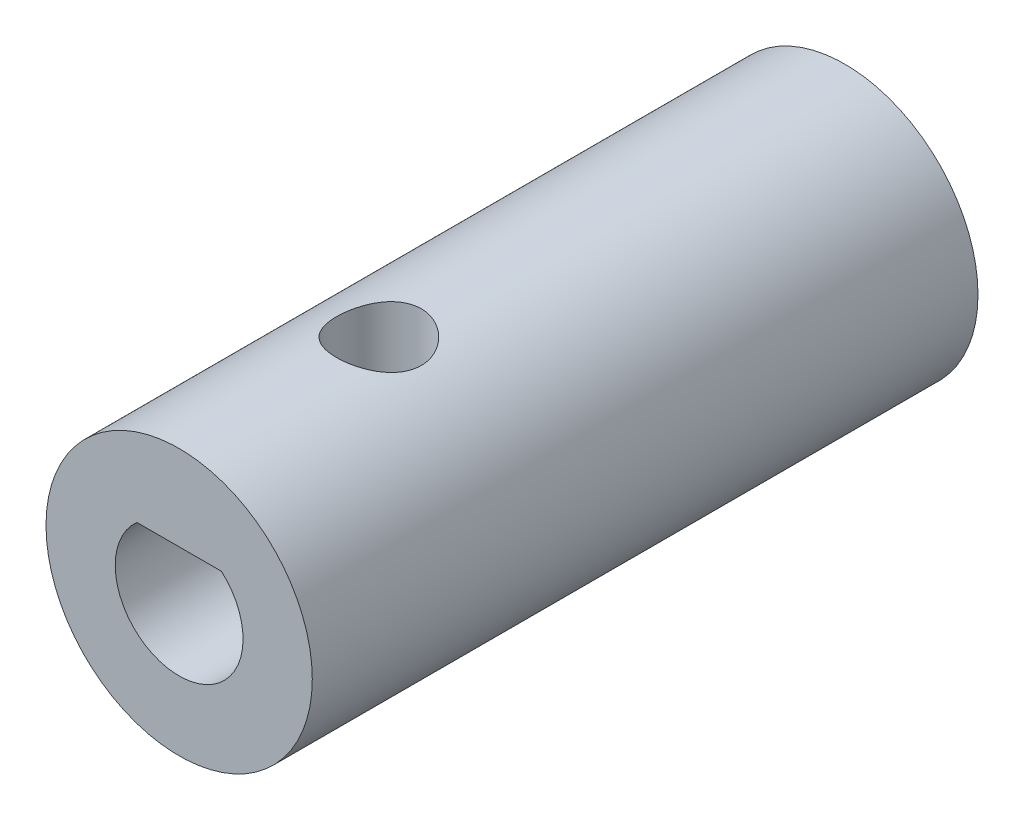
ISO-10303-21;
HEADER;
FILE_DESCRIPTION(('STEP AP214'),'2;1');
FILE_NAME('part.step','',(''),(''),'','','');
FILE_SCHEMA(('AUTOMOTIVE_DESIGN { 1 0 10303 214 1 1 1 1 }'));
ENDSEC;
DATA;
#1=APPLICATION_CONTEXT('core data for automotive mechanical design processes');
#2=APPLICATION_PROTOCOL_DEFINITION('international standard','automotive_design',2000,#1);
#3=PRODUCT_CONTEXT('',#1,'mechanical');
#4=PRODUCT('Part','Part','',(#3));
#5=PRODUCT_RELATED_PRODUCT_CATEGORY('part','',(#4));
#6=PRODUCT_DEFINITION_FORMATION('','',#4);
#7=PRODUCT_DEFINITION_CONTEXT('part definition',#1,'design');
#8=PRODUCT_DEFINITION('design','',#6,#7);
#9=PRODUCT_DEFINITION_SHAPE('','',#8);
#10=(LENGTH_UNIT() NAMED_UNIT(*) SI_UNIT(.MILLI.,.METRE.));
#11=(NAMED_UNIT(*) PLANE_ANGLE_UNIT() SI_UNIT($,.RADIAN.));
#12=(NAMED_UNIT(*) SI_UNIT($,.STERADIAN.) SOLID_ANGLE_UNIT());
#13=UNCERTAINTY_MEASURE_WITH_UNIT(LENGTH_MEASURE(1.E-05),#10,'distance_accuracy_value','');
#14=(GEOMETRIC_REPRESENTATION_CONTEXT(3) GLOBAL_UNCERTAINTY_ASSIGNED_CONTEXT((#13)) GLOBAL_UNIT_ASSIGNED_CONTEXT((#10,
#11,#12)) REPRESENTATION_CONTEXT('',''));
#15=CARTESIAN_POINT('',(0.,0.,0.));
#16=DIRECTION('',(0.,0.,1.));
#17=DIRECTION('',(1.,0.,0.));
#18=AXIS2_PLACEMENT_3D('',#15,#16,#17);
#19=CARTESIAN_POINT('',(0.,0.,0.));
#20=DIRECTION('',(0.,0.,1.));
#21=DIRECTION('',(1.,0.,0.));
#22=AXIS2_PLACEMENT_3D('',#19,#20,#21);
#23=PLANE('',#22);
#24=CARTESIAN_POINT('',(0.,0.,0.));
#25=DIRECTION('',(0.,0.,-1.));
#26=DIRECTION('',(-1.,0.,0.));
#27=AXIS2_PLACEMENT_3D('',#24,#25,#26);
#28=CIRCLE('',#27,4.);
#29=CARTESIAN_POINT('',(4.,0.,0.));
#30=VERTEX_POINT('',#29);
#31=CARTESIAN_POINT('',(0.,4.,0.));
#32=VERTEX_POINT('',#31);
#33=EDGE_CURVE('E241',#30,#32,#28,.T.);
#34=ORIENTED_EDGE('',*,*,#33,.F.);
#35=DIRECTION('',(1.,0.,0.));
#36=VECTOR('',#35,1.);
#37=CARTESIAN_POINT('',(4.5,0.,0.));
#38=LINE('',#37,#36);
#39=CARTESIAN_POINT('',(3.5,0.,0.));
#40=VERTEX_POINT('',#39);
#41=EDGE_CURVE('E122',#40,#30,#38,.T.);
#42=ORIENTED_EDGE('',*,*,#41,.F.);
#43=CARTESIAN_POINT('',(3.5,0.,0.));
#44=CARTESIAN_POINT('',(3.50000073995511,0.0845187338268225,0.));
#45=CARTESIAN_POINT('',(3.49693751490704,0.169010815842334,0.));
#46=CARTESIAN_POINT('',(3.48471022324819,0.337541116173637,0.));
#47=CARTESIAN_POINT('',(3.47554696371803,0.42157939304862,0.));
#48=CARTESIAN_POINT('',(3.43895200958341,0.672408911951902,0.));
#49=CARTESIAN_POINT('',(3.40241511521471,0.837953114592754,0.));
#50=CARTESIAN_POINT('',(3.29788002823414,1.18857371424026,0.));
#51=CARTESIAN_POINT('',(3.22571075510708,1.3724113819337,0.));
#52=CARTESIAN_POINT('',(3.05152827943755,1.72537332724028,0.));
#53=CARTESIAN_POINT('',(2.94951173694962,1.89449595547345,0.));
#54=CARTESIAN_POINT('',(2.71853993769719,2.21320293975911,0.));
#55=CARTESIAN_POINT('',(2.5895866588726,2.36278872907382,0.));
#56=CARTESIAN_POINT('',(2.30839102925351,2.63819263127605,0.));
#57=CARTESIAN_POINT('',(2.15614786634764,2.76400991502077,0.));
#58=CARTESIAN_POINT('',(1.83268849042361,2.98831001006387,0.));
#59=CARTESIAN_POINT('',(1.66147025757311,3.08678990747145,0.));
#60=CARTESIAN_POINT('',(1.30494852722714,3.25358544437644,0.));
#61=CARTESIAN_POINT('',(1.11964853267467,3.32190855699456,0.));
#62=CARTESIAN_POINT('',(0.778633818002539,3.41590244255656,0.));
#63=CARTESIAN_POINT('',(0.624508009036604,3.44740251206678,0.));
#64=CARTESIAN_POINT('',(0.391336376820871,3.47893851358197,0.));
#65=CARTESIAN_POINT('',(0.313292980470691,3.48683149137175,0.));
#66=CARTESIAN_POINT('',(0.15683970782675,3.49736318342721,0.));
#67=CARTESIAN_POINT('',(0.0784297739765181,3.50000104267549,0.));
#68=CARTESIAN_POINT('',(0.,3.5,0.));
#69=B_SPLINE_CURVE_WITH_KNOTS('',3,(#43,#44,#45,#46,#47,#48,#49,#50,#51,#52,#53,#54,#55,#56,#57,
#58,#59,#60,#61,#62,#63,#64,#65,#66,#67,#68),.UNSPECIFIED.,.F.,.F.,(4,2,2,2,2,2,2,2,2,2,2,2,4),
(0.,0.253447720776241,0.506861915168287,1.01357658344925,1.60323967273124,2.19296877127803,
2.78265458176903,3.37236095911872,3.96213016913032,4.55175314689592,5.02221818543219,
5.25738544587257,5.4925909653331),.UNSPECIFIED.);
#70=CARTESIAN_POINT('',(0.,3.5,0.));
#71=VERTEX_POINT('',#70);
#72=EDGE_CURVE('E118',#40,#71,#69,.T.);
#73=ORIENTED_EDGE('',*,*,#72,.T.);
#74=CARTESIAN_POINT('',(0.,3.5,0.));
#75=CARTESIAN_POINT('',(0.,3.58762185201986,0.));
#76=CARTESIAN_POINT('',(0.,3.67524370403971,0.));
#77=CARTESIAN_POINT('',(0.,3.85048740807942,0.));
#78=CARTESIAN_POINT('',(0.,3.93810926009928,0.));
#79=CARTESIAN_POINT('',(0.,4.18382074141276,0.));
#80=CARTESIAN_POINT('',(0.,4.34191037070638,0.));
#81=CARTESIAN_POINT('',(0.,4.5,0.));
#82=B_SPLINE_CURVE_WITH_KNOTS('',3,(#74,#75,#76,#77,#78,#79,#80,#81),.UNSPECIFIED.,.F.,.F.,(4,2,
2,4),(0.,0.262865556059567,0.525731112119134,1.),.UNSPECIFIED.);
#83=EDGE_CURVE('E12',#71,#32,#82,.T.);
#84=ORIENTED_EDGE('',*,*,#83,.T.);
#85=EDGE_LOOP('',(#34,#42,#73,#84));
#86=FACE_BOUND('',#85,.T.);
#87=CARTESIAN_POINT('',(0.,0.,0.));
#88=DIRECTION('',(0.,0.,1.));
#89=DIRECTION('',(1.,0.,0.));
#90=AXIS2_PLACEMENT_3D('',#87,#88,#89);
#91=CIRCLE('',#90,6.35);
#92=CARTESIAN_POINT('',(6.35,0.,0.));
#93=VERTEX_POINT('',#92);
#94=EDGE_CURVE('E291',#93,#93,#91,.T.);
#95=ORIENTED_EDGE('',*,*,#94,.F.);
#96=EDGE_LOOP('',(#95));
#97=FACE_BOUND('',#96,.T.);
#98=ADVANCED_FACE('F41',(#86,#97),#23,.F.);
#99=CARTESIAN_POINT('',(0.,0.,24.0137084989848));
#100=DIRECTION('',(0.,0.,-1.));
#101=DIRECTION('',(-1.,0.,0.));
#102=AXIS2_PLACEMENT_3D('',#99,#100,#101);
#103=CYLINDRICAL_SURFACE('',#102,4.);
#104=DIRECTION('',(0.,0.,-1.));
#105=VECTOR('',#104,1.);
#106=CARTESIAN_POINT('',(4.,0.,24.0137084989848));
#107=LINE('',#106,#105);
#108=CARTESIAN_POINT('',(4.,0.,0.5));
#109=VERTEX_POINT('',#108);
#110=EDGE_CURVE('E240',#30,#109,#107,.F.);
#111=ORIENTED_EDGE('',*,*,#110,.F.);
#112=ORIENTED_EDGE('',*,*,#33,.T.);
#113=CARTESIAN_POINT('',(4.,0.,-0.5));
#114=CARTESIAN_POINT('',(4.,1.29967878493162,-0.4));
#115=CARTESIAN_POINT('',(3.23606797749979,2.35114100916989,-0.3));
#116=CARTESIAN_POINT('',(2.47213595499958,3.40260323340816,-0.2));
#117=CARTESIAN_POINT('',(1.23606797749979,3.80422606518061,-0.1));
#118=CARTESIAN_POINT('',(0.,4.20584889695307,0.));
#119=CARTESIAN_POINT('',(-1.23606797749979,3.80422606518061,0.0999999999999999));
#120=CARTESIAN_POINT('',(-2.47213595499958,3.40260323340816,0.2));
#121=CARTESIAN_POINT('',(-3.23606797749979,2.35114100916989,0.3));
#122=CARTESIAN_POINT('',(-4.,1.29967878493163,0.4));
#123=CARTESIAN_POINT('',(-4.,0.,0.5));
#124=CARTESIAN_POINT('',(-4.,-1.29967878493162,0.6));
#125=CARTESIAN_POINT('',(-3.23606797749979,-2.35114100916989,0.7));
#126=CARTESIAN_POINT('',(-2.47213595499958,-3.40260323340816,0.8));
#127=CARTESIAN_POINT('',(-1.23606797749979,-3.80422606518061,0.9));
#128=CARTESIAN_POINT('',(0.,-4.20584889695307,1.));
#129=CARTESIAN_POINT('',(1.23606797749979,-3.80422606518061,1.1));
#130=CARTESIAN_POINT('',(2.47213595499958,-3.40260323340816,1.2));
#131=CARTESIAN_POINT('',(3.23606797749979,-2.35114100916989,1.3));
#132=CARTESIAN_POINT('',(4.,-1.29967878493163,1.4));
#133=CARTESIAN_POINT('',(4.,0.,1.5));
#134=CARTESIAN_POINT('',(4.,1.29967878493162,1.6));
#135=CARTESIAN_POINT('',(3.23606797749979,2.35114100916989,1.7));
#136=CARTESIAN_POINT('',(2.47213595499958,3.40260323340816,1.8));
#137=CARTESIAN_POINT('',(1.23606797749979,3.80422606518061,1.9));
#138=CARTESIAN_POINT('',(0.,4.20584889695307,2.));
#139=CARTESIAN_POINT('',(-1.23606797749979,3.80422606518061,2.1));
#140=CARTESIAN_POINT('',(-2.47213595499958,3.40260323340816,2.2));
#141=CARTESIAN_POINT('',(-3.23606797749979,2.35114100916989,2.3));
#142=CARTESIAN_POINT('',(-4.,1.29967878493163,2.4));
#143=CARTESIAN_POINT('',(-4.,0.,2.5));
#144=CARTESIAN_POINT('',(-4.,-1.29967878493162,2.6));
#145=CARTESIAN_POINT('',(-3.23606797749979,-2.35114100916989,2.7));
#146=CARTESIAN_POINT('',(-2.47213595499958,-3.40260323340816,2.8));
#147=CARTESIAN_POINT('',(-1.23606797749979,-3.80422606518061,2.9));
#148=CARTESIAN_POINT('',(0.,-4.20584889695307,3.));
#149=CARTESIAN_POINT('',(1.23606797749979,-3.80422606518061,3.1));
#150=CARTESIAN_POINT('',(2.47213595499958,-3.40260323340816,3.2));
#151=CARTESIAN_POINT('',(3.23606797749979,-2.35114100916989,3.3));
#152=CARTESIAN_POINT('',(4.,-1.29967878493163,3.4));
#153=CARTESIAN_POINT('',(4.,0.,3.5));
#154=CARTESIAN_POINT('',(4.,1.29967878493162,3.6));
#155=CARTESIAN_POINT('',(3.23606797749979,2.35114100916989,3.7));
#156=CARTESIAN_POINT('',(2.47213595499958,3.40260323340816,3.8));
#157=CARTESIAN_POINT('',(1.23606797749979,3.80422606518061,3.9));
#158=CARTESIAN_POINT('',(0.,4.20584889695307,4.));
#159=CARTESIAN_POINT('',(-1.23606797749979,3.80422606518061,4.1));
#160=CARTESIAN_POINT('',(-2.47213595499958,3.40260323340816,4.2));
#161=CARTESIAN_POINT('',(-3.23606797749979,2.35114100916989,4.3));
#162=CARTESIAN_POINT('',(-4.,1.29967878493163,4.4));
#163=CARTESIAN_POINT('',(-4.,0.,4.5));
#164=CARTESIAN_POINT('',(-4.,-1.29967878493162,4.6));
#165=CARTESIAN_POINT('',(-3.23606797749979,-2.35114100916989,4.7));
#166=CARTESIAN_POINT('',(-2.47213595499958,-3.40260323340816,4.8));
#167=CARTESIAN_POINT('',(-1.23606797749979,-3.80422606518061,4.9));
#168=CARTESIAN_POINT('',(0.,-4.20584889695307,5.));
#169=CARTESIAN_POINT('',(1.23606797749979,-3.80422606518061,5.1));
#170=CARTESIAN_POINT('',(2.47213595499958,-3.40260323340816,5.2));
#171=CARTESIAN_POINT('',(3.23606797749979,-2.35114100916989,5.3));
#172=CARTESIAN_POINT('',(4.,-1.29967878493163,5.4));
#173=CARTESIAN_POINT('',(4.,0.,5.5));
#174=CARTESIAN_POINT('',(4.,1.29967878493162,5.6));
#175=CARTESIAN_POINT('',(3.23606797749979,2.35114100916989,5.7));
#176=CARTESIAN_POINT('',(2.47213595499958,3.40260323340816,5.8));
#177=CARTESIAN_POINT('',(1.23606797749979,3.80422606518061,5.9));
#178=CARTESIAN_POINT('',(0.,4.20584889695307,6.));
#179=CARTESIAN_POINT('',(-1.23606797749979,3.80422606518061,6.1));
#180=CARTESIAN_POINT('',(-2.47213595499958,3.40260323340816,6.2));
#181=CARTESIAN_POINT('',(-3.23606797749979,2.35114100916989,6.3));
#182=CARTESIAN_POINT('',(-4.,1.29967878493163,6.4));
#183=CARTESIAN_POINT('',(-4.,0.,6.5));
#184=CARTESIAN_POINT('',(-4.,-1.29967878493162,6.6));
#185=CARTESIAN_POINT('',(-3.23606797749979,-2.35114100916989,6.7));
#186=CARTESIAN_POINT('',(-2.47213595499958,-3.40260323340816,6.8));
#187=CARTESIAN_POINT('',(-1.23606797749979,-3.80422606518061,6.9));
#188=CARTESIAN_POINT('',(0.,-4.20584889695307,7.));
#189=CARTESIAN_POINT('',(1.23606797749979,-3.80422606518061,7.1));
#190=CARTESIAN_POINT('',(2.47213595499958,-3.40260323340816,7.2));
#191=CARTESIAN_POINT('',(3.23606797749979,-2.35114100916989,7.3));
#192=CARTESIAN_POINT('',(4.,-1.29967878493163,7.4));
#193=CARTESIAN_POINT('',(4.,0.,7.5));
#194=CARTESIAN_POINT('',(4.,1.29967878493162,7.6));
#195=CARTESIAN_POINT('',(3.23606797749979,2.35114100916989,7.7));
#196=CARTESIAN_POINT('',(2.47213595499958,3.40260323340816,7.8));
#197=CARTESIAN_POINT('',(1.23606797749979,3.80422606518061,7.9));
#198=CARTESIAN_POINT('',(0.,4.20584889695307,8.));
#199=CARTESIAN_POINT('',(-1.23606797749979,3.80422606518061,8.1));
#200=CARTESIAN_POINT('',(-2.47213595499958,3.40260323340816,8.2));
#201=CARTESIAN_POINT('',(-3.23606797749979,2.35114100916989,8.3));
#202=CARTESIAN_POINT('',(-4.,1.29967878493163,8.4));
#203=CARTESIAN_POINT('',(-4.,0.,8.5));
#204=CARTESIAN_POINT('',(-4.,-1.29967878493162,8.6));
#205=CARTESIAN_POINT('',(-3.23606797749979,-2.35114100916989,8.7));
#206=CARTESIAN_POINT('',(-2.47213595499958,-3.40260323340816,8.8));
#207=CARTESIAN_POINT('',(-1.23606797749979,-3.80422606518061,8.9));
#208=CARTESIAN_POINT('',(0.,-4.20584889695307,9.));
#209=CARTESIAN_POINT('',(1.23606797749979,-3.80422606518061,9.1));
#210=CARTESIAN_POINT('',(2.47213595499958,-3.40260323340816,9.2));
#211=CARTESIAN_POINT('',(3.23606797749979,-2.35114100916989,9.3));
#212=CARTESIAN_POINT('',(4.,-1.29967878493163,9.4));
#213=CARTESIAN_POINT('',(4.,0.,9.5));
#214=CARTESIAN_POINT('',(4.,1.29967878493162,9.6));
#215=CARTESIAN_POINT('',(3.23606797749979,2.35114100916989,9.7));
#216=CARTESIAN_POINT('',(2.47213595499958,3.40260323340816,9.8));
#217=CARTESIAN_POINT('',(1.23606797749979,3.80422606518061,9.9));
#218=CARTESIAN_POINT('',(0.,4.20584889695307,10.));
#219=CARTESIAN_POINT('',(-1.23606797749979,3.80422606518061,10.1));
#220=CARTESIAN_POINT('',(-2.47213595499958,3.40260323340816,10.2));
#221=CARTESIAN_POINT('',(-3.23606797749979,2.35114100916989,10.3));
#222=CARTESIAN_POINT('',(-4.,1.29967878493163,10.4));
#223=CARTESIAN_POINT('',(-4.,0.,10.5));
#224=CARTESIAN_POINT('',(-4.,-1.29967878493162,10.6));
#225=CARTESIAN_POINT('',(-3.23606797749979,-2.35114100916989,10.7));
#226=CARTESIAN_POINT('',(-2.47213595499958,-3.40260323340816,10.8));
#227=CARTESIAN_POINT('',(-1.23606797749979,-3.80422606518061,10.9));
#228=CARTESIAN_POINT('',(0.,-4.20584889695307,11.));
#229=CARTESIAN_POINT('',(1.23606797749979,-3.80422606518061,11.1));
#230=CARTESIAN_POINT('',(2.47213595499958,-3.40260323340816,11.2));
#231=CARTESIAN_POINT('',(3.23606797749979,-2.35114100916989,11.3));
#232=CARTESIAN_POINT('',(4.,-1.29967878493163,11.4));
#233=CARTESIAN_POINT('',(4.,0.,11.5));
#234=CARTESIAN_POINT('',(4.,1.29967878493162,11.6));
#235=CARTESIAN_POINT('',(3.23606797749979,2.35114100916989,11.7));
#236=CARTESIAN_POINT('',(2.47213595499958,3.40260323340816,11.8));
#237=CARTESIAN_POINT('',(1.23606797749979,3.80422606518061,11.9));
#238=CARTESIAN_POINT('',(0.,4.20584889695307,12.));
#239=CARTESIAN_POINT('',(-1.23606797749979,3.80422606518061,12.1));
#240=CARTESIAN_POINT('',(-2.47213595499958,3.40260323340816,12.2));
#241=CARTESIAN_POINT('',(-3.23606797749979,2.35114100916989,12.3));
#242=CARTESIAN_POINT('',(-4.,1.29967878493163,12.4));
#243=CARTESIAN_POINT('',(-4.,0.,12.5));
#244=CARTESIAN_POINT('',(-4.,-1.29967878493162,12.6));
#245=CARTESIAN_POINT('',(-3.23606797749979,-2.35114100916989,12.7));
#246=CARTESIAN_POINT('',(-2.47213595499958,-3.40260323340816,12.8));
#247=CARTESIAN_POINT('',(-1.23606797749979,-3.80422606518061,12.9));
#248=CARTESIAN_POINT('',(0.,-4.20584889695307,13.));
#249=CARTESIAN_POINT('',(1.23606797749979,-3.80422606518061,13.1));
#250=CARTESIAN_POINT('',(2.47213595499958,-3.40260323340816,13.2));
#251=CARTESIAN_POINT('',(3.23606797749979,-2.35114100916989,13.3));
#252=CARTESIAN_POINT('',(4.,-1.29967878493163,13.4));
#253=CARTESIAN_POINT('',(4.,0.,13.5));
#254=CARTESIAN_POINT('',(4.,1.29967878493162,13.6));
#255=CARTESIAN_POINT('',(3.23606797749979,2.35114100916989,13.7));
#256=CARTESIAN_POINT('',(2.47213595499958,3.40260323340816,13.8));
#257=CARTESIAN_POINT('',(1.23606797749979,3.80422606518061,13.9));
#258=CARTESIAN_POINT('',(0.,4.20584889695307,14.));
#259=CARTESIAN_POINT('',(-1.23606797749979,3.80422606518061,14.1));
#260=CARTESIAN_POINT('',(-2.47213595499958,3.40260323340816,14.2));
#261=CARTESIAN_POINT('',(-3.23606797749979,2.35114100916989,14.3));
#262=CARTESIAN_POINT('',(-4.,1.29967878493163,14.4));
#263=CARTESIAN_POINT('',(-4.,0.,14.5));
#264=(BOUNDED_CURVE() B_SPLINE_CURVE(2,(#113,#114,#115,#116,#117,#118,#119,#120,#121,#122,#123,
#124,#125,#126,#127,#128,#129,#130,#131,#132,#133,#134,#135,#136,#137,#138,#139,#140,#141,#142,
#143,#144,#145,#146,#147,#148,#149,#150,#151,#152,#153,#154,#155,#156,#157,#158,#159,#160,#161,
#162,#163,#164,#165,#166,#167,#168,#169,#170,#171,#172,#173,#174,#175,#176,#177,#178,#179,#180,
#181,#182,#183,#184,#185,#186,#187,#188,#189,#190,#191,#192,#193,#194,#195,#196,#197,#198,#199,
#200,#201,#202,#203,#204,#205,#206,#207,#208,#209,#210,#211,#212,#213,#214,#215,#216,#217,#218,
#219,#220,#221,#222,#223,#224,#225,#226,#227,#228,#229,#230,#231,#232,#233,#234,#235,#236,#237,
#238,#239,#240,#241,#242,#243,#244,#245,#246,#247,#248,#249,#250,#251,#252,#253,#254,#255,#256,
#257,#258,#259,#260,#261,#262,#263),.UNSPECIFIED.,.F.,.F.) B_SPLINE_CURVE_WITH_KNOTS((3,2,2,2,2,
2,2,2,2,2,2,2,2,2,2,2,2,2,2,2,2,2,2,2,2,2,2,2,2,2,2,2,2,2,2,2,2,2,2,2,2,2,2,2,2,2,2,2,2,2,2,2,2,
2,2,2,2,2,2,2,2,2,2,2,2,2,2,2,2,2,2,2,2,2,2,3),(0.,0.0125,0.025,0.0375,0.05,0.0625,0.075,0.0875,
0.1,0.1125,0.125,0.1375,0.15,0.1625,0.175,0.1875,0.2,0.2125,0.225,0.2375,0.25,0.2625,0.275,
0.2875,0.3,0.3125,0.325,0.3375,0.35,0.3625,0.375,0.3875,0.4,0.4125,0.425,0.4375,0.45,0.4625,
0.475,0.4875,0.5,0.5125,0.525,0.5375,0.55,0.5625,0.575,0.5875,0.6,0.6125,0.625,0.6375,0.65,
0.6625,0.675,0.6875,0.7,0.7125,0.725,0.7375,0.75,0.7625,0.775,0.7875,0.8,0.8125,0.825,0.8375,
0.85,0.8625,0.875,0.8875,0.9,0.9125,0.925,0.9375),
.UNSPECIFIED.) CURVE() GEOMETRIC_REPRESENTATION_ITEM() RATIONAL_B_SPLINE_CURVE((1.,
0.951056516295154,1.,0.951056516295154,1.,0.951056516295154,1.,0.951056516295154,1.,
0.951056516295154,1.,0.951056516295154,1.,0.951056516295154,1.,0.951056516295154,1.,
0.951056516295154,1.,0.951056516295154,1.,0.951056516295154,1.,0.951056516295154,1.,
0.951056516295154,1.,0.951056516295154,1.,0.951056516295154,1.,0.951056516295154,1.,
0.951056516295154,1.,0.951056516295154,1.,0.951056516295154,1.,0.951056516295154,1.,
0.951056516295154,1.,0.951056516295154,1.,0.951056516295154,1.,0.951056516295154,1.,
0.951056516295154,1.,0.951056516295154,1.,0.951056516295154,1.,0.951056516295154,1.,
0.951056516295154,1.,0.951056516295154,1.,0.951056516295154,1.,0.951056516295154,1.,
0.951056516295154,1.,0.951056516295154,1.,0.951056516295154,1.,0.951056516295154,1.,
0.951056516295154,1.,0.951056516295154,1.,0.951056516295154,1.,0.951056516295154,1.,
0.951056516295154,1.,0.951056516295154,1.,0.951056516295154,1.,0.951056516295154,1.,
0.951056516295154,1.,0.951056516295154,1.,0.951056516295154,1.,0.951056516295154,1.,
0.951056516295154,1.,0.951056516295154,1.,0.951056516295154,1.,0.951056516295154,1.,
0.951056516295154,1.,0.951056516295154,1.,0.951056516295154,1.,0.951056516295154,1.,
0.951056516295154,1.,0.951056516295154,1.,0.951056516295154,1.,0.951056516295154,1.,
0.951056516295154,1.,0.951056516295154,1.,0.951056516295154,1.,0.951056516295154,1.,
0.951056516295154,1.,0.951056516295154,1.,0.951056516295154,1.,0.951056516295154,1.,
0.951056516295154,1.,0.951056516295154,1.,0.951056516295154,1.,0.951056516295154,1.,
0.951056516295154,1.,0.951056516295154,1.,0.951056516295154,1.)) REPRESENTATION_ITEM(''));
#265=CARTESIAN_POINT('',(-3.23606797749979,-2.35114100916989,12.7));
#266=VERTEX_POINT('',#265);
#267=EDGE_CURVE('E130',#32,#266,#264,.T.);
#268=ORIENTED_EDGE('',*,*,#267,.T.);
#269=CARTESIAN_POINT('',(0.,0.,12.7));
#270=DIRECTION('',(0.,0.,1.));
#271=DIRECTION('',(1.,0.,0.));
#272=AXIS2_PLACEMENT_3D('',#269,#270,#271);
#273=CIRCLE('',#272,4.);
#274=CARTESIAN_POINT('',(3.23606797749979,2.35114100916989,12.7));
#275=VERTEX_POINT('',#274);
#276=EDGE_CURVE('E245',#275,#266,#273,.F.);
#277=ORIENTED_EDGE('',*,*,#276,.F.);
#278=CARTESIAN_POINT('',(4.,0.,0.5));
#279=CARTESIAN_POINT('',(4.,1.29967878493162,0.6));
#280=CARTESIAN_POINT('',(3.23606797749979,2.35114100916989,0.7));
#281=CARTESIAN_POINT('',(2.47213595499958,3.40260323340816,0.8));
#282=CARTESIAN_POINT('',(1.23606797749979,3.80422606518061,0.9));
#283=CARTESIAN_POINT('',(0.,4.20584889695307,1.));
#284=CARTESIAN_POINT('',(-1.23606797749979,3.80422606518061,1.1));
#285=CARTESIAN_POINT('',(-2.47213595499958,3.40260323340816,1.2));
#286=CARTESIAN_POINT('',(-3.23606797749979,2.35114100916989,1.3));
#287=CARTESIAN_POINT('',(-4.,1.29967878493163,1.4));
#288=CARTESIAN_POINT('',(-4.,0.,1.5));
#289=CARTESIAN_POINT('',(-4.,-1.29967878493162,1.6));
#290=CARTESIAN_POINT('',(-3.23606797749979,-2.35114100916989,1.7));
#291=CARTESIAN_POINT('',(-2.47213595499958,-3.40260323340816,1.8));
#292=CARTESIAN_POINT('',(-1.23606797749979,-3.80422606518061,1.9));
#293=CARTESIAN_POINT('',(0.,-4.20584889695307,2.));
#294=CARTESIAN_POINT('',(1.23606797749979,-3.80422606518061,2.1));
#295=CARTESIAN_POINT('',(2.47213595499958,-3.40260323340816,2.2));
#296=CARTESIAN_POINT('',(3.23606797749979,-2.35114100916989,2.3));
#297=CARTESIAN_POINT('',(4.,-1.29967878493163,2.4));
#298=CARTESIAN_POINT('',(4.,0.,2.5));
#299=CARTESIAN_POINT('',(4.,1.29967878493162,2.6));
#300=CARTESIAN_POINT('',(3.23606797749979,2.35114100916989,2.7));
#301=CARTESIAN_POINT('',(2.47213595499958,3.40260323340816,2.8));
#302=CARTESIAN_POINT('',(1.23606797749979,3.80422606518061,2.9));
#303=CARTESIAN_POINT('',(0.,4.20584889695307,3.));
#304=CARTESIAN_POINT('',(-1.23606797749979,3.80422606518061,3.1));
#305=CARTESIAN_POINT('',(-2.47213595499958,3.40260323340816,3.2));
#306=CARTESIAN_POINT('',(-3.23606797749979,2.35114100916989,3.3));
#307=CARTESIAN_POINT('',(-4.,1.29967878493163,3.4));
#308=CARTESIAN_POINT('',(-4.,0.,3.5));
#309=CARTESIAN_POINT('',(-4.,-1.29967878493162,3.6));
#310=CARTESIAN_POINT('',(-3.23606797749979,-2.35114100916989,3.7));
#311=CARTESIAN_POINT('',(-2.47213595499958,-3.40260323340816,3.8));
#312=CARTESIAN_POINT('',(-1.23606797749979,-3.80422606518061,3.9));
#313=CARTESIAN_POINT('',(0.,-4.20584889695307,4.));
#314=CARTESIAN_POINT('',(1.23606797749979,-3.80422606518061,4.1));
#315=CARTESIAN_POINT('',(2.47213595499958,-3.40260323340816,4.2));
#316=CARTESIAN_POINT('',(3.23606797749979,-2.35114100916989,4.3));
#317=CARTESIAN_POINT('',(4.,-1.29967878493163,4.4));
#318=CARTESIAN_POINT('',(4.,0.,4.5));
#319=CARTESIAN_POINT('',(4.,1.29967878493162,4.6));
#320=CARTESIAN_POINT('',(3.23606797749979,2.35114100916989,4.7));
#321=CARTESIAN_POINT('',(2.47213595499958,3.40260323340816,4.8));
#322=CARTESIAN_POINT('',(1.23606797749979,3.80422606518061,4.9));
#323=CARTESIAN_POINT('',(0.,4.20584889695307,5.));
#324=CARTESIAN_POINT('',(-1.23606797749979,3.80422606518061,5.1));
#325=CARTESIAN_POINT('',(-2.47213595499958,3.40260323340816,5.2));
#326=CARTESIAN_POINT('',(-3.23606797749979,2.35114100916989,5.3));
#327=CARTESIAN_POINT('',(-4.,1.29967878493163,5.4));
#328=CARTESIAN_POINT('',(-4.,0.,5.5));
#329=CARTESIAN_POINT('',(-4.,-1.29967878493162,5.6));
#330=CARTESIAN_POINT('',(-3.23606797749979,-2.35114100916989,5.7));
#331=CARTESIAN_POINT('',(-2.47213595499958,-3.40260323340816,5.8));
#332=CARTESIAN_POINT('',(-1.23606797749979,-3.80422606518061,5.9));
#333=CARTESIAN_POINT('',(0.,-4.20584889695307,6.));
#334=CARTESIAN_POINT('',(1.23606797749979,-3.80422606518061,6.1));
#335=CARTESIAN_POINT('',(2.47213595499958,-3.40260323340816,6.2));
#336=CARTESIAN_POINT('',(3.23606797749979,-2.35114100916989,6.3));
#337=CARTESIAN_POINT('',(4.,-1.29967878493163,6.4));
#338=CARTESIAN_POINT('',(4.,0.,6.5));
#339=CARTESIAN_POINT('',(4.,1.29967878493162,6.6));
#340=CARTESIAN_POINT('',(3.23606797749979,2.35114100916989,6.7));
#341=CARTESIAN_POINT('',(2.47213595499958,3.40260323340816,6.8));
#342=CARTESIAN_POINT('',(1.23606797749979,3.80422606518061,6.9));
#343=CARTESIAN_POINT('',(0.,4.20584889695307,7.));
#344=CARTESIAN_POINT('',(-1.23606797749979,3.80422606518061,7.1));
#345=CARTESIAN_POINT('',(-2.47213595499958,3.40260323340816,7.2));
#346=CARTESIAN_POINT('',(-3.23606797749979,2.35114100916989,7.3));
#347=CARTESIAN_POINT('',(-4.,1.29967878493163,7.4));
#348=CARTESIAN_POINT('',(-4.,0.,7.5));
#349=CARTESIAN_POINT('',(-4.,-1.29967878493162,7.6));
#350=CARTESIAN_POINT('',(-3.23606797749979,-2.35114100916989,7.7));
#351=CARTESIAN_POINT('',(-2.47213595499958,-3.40260323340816,7.8));
#352=CARTESIAN_POINT('',(-1.23606797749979,-3.80422606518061,7.9));
#353=CARTESIAN_POINT('',(0.,-4.20584889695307,8.));
#354=CARTESIAN_POINT('',(1.23606797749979,-3.80422606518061,8.1));
#355=CARTESIAN_POINT('',(2.47213595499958,-3.40260323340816,8.2));
#356=CARTESIAN_POINT('',(3.23606797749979,-2.35114100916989,8.3));
#357=CARTESIAN_POINT('',(4.,-1.29967878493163,8.4));
#358=CARTESIAN_POINT('',(4.,0.,8.5));
#359=CARTESIAN_POINT('',(4.,1.29967878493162,8.6));
#360=CARTESIAN_POINT('',(3.23606797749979,2.35114100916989,8.7));
#361=CARTESIAN_POINT('',(2.47213595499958,3.40260323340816,8.8));
#362=CARTESIAN_POINT('',(1.23606797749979,3.80422606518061,8.9));
#363=CARTESIAN_POINT('',(0.,4.20584889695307,9.));
#364=CARTESIAN_POINT('',(-1.23606797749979,3.80422606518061,9.1));
#365=CARTESIAN_POINT('',(-2.47213595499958,3.40260323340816,9.2));
#366=CARTESIAN_POINT('',(-3.23606797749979,2.35114100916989,9.3));
#367=CARTESIAN_POINT('',(-4.,1.29967878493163,9.4));
#368=CARTESIAN_POINT('',(-4.,0.,9.5));
#369=CARTESIAN_POINT('',(-4.,-1.29967878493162,9.6));
#370=CARTESIAN_POINT('',(-3.23606797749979,-2.35114100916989,9.7));
#371=CARTESIAN_POINT('',(-2.47213595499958,-3.40260323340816,9.8));
#372=CARTESIAN_POINT('',(-1.23606797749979,-3.80422606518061,9.9));
#373=CARTESIAN_POINT('',(0.,-4.20584889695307,10.));
#374=CARTESIAN_POINT('',(1.23606797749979,-3.80422606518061,10.1));
#375=CARTESIAN_POINT('',(2.47213595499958,-3.40260323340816,10.2));
#376=CARTESIAN_POINT('',(3.23606797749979,-2.35114100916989,10.3));
#377=CARTESIAN_POINT('',(4.,-1.29967878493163,10.4));
#378=CARTESIAN_POINT('',(4.,0.,10.5));
#379=CARTESIAN_POINT('',(4.,1.29967878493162,10.6));
#380=CARTESIAN_POINT('',(3.23606797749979,2.35114100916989,10.7));
#381=CARTESIAN_POINT('',(2.47213595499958,3.40260323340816,10.8));
#382=CARTESIAN_POINT('',(1.23606797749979,3.80422606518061,10.9));
#383=CARTESIAN_POINT('',(0.,4.20584889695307,11.));
#384=CARTESIAN_POINT('',(-1.23606797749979,3.80422606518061,11.1));
#385=CARTESIAN_POINT('',(-2.47213595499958,3.40260323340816,11.2));
#386=CARTESIAN_POINT('',(-3.23606797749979,2.35114100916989,11.3));
#387=CARTESIAN_POINT('',(-4.,1.29967878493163,11.4));
#388=CARTESIAN_POINT('',(-4.,0.,11.5));
#389=CARTESIAN_POINT('',(-4.,-1.29967878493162,11.6));
#390=CARTESIAN_POINT('',(-3.23606797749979,-2.35114100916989,11.7));
#391=CARTESIAN_POINT('',(-2.47213595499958,-3.40260323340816,11.8));
#392=CARTESIAN_POINT('',(-1.23606797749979,-3.80422606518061,11.9));
#393=CARTESIAN_POINT('',(0.,-4.20584889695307,12.));
#394=CARTESIAN_POINT('',(1.23606797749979,-3.80422606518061,12.1));
#395=CARTESIAN_POINT('',(2.47213595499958,-3.40260323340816,12.2));
#396=CARTESIAN_POINT('',(3.23606797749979,-2.35114100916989,12.3));
#397=CARTESIAN_POINT('',(4.,-1.29967878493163,12.4));
#398=CARTESIAN_POINT('',(4.,0.,12.5));
#399=CARTESIAN_POINT('',(4.,1.29967878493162,12.6));
#400=CARTESIAN_POINT('',(3.23606797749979,2.35114100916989,12.7));
#401=CARTESIAN_POINT('',(2.47213595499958,3.40260323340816,12.8));
#402=CARTESIAN_POINT('',(1.23606797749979,3.80422606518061,12.9));
#403=CARTESIAN_POINT('',(0.,4.20584889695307,13.));
#404=CARTESIAN_POINT('',(-1.23606797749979,3.80422606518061,13.1));
#405=CARTESIAN_POINT('',(-2.47213595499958,3.40260323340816,13.2));
#406=CARTESIAN_POINT('',(-3.23606797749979,2.35114100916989,13.3));
#407=CARTESIAN_POINT('',(-4.,1.29967878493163,13.4));
#408=CARTESIAN_POINT('',(-4.,0.,13.5));
#409=CARTESIAN_POINT('',(-4.,-1.29967878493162,13.6));
#410=CARTESIAN_POINT('',(-3.23606797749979,-2.35114100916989,13.7));
#411=CARTESIAN_POINT('',(-2.47213595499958,-3.40260323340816,13.8));
#412=CARTESIAN_POINT('',(-1.23606797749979,-3.80422606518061,13.9));
#413=CARTESIAN_POINT('',(0.,-4.20584889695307,14.));
#414=CARTESIAN_POINT('',(1.23606797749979,-3.80422606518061,14.1));
#415=CARTESIAN_POINT('',(2.47213595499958,-3.40260323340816,14.2));
#416=CARTESIAN_POINT('',(3.23606797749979,-2.35114100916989,14.3));
#417=CARTESIAN_POINT('',(4.,-1.29967878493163,14.4));
#418=CARTESIAN_POINT('',(4.,0.,14.5));
#419=CARTESIAN_POINT('',(4.,1.29967878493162,14.6));
#420=CARTESIAN_POINT('',(3.23606797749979,2.35114100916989,14.7));
#421=CARTESIAN_POINT('',(2.47213595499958,3.40260323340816,14.8));
#422=CARTESIAN_POINT('',(1.23606797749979,3.80422606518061,14.9));
#423=CARTESIAN_POINT('',(0.,4.20584889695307,15.));
#424=CARTESIAN_POINT('',(-1.23606797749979,3.80422606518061,15.1));
#425=CARTESIAN_POINT('',(-2.47213595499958,3.40260323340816,15.2));
#426=CARTESIAN_POINT('',(-3.23606797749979,2.35114100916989,15.3));
#427=CARTESIAN_POINT('',(-4.,1.29967878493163,15.4));
#428=CARTESIAN_POINT('',(-4.,0.,15.5));
#429=(BOUNDED_CURVE() B_SPLINE_CURVE(2,(#278,#279,#280,#281,#282,#283,#284,#285,#286,#287,#288,
#289,#290,#291,#292,#293,#294,#295,#296,#297,#298,#299,#300,#301,#302,#303,#304,#305,#306,#307,
#308,#309,#310,#311,#312,#313,#314,#315,#316,#317,#318,#319,#320,#321,#322,#323,#324,#325,#326,
#327,#328,#329,#330,#331,#332,#333,#334,#335,#336,#337,#338,#339,#340,#341,#342,#343,#344,#345,
#346,#347,#348,#349,#350,#351,#352,#353,#354,#355,#356,#357,#358,#359,#360,#361,#362,#363,#364,
#365,#366,#367,#368,#369,#370,#371,#372,#373,#374,#375,#376,#377,#378,#379,#380,#381,#382,#383,
#384,#385,#386,#387,#388,#389,#390,#391,#392,#393,#394,#395,#396,#397,#398,#399,#400,#401,#402,
#403,#404,#405,#406,#407,#408,#409,#410,#411,#412,#413,#414,#415,#416,#417,#418,#419,#420,#421,
#422,#423,#424,#425,#426,#427,#428),.UNSPECIFIED.,.F.,.F.) B_SPLINE_CURVE_WITH_KNOTS((3,2,2,2,2,
2,2,2,2,2,2,2,2,2,2,2,2,2,2,2,2,2,2,2,2,2,2,2,2,2,2,2,2,2,2,2,2,2,2,2,2,2,2,2,2,2,2,2,2,2,2,2,2,
2,2,2,2,2,2,2,2,2,2,2,2,2,2,2,2,2,2,2,2,2,2,3),(0.,0.0125,0.025,0.0375,0.05,0.0625,0.075,0.0875,
0.1,0.1125,0.125,0.1375,0.15,0.1625,0.175,0.1875,0.2,0.2125,0.225,0.2375,0.25,0.2625,0.275,
0.2875,0.3,0.3125,0.325,0.3375,0.35,0.3625,0.375,0.3875,0.4,0.4125,0.425,0.4375,0.45,0.4625,
0.475,0.4875,0.5,0.5125,0.525,0.5375,0.55,0.5625,0.575,0.5875,0.6,0.6125,0.625,0.6375,0.65,
0.6625,0.675,0.6875,0.7,0.7125,0.725,0.7375,0.75,0.7625,0.775,0.7875,0.8,0.8125,0.825,0.8375,
0.85,0.8625,0.875,0.8875,0.9,0.9125,0.925,0.9375),
.UNSPECIFIED.) CURVE() GEOMETRIC_REPRESENTATION_ITEM() RATIONAL_B_SPLINE_CURVE((1.,
0.951056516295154,1.,0.951056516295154,1.,0.951056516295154,1.,0.951056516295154,1.,
0.951056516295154,1.,0.951056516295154,1.,0.951056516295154,1.,0.951056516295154,1.,
0.951056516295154,1.,0.951056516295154,1.,0.951056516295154,1.,0.951056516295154,1.,
0.951056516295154,1.,0.951056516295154,1.,0.951056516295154,1.,0.951056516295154,1.,
0.951056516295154,1.,0.951056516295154,1.,0.951056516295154,1.,0.951056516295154,1.,
0.951056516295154,1.,0.951056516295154,1.,0.951056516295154,1.,0.951056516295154,1.,
0.951056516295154,1.,0.951056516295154,1.,0.951056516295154,1.,0.951056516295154,1.,
0.951056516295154,1.,0.951056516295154,1.,0.951056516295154,1.,0.951056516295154,1.,
0.951056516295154,1.,0.951056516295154,1.,0.951056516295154,1.,0.951056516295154,1.,
0.951056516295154,1.,0.951056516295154,1.,0.951056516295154,1.,0.951056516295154,1.,
0.951056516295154,1.,0.951056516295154,1.,0.951056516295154,1.,0.951056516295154,1.,
0.951056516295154,1.,0.951056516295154,1.,0.951056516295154,1.,0.951056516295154,1.,
0.951056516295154,1.,0.951056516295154,1.,0.951056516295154,1.,0.951056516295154,1.,
0.951056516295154,1.,0.951056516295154,1.,0.951056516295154,1.,0.951056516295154,1.,
0.951056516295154,1.,0.951056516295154,1.,0.951056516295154,1.,0.951056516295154,1.,
0.951056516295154,1.,0.951056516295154,1.,0.951056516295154,1.,0.951056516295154,1.,
0.951056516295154,1.,0.951056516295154,1.,0.951056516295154,1.,0.951056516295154,1.,
0.951056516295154,1.,0.951056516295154,1.,0.951056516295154,1.,0.951056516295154,1.,
0.951056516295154,1.,0.951056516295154,1.,0.951056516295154,1.)) REPRESENTATION_ITEM(''));
#430=EDGE_CURVE('E243',#275,#109,#429,.F.);
#431=ORIENTED_EDGE('',*,*,#430,.T.);
#432=EDGE_LOOP('',(#111,#112,#268,#277,#431));
#433=FACE_BOUND('',#432,.T.);
#434=ADVANCED_FACE('F227',(#433),#103,.F.);
#435=CARTESIAN_POINT('',(2.01606249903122,2.286,12.7));
#436=DIRECTION('',(0.,1.,0.));
#437=DIRECTION('',(0.,0.,1.));
#438=AXIS2_PLACEMENT_3D('',#435,#436,#437);
#439=PLANE('',#438);
#440=DIRECTION('',(0.,0.,1.));
#441=VECTOR('',#440,1.);
#442=CARTESIAN_POINT('',(2.01606249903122,2.286,12.7));
#443=LINE('',#442,#441);
#444=CARTESIAN_POINT('',(2.01606249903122,2.286,12.7));
#445=VERTEX_POINT('',#444);
#446=CARTESIAN_POINT('',(2.01606249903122,2.286,22.1107000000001));
#447=VERTEX_POINT('',#446);
#448=EDGE_CURVE('E300',#445,#447,#443,.T.);
#449=ORIENTED_EDGE('',*,*,#448,.T.);
#450=CARTESIAN_POINT('',(0.,2.286,22.225));
#451=DIRECTION('',(0.,1.,0.));
#452=DIRECTION('',(0.,0.,1.));
#453=AXIS2_PLACEMENT_3D('',#450,#451,#452);
#454=CIRCLE('',#453,2.01929999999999);
#455=CARTESIAN_POINT('',(-2.01606249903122,2.286,22.1107000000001));
#456=VERTEX_POINT('',#455);
#457=EDGE_CURVE('E294',#447,#456,#454,.T.);
#458=ORIENTED_EDGE('',*,*,#457,.T.);
#459=DIRECTION('',(0.,0.,1.));
#460=VECTOR('',#459,1.);
#461=CARTESIAN_POINT('',(-2.01606249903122,2.286,12.7));
#462=LINE('',#461,#460);
#463=CARTESIAN_POINT('',(-2.01606249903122,2.286,12.7));
#464=VERTEX_POINT('',#463);
#465=EDGE_CURVE('E297',#464,#456,#462,.T.);
#466=ORIENTED_EDGE('',*,*,#465,.F.);
#467=DIRECTION('',(-1.,0.,0.));
#468=VECTOR('',#467,1.);
#469=CARTESIAN_POINT('',(2.01606249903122,2.286,12.7));
#470=LINE('',#469,#468);
#471=EDGE_CURVE('E331',#445,#464,#470,.T.);
#472=ORIENTED_EDGE('',*,*,#471,.F.);
#473=EDGE_LOOP('',(#449,#458,#466,#472));
#474=FACE_BOUND('',#473,.T.);
#475=ADVANCED_FACE('F229',(#474),#439,.F.);
#476=CARTESIAN_POINT('',(0.,0.,31.75));
#477=DIRECTION('',(0.,0.,-1.));
#478=DIRECTION('',(-1.,0.,0.));
#479=AXIS2_PLACEMENT_3D('',#476,#477,#478);
#480=CYLINDRICAL_SURFACE('',#479,6.35);
#481=CARTESIAN_POINT('',(0.,6.35,24.2443));
#482=CARTESIAN_POINT('',(-0.110461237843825,6.34999965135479,24.2442995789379));
#483=CARTESIAN_POINT('',(-0.220927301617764,6.3470906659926,24.2352064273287));
#484=CARTESIAN_POINT('',(-0.438622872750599,6.33577153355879,24.1991735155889));
#485=CARTESIAN_POINT('',(-0.545851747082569,6.32736031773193,24.1722302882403));
#486=CARTESIAN_POINT('',(-0.753902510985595,6.30595432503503,24.1015020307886));
#487=CARTESIAN_POINT('',(-0.854734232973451,6.29296679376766,24.0577436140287));
#488=CARTESIAN_POINT('',(-1.04762875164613,6.26374515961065,23.9547421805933));
#489=CARTESIAN_POINT('',(-1.1396900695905,6.24751051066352,23.8954965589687));
#490=CARTESIAN_POINT('',(-1.3153639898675,6.21293556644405,23.7612166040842));
#491=CARTESIAN_POINT('',(-1.39865809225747,6.19454819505,23.6857777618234));
#492=CARTESIAN_POINT('',(-1.55165112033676,6.15800925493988,23.522113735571));
#493=CARTESIAN_POINT('',(-1.62134739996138,6.13985773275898,23.4338860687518));
#494=CARTESIAN_POINT('',(-1.74691669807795,6.10533725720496,23.2443632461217));
#495=CARTESIAN_POINT('',(-1.80238767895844,6.08902622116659,23.1427901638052));
#496=CARTESIAN_POINT('',(-1.89532704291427,6.06074356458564,22.9311543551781));
#497=CARTESIAN_POINT('',(-1.93280036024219,6.04877075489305,22.8210939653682));
#498=CARTESIAN_POINT('',(-1.98750761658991,6.03101341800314,22.5992092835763));
#499=CARTESIAN_POINT('',(-2.0053339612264,6.02504825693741,22.4875459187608));
#500=CARTESIAN_POINT('',(-2.02209234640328,6.01944581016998,22.2626661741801));
#501=CARTESIAN_POINT('',(-2.02102961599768,6.01980677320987,22.1494502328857));
#502=CARTESIAN_POINT('',(-2.00050248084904,6.02665664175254,21.9296179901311));
#503=CARTESIAN_POINT('',(-1.98179621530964,6.03289306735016,21.8229216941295));
#504=CARTESIAN_POINT('',(-1.92774418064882,6.05038024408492,21.6142684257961));
#505=CARTESIAN_POINT('',(-1.8923965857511,6.06163154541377,21.5123119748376));
#506=CARTESIAN_POINT('',(-1.8055401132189,6.08807068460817,21.3142482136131));
#507=CARTESIAN_POINT('',(-1.75379667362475,6.10331506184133,21.2182516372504));
#508=CARTESIAN_POINT('',(-1.6357801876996,6.13599736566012,21.0360574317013));
#509=CARTESIAN_POINT('',(-1.56950325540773,6.15343587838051,20.9498624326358));
#510=CARTESIAN_POINT('',(-1.4206013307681,6.18954941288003,20.7854386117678));
#511=CARTESIAN_POINT('',(-1.33735200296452,6.20824393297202,20.7077783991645));
#512=CARTESIAN_POINT('',(-1.15877933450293,6.24403812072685,20.5673801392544));
#513=CARTESIAN_POINT('',(-1.06345503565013,6.26113766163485,20.5046432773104));
#514=CARTESIAN_POINT('',(-0.86231416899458,6.29200590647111,20.3954688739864));
#515=CARTESIAN_POINT('',(-0.75641691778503,6.30574571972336,20.3491712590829));
#516=CARTESIAN_POINT('',(-0.537797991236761,6.32813760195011,20.2752179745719));
#517=CARTESIAN_POINT('',(-0.425078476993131,6.33679127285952,20.2475564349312));
#518=CARTESIAN_POINT('',(-0.200837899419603,6.3477760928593,20.2126390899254));
#519=CARTESIAN_POINT('',(-0.089448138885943,6.3503454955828,20.2046139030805));
#520=CARTESIAN_POINT('',(0.133100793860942,6.34957948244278,20.2070220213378));
#521=CARTESIAN_POINT('',(0.244259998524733,6.34624496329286,20.2174525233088));
#522=CARTESIAN_POINT('',(0.460195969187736,6.33420254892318,20.2558604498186));
#523=CARTESIAN_POINT('',(0.565063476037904,6.32563608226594,20.2833763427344));
#524=CARTESIAN_POINT('',(0.768660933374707,6.30413743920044,20.3546072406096));
#525=CARTESIAN_POINT('',(0.867390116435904,6.29120471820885,20.3983242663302));
#526=CARTESIAN_POINT('',(1.058645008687,6.26189827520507,20.5019312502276));
#527=CARTESIAN_POINT('',(1.15095495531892,6.24544686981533,20.5621969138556));
#528=CARTESIAN_POINT('',(1.32440771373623,6.21098037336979,20.696742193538));
#529=CARTESIAN_POINT('',(1.40554738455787,6.19296484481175,20.7710257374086));
#530=CARTESIAN_POINT('',(1.55782236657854,6.15646633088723,20.935117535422));
#531=CARTESIAN_POINT('',(1.62840903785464,6.13799458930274,21.0254385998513));
#532=CARTESIAN_POINT('',(1.75347782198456,6.10344492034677,21.2170444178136));
#533=CARTESIAN_POINT('',(1.80796010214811,6.0873669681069,21.3183290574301));
#534=CARTESIAN_POINT('',(1.89895395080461,6.05959924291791,21.5288364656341));
#535=CARTESIAN_POINT('',(1.93552756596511,6.04789435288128,21.6380303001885));
#536=CARTESIAN_POINT('',(1.98962911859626,6.0303151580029,21.8614777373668));
#537=CARTESIAN_POINT('',(2.0071646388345,6.0244385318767,21.9757293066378));
#538=CARTESIAN_POINT('',(2.02213518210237,6.0194289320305,22.2002970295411));
#539=CARTESIAN_POINT('',(2.02047290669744,6.01999309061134,22.3105469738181));
#540=CARTESIAN_POINT('',(1.99928519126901,6.02706235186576,22.5291128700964));
#541=CARTESIAN_POINT('',(1.97976064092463,6.03356715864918,22.6374289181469));
#542=CARTESIAN_POINT('',(1.92401617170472,6.05156946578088,22.8473750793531));
#543=CARTESIAN_POINT('',(1.88806331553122,6.06298693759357,22.9490834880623));
#544=CARTESIAN_POINT('',(1.8006944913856,6.08950522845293,23.1451050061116));
#545=CARTESIAN_POINT('',(1.74927529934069,6.10460681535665,23.2394165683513));
#546=CARTESIAN_POINT('',(1.63001052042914,6.13755118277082,23.4220842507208));
#547=CARTESIAN_POINT('',(1.56158629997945,6.15547992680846,23.510047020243));
#548=CARTESIAN_POINT('',(1.41126154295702,6.19167260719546,23.6735340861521));
#549=CARTESIAN_POINT('',(1.32935735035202,6.2099366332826,23.7490549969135));
#550=CARTESIAN_POINT('',(1.15102457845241,6.24549246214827,23.8881082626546));
#551=CARTESIAN_POINT('',(1.05419466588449,6.26272955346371,23.9511415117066));
#552=CARTESIAN_POINT('',(0.850766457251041,6.2935885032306,24.0599556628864));
#553=CARTESIAN_POINT('',(0.744171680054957,6.30721165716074,24.1057427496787));
#554=CARTESIAN_POINT('',(0.532412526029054,6.3284679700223,24.1757969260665));
#555=CARTESIAN_POINT('',(0.427729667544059,6.33647079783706,24.201409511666));
#556=CARTESIAN_POINT('',(0.215365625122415,6.34723640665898,24.2356593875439));
#557=CARTESIAN_POINT('',(0.107685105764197,6.350000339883,24.2443004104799));
#558=CARTESIAN_POINT('',(0.,6.35,24.2443));
#559=B_SPLINE_CURVE_WITH_KNOTS('',3,(#481,#482,#483,#484,#485,#486,#487,#488,#489,#490,#491,
#492,#493,#494,#495,#496,#497,#498,#499,#500,#501,#502,#503,#504,#505,#506,#507,#508,#509,#510,
#511,#512,#513,#514,#515,#516,#517,#518,#519,#520,#521,#522,#523,#524,#525,#526,#527,#528,#529,
#530,#531,#532,#533,#534,#535,#536,#537,#538,#539,#540,#541,#542,#543,#544,#545,#546,#547,#548,
#549,#550,#551,#552,#553,#554,#555,#556,#557,#558),.UNSPECIFIED.,.T.,.F.,(4,2,2,2,2,2,2,2,2,2,2,
2,2,2,2,2,2,2,2,2,2,2,2,2,2,2,2,2,2,2,2,2,2,2,2,2,2,2,4),(0.,0.330987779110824,
0.662039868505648,0.99257014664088,1.32315605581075,1.66323439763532,2.00337885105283,
2.35227959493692,2.70108462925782,3.03905729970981,3.3769364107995,3.70092804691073,
4.02495523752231,4.35384489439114,4.68282259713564,5.02733983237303,5.37188442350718,
5.71929509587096,6.06659628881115,6.40005485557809,6.73346277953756,7.05823415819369,
7.38304605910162,7.71594819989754,8.04894375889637,8.39563339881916,8.74231943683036,
9.08779568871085,9.43313428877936,9.76230345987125,10.0914562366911,10.4154387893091,
10.7394889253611,11.0766024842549,11.413807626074,11.7625602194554,12.1111876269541,
12.4339279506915,12.7565972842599),.UNSPECIFIED.);
#560=CARTESIAN_POINT('',(0.,6.35,24.2443));
#561=VERTEX_POINT('',#560);
#562=EDGE_CURVE('E253',#561,#561,#559,.T.);
#563=ORIENTED_EDGE('',*,*,#562,.T.);
#564=EDGE_LOOP('',(#563));
#565=FACE_BOUND('',#564,.T.);
#566=CARTESIAN_POINT('',(0.,0.,31.75));
#567=DIRECTION('',(0.,0.,1.));
#568=DIRECTION('',(1.,0.,0.));
#569=AXIS2_PLACEMENT_3D('',#566,#567,#568);
#570=CIRCLE('',#569,6.35);
#571=CARTESIAN_POINT('',(6.35,0.,31.75));
#572=VERTEX_POINT('',#571);
#573=EDGE_CURVE('E288',#572,#572,#570,.T.);
#574=ORIENTED_EDGE('',*,*,#573,.F.);
#575=EDGE_LOOP('',(#574));
#576=FACE_BOUND('',#575,.T.);
#577=ORIENTED_EDGE('',*,*,#94,.T.);
#578=EDGE_LOOP('',(#577));
#579=FACE_BOUND('',#578,.T.);
#580=ADVANCED_FACE('F43',(#565,#576,#579),#480,.T.);
#581=CARTESIAN_POINT('',(0.,0.,31.75));
#582=DIRECTION('',(0.,0.,1.));
#583=DIRECTION('',(1.,0.,0.));
#584=AXIS2_PLACEMENT_3D('',#581,#582,#583);
#585=PLANE('',#584);
#586=CARTESIAN_POINT('',(0.,0.,31.75));
#587=DIRECTION('',(0.,0.,1.));
#588=DIRECTION('',(1.,0.,0.));
#589=AXIS2_PLACEMENT_3D('',#586,#587,#588);
#590=CIRCLE('',#589,3.048);
#591=CARTESIAN_POINT('',(-2.01606249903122,2.286,31.75));
#592=VERTEX_POINT('',#591);
#593=CARTESIAN_POINT('',(2.01606249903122,2.286,31.75));
#594=VERTEX_POINT('',#593);
#595=EDGE_CURVE('E260',#592,#594,#590,.T.);
#596=ORIENTED_EDGE('',*,*,#595,.F.);
#597=DIRECTION('',(-1.,0.,0.));
#598=VECTOR('',#597,1.);
#599=CARTESIAN_POINT('',(2.01606249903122,2.286,31.75));
#600=LINE('',#599,#598);
#601=EDGE_CURVE('E334',#594,#592,#600,.T.);
#602=ORIENTED_EDGE('',*,*,#601,.F.);
#603=EDGE_LOOP('',(#596,#602));
#604=FACE_BOUND('',#603,.T.);
#605=ORIENTED_EDGE('',*,*,#573,.T.);
#606=EDGE_LOOP('',(#605));
#607=FACE_BOUND('',#606,.T.);
#608=ADVANCED_FACE('F274',(#604,#607),#585,.T.);
#609=CARTESIAN_POINT('',(0.,0.,12.7));
#610=DIRECTION('',(0.,0.,1.));
#611=DIRECTION('',(1.,0.,0.));
#612=AXIS2_PLACEMENT_3D('',#609,#610,#611);
#613=CYLINDRICAL_SURFACE('',#612,3.048);
#614=ORIENTED_EDGE('',*,*,#595,.T.);
#615=CARTESIAN_POINT('',(2.01606249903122,2.286,22.3392999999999));
#616=VERTEX_POINT('',#615);
#617=EDGE_CURVE('E330',#616,#594,#443,.T.);
#618=ORIENTED_EDGE('',*,*,#617,.F.);
#619=EDGE_CURVE('E329',#447,#616,#443,.T.);
#620=ORIENTED_EDGE('',*,*,#619,.F.);
#621=ORIENTED_EDGE('',*,*,#448,.F.);
#622=CARTESIAN_POINT('',(0.,0.,12.7));
#623=DIRECTION('',(0.,0.,1.));
#624=DIRECTION('',(1.,0.,0.));
#625=AXIS2_PLACEMENT_3D('',#622,#623,#624);
#626=CIRCLE('',#625,3.048);
#627=EDGE_CURVE('E261',#464,#445,#626,.T.);
#628=ORIENTED_EDGE('',*,*,#627,.F.);
#629=ORIENTED_EDGE('',*,*,#465,.T.);
#630=CARTESIAN_POINT('',(-2.01606249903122,2.286,22.3392999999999));
#631=VERTEX_POINT('',#630);
#632=EDGE_CURVE('E324',#456,#631,#462,.T.);
#633=ORIENTED_EDGE('',*,*,#632,.T.);
#634=EDGE_CURVE('E325',#631,#592,#462,.T.);
#635=ORIENTED_EDGE('',*,*,#634,.T.);
#636=EDGE_LOOP('',(#614,#618,#620,#621,#628,#629,#633,#635));
#637=FACE_BOUND('',#636,.T.);
#638=ADVANCED_FACE('F270',(#637),#613,.F.);
#639=ORIENTED_EDGE('',*,*,#634,.F.);
#640=EDGE_CURVE('E290',#631,#616,#454,.T.);
#641=ORIENTED_EDGE('',*,*,#640,.T.);
#642=ORIENTED_EDGE('',*,*,#617,.T.);
#643=ORIENTED_EDGE('',*,*,#601,.T.);
#644=EDGE_LOOP('',(#639,#641,#642,#643));
#645=FACE_BOUND('',#644,.T.);
#646=ADVANCED_FACE('F237',(#645),#439,.F.);
#647=CARTESIAN_POINT('',(0.,6.35,22.225));
#648=DIRECTION('',(0.,1.,0.));
#649=DIRECTION('',(0.,0.,1.));
#650=AXIS2_PLACEMENT_3D('',#647,#648,#649);
#651=CYLINDRICAL_SURFACE('',#650,2.01929999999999);
#652=CARTESIAN_POINT('',(0.,2.286,22.225));
#653=DIRECTION('',(0.,1.,0.));
#654=DIRECTION('',(0.,0.,1.));
#655=AXIS2_PLACEMENT_3D('',#652,#653,#654);
#656=CIRCLE('',#655,2.01929999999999);
#657=EDGE_CURVE('E250',#631,#456,#656,.F.);
#658=ORIENTED_EDGE('',*,*,#657,.T.);
#659=ORIENTED_EDGE('',*,*,#457,.F.);
#660=EDGE_CURVE('E71',#447,#616,#656,.F.);
#661=ORIENTED_EDGE('',*,*,#660,.T.);
#662=ORIENTED_EDGE('',*,*,#640,.F.);
#663=EDGE_LOOP('',(#658,#659,#661,#662));
#664=FACE_BOUND('',#663,.T.);
#665=ORIENTED_EDGE('',*,*,#562,.F.);
#666=EDGE_LOOP('',(#665));
#667=FACE_BOUND('',#666,.T.);
#668=ADVANCED_FACE('F263',(#664,#667),#651,.F.);
#669=CARTESIAN_POINT('',(2.01606249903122,2.286,12.7));
#670=DIRECTION('',(0.,1.,0.));
#671=DIRECTION('',(0.,0.,1.));
#672=AXIS2_PLACEMENT_3D('',#669,#670,#671);
#673=PLANE('',#672);
#674=ORIENTED_EDGE('',*,*,#619,.T.);
#675=ORIENTED_EDGE('',*,*,#660,.F.);
#676=EDGE_LOOP('',(#674,#675));
#677=FACE_BOUND('',#676,.T.);
#678=ADVANCED_FACE('F266',(#677),#673,.T.);
#679=ORIENTED_EDGE('',*,*,#657,.F.);
#680=ORIENTED_EDGE('',*,*,#632,.F.);
#681=EDGE_LOOP('',(#679,#680));
#682=FACE_BOUND('',#681,.T.);
#683=ADVANCED_FACE('F267',(#682),#673,.T.);
#684=CARTESIAN_POINT('',(0.,0.,12.7));
#685=DIRECTION('',(0.,0.,1.));
#686=DIRECTION('',(1.,0.,0.));
#687=AXIS2_PLACEMENT_3D('',#684,#685,#686);
#688=PLANE('',#687);
#689=ORIENTED_EDGE('',*,*,#627,.T.);
#690=ORIENTED_EDGE('',*,*,#471,.T.);
#691=EDGE_LOOP('',(#689,#690));
#692=FACE_BOUND('',#691,.T.);
#693=CARTESIAN_POINT('',(-2.83155948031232,-2.05724838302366,12.7));
#694=CARTESIAN_POINT('',(-2.88123737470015,-1.98887388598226,12.7));
#695=CARTESIAN_POINT('',(-2.92842096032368,-1.91872011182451,12.7));
#696=CARTESIAN_POINT('',(-3.01758601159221,-1.77519394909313,12.7));
#697=CARTESIAN_POINT('',(-3.05956816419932,-1.70182198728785,12.7));
#698=CARTESIAN_POINT('',(-3.17739837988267,-1.47738485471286,12.7));
#699=CARTESIAN_POINT('',(-3.24514636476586,-1.32197615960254,12.7));
#700=CARTESIAN_POINT('',(-3.36666857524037,-0.976864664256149,12.7));
#701=CARTESIAN_POINT('',(-3.41634022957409,-0.785712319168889,12.7));
#702=CARTESIAN_POINT('',(-3.48288803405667,-0.397778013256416,12.7));
#703=CARTESIAN_POINT('',(-3.49976200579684,-0.200995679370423,12.7));
#704=CARTESIAN_POINT('',(-3.50023295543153,0.19259667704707,12.7));
#705=CARTESIAN_POINT('',(-3.48383238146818,0.389406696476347,12.7));
#706=CARTESIAN_POINT('',(-3.41822091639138,0.77749530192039,12.7));
#707=CARTESIAN_POINT('',(-3.36900737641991,0.96877344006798,12.7));
#708=CARTESIAN_POINT('',(-3.23916586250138,1.34034900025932,12.7));
#709=CARTESIAN_POINT('',(-3.15853842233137,1.52064660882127,12.7));
#710=CARTESIAN_POINT('',(-2.96816235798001,1.86513801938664,12.7));
#711=CARTESIAN_POINT('',(-2.85841509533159,2.02933257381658,12.7));
#712=CARTESIAN_POINT('',(-2.6129113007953,2.33696877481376,12.7));
#713=CARTESIAN_POINT('',(-2.47715442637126,2.48041014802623,12.7));
#714=CARTESIAN_POINT('',(-2.18348298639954,2.74246826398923,12.7));
#715=CARTESIAN_POINT('',(-2.02556796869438,2.86108450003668,12.7));
#716=CARTESIAN_POINT('',(-1.69206614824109,3.07012082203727,12.7));
#717=CARTESIAN_POINT('',(-1.51647944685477,3.16054106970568,12.7));
#718=CARTESIAN_POINT('',(-1.15261953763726,3.3106188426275,12.7));
#719=CARTESIAN_POINT('',(-0.964346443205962,3.37027664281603,12.7));
#720=CARTESIAN_POINT('',(-0.580454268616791,3.45713800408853,12.7));
#721=CARTESIAN_POINT('',(-0.384835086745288,3.48434111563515,12.7));
#722=CARTESIAN_POINT('',(0.00819042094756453,3.50551859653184,12.7));
#723=CARTESIAN_POINT('',(0.205596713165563,3.49949358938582,12.7));
#724=CARTESIAN_POINT('',(0.596577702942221,3.45439138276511,12.7));
#725=CARTESIAN_POINT('',(0.79015272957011,3.41531703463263,12.7));
#726=CARTESIAN_POINT('',(1.16803750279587,3.30521054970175,12.7));
#727=CARTESIAN_POINT('',(1.35234546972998,3.23417230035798,12.7));
#728=CARTESIAN_POINT('',(1.70647702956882,3.06214447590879,12.7));
#729=CARTESIAN_POINT('',(1.87629424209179,2.96114179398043,12.7));
#730=CARTESIAN_POINT('',(2.19644704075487,2.73208037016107,12.7));
#731=CARTESIAN_POINT('',(2.34680321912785,2.60405061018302,12.7));
#732=CARTESIAN_POINT('',(2.54810397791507,2.40107769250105,12.7));
#733=CARTESIAN_POINT('',(2.60852087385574,2.33529398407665,12.7));
#734=CARTESIAN_POINT('',(2.7240478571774,2.1994288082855,12.7));
#735=CARTESIAN_POINT('',(2.77916747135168,2.1293554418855,12.7));
#736=CARTESIAN_POINT('',(2.83155948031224,2.05724838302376,12.7));
#737=B_SPLINE_CURVE_WITH_KNOTS('',3,(#693,#694,#695,#696,#697,#698,#699,#700,#701,#702,#703,
#704,#705,#706,#707,#708,#709,#710,#711,#712,#713,#714,#715,#716,#717,#718,#719,#720,#721,#722,
#723,#724,#725,#726,#727,#728,#729,#730,#731,#732,#733,#734,#735,#736),.UNSPECIFIED.,.F.,.F.,(4,
2,2,2,2,2,2,2,2,2,2,2,2,2,2,2,2,2,2,2,2,4),(0.,0.253439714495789,0.506845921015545,
1.01357655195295,1.60325306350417,2.1929687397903,2.78264102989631,3.37236092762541,
3.96207080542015,4.55175311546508,5.14144319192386,5.73114530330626,6.32084403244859,
6.91053749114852,7.50023911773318,8.08992967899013,8.67956936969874,9.26932186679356,
9.85933271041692,10.4487140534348,10.7164494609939,10.9836939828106),.UNSPECIFIED.);
#738=CARTESIAN_POINT('',(-2.83155948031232,-2.05724838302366,12.7));
#739=VERTEX_POINT('',#738);
#740=CARTESIAN_POINT('',(2.83155948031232,2.05724838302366,12.7));
#741=VERTEX_POINT('',#740);
#742=EDGE_CURVE('E56',#739,#741,#737,.T.);
#743=ORIENTED_EDGE('',*,*,#742,.T.);
#744=CARTESIAN_POINT('',(2.83155948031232,2.05724838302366,12.7));
#745=CARTESIAN_POINT('',(2.90244704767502,2.10875121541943,12.7));
#746=CARTESIAN_POINT('',(2.9733346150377,2.16025404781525,12.7));
#747=CARTESIAN_POINT('',(3.11510974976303,2.26325971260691,12.7));
#748=CARTESIAN_POINT('',(3.18599731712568,2.31476254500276,12.7));
#749=CARTESIAN_POINT('',(3.38478208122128,2.45918813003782,12.7));
#750=CARTESIAN_POINT('',(3.51267927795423,2.55211088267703,12.7));
#751=CARTESIAN_POINT('',(3.64057647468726,2.64503363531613,12.7));
#752=B_SPLINE_CURVE_WITH_KNOTS('',3,(#744,#745,#746,#747,#748,#749,#750,#751),.UNSPECIFIED.,.F.,
.F.,(4,2,2,4),(0.,0.262865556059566,0.525731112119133,1.),.UNSPECIFIED.);
#753=EDGE_CURVE('E173',#741,#275,#752,.T.);
#754=ORIENTED_EDGE('',*,*,#753,.T.);
#755=ORIENTED_EDGE('',*,*,#276,.T.);
#756=CARTESIAN_POINT('',(-3.64057647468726,-2.64503363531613,12.7));
#757=CARTESIAN_POINT('',(-3.56968890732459,-2.5935308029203,12.7));
#758=CARTESIAN_POINT('',(-3.49880133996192,-2.54202797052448,12.7));
#759=CARTESIAN_POINT('',(-3.35702620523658,-2.43902230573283,12.7));
#760=CARTESIAN_POINT('',(-3.28613863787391,-2.38751947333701,12.7));
#761=CARTESIAN_POINT('',(-3.08735387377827,-2.24309388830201,12.7));
#762=CARTESIAN_POINT('',(-2.95945667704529,-2.15017113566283,12.7));
#763=CARTESIAN_POINT('',(-2.83155948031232,-2.05724838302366,12.7));
#764=B_SPLINE_CURVE_WITH_KNOTS('',3,(#756,#757,#758,#759,#760,#761,#762,#763),.UNSPECIFIED.,.F.,
.F.,(4,2,2,4),(0.,0.262865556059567,0.525731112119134,1.),.UNSPECIFIED.);
#765=EDGE_CURVE('E63',#266,#739,#764,.T.);
#766=ORIENTED_EDGE('',*,*,#765,.T.);
#767=EDGE_LOOP('',(#743,#754,#755,#766));
#768=FACE_BOUND('',#767,.T.);
#769=ADVANCED_FACE('F180',(#692,#768),#688,.F.);
#770=CARTESIAN_POINT('',(3.5,0.,-0.5));
#771=CARTESIAN_POINT('',(3.5,1.13721893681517,-0.4));
#772=CARTESIAN_POINT('',(2.83155948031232,2.05724838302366,-0.3));
#773=CARTESIAN_POINT('',(2.16311896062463,2.97727782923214,-0.2));
#774=CARTESIAN_POINT('',(1.08155948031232,3.32869780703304,-0.1));
#775=CARTESIAN_POINT('',(0.,3.68011778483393,0.));
#776=CARTESIAN_POINT('',(-1.08155948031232,3.32869780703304,0.0999999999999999));
#777=CARTESIAN_POINT('',(-2.16311896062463,2.97727782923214,0.2));
#778=CARTESIAN_POINT('',(-2.83155948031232,2.05724838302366,0.3));
#779=CARTESIAN_POINT('',(-3.5,1.13721893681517,0.4));
#780=CARTESIAN_POINT('',(-3.5,0.,0.5));
#781=CARTESIAN_POINT('',(-3.5,-1.13721893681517,0.6));
#782=CARTESIAN_POINT('',(-2.83155948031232,-2.05724838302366,0.7));
#783=CARTESIAN_POINT('',(-2.16311896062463,-2.97727782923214,0.8));
#784=CARTESIAN_POINT('',(-1.08155948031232,-3.32869780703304,0.9));
#785=CARTESIAN_POINT('',(0.,-3.68011778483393,1.));
#786=CARTESIAN_POINT('',(1.08155948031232,-3.32869780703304,1.1));
#787=CARTESIAN_POINT('',(2.16311896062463,-2.97727782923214,1.2));
#788=CARTESIAN_POINT('',(2.83155948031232,-2.05724838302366,1.3));
#789=CARTESIAN_POINT('',(3.5,-1.13721893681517,1.4));
#790=CARTESIAN_POINT('',(3.5,0.,1.5));
#791=CARTESIAN_POINT('',(3.5,1.13721893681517,1.6));
#792=CARTESIAN_POINT('',(2.83155948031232,2.05724838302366,1.7));
#793=CARTESIAN_POINT('',(2.16311896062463,2.97727782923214,1.8));
#794=CARTESIAN_POINT('',(1.08155948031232,3.32869780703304,1.9));
#795=CARTESIAN_POINT('',(0.,3.68011778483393,2.));
#796=CARTESIAN_POINT('',(-1.08155948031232,3.32869780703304,2.1));
#797=CARTESIAN_POINT('',(-2.16311896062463,2.97727782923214,2.2));
#798=CARTESIAN_POINT('',(-2.83155948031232,2.05724838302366,2.3));
#799=CARTESIAN_POINT('',(-3.5,1.13721893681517,2.4));
#800=CARTESIAN_POINT('',(-3.5,0.,2.5));
#801=CARTESIAN_POINT('',(-3.5,-1.13721893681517,2.6));
#802=CARTESIAN_POINT('',(-2.83155948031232,-2.05724838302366,2.7));
#803=CARTESIAN_POINT('',(-2.16311896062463,-2.97727782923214,2.8));
#804=CARTESIAN_POINT('',(-1.08155948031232,-3.32869780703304,2.9));
#805=CARTESIAN_POINT('',(0.,-3.68011778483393,3.));
#806=CARTESIAN_POINT('',(1.08155948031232,-3.32869780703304,3.1));
#807=CARTESIAN_POINT('',(2.16311896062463,-2.97727782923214,3.2));
#808=CARTESIAN_POINT('',(2.83155948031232,-2.05724838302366,3.3));
#809=CARTESIAN_POINT('',(3.5,-1.13721893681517,3.4));
#810=CARTESIAN_POINT('',(3.5,0.,3.5));
#811=CARTESIAN_POINT('',(3.5,1.13721893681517,3.6));
#812=CARTESIAN_POINT('',(2.83155948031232,2.05724838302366,3.7));
#813=CARTESIAN_POINT('',(2.16311896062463,2.97727782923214,3.8));
#814=CARTESIAN_POINT('',(1.08155948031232,3.32869780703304,3.9));
#815=CARTESIAN_POINT('',(0.,3.68011778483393,4.));
#816=CARTESIAN_POINT('',(-1.08155948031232,3.32869780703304,4.1));
#817=CARTESIAN_POINT('',(-2.16311896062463,2.97727782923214,4.2));
#818=CARTESIAN_POINT('',(-2.83155948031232,2.05724838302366,4.3));
#819=CARTESIAN_POINT('',(-3.5,1.13721893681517,4.4));
#820=CARTESIAN_POINT('',(-3.5,0.,4.5));
#821=CARTESIAN_POINT('',(-3.5,-1.13721893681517,4.6));
#822=CARTESIAN_POINT('',(-2.83155948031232,-2.05724838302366,4.7));
#823=CARTESIAN_POINT('',(-2.16311896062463,-2.97727782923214,4.8));
#824=CARTESIAN_POINT('',(-1.08155948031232,-3.32869780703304,4.9));
#825=CARTESIAN_POINT('',(0.,-3.68011778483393,5.));
#826=CARTESIAN_POINT('',(1.08155948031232,-3.32869780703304,5.1));
#827=CARTESIAN_POINT('',(2.16311896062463,-2.97727782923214,5.2));
#828=CARTESIAN_POINT('',(2.83155948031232,-2.05724838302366,5.3));
#829=CARTESIAN_POINT('',(3.5,-1.13721893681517,5.4));
#830=CARTESIAN_POINT('',(3.5,0.,5.5));
#831=CARTESIAN_POINT('',(3.5,1.13721893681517,5.6));
#832=CARTESIAN_POINT('',(2.83155948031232,2.05724838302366,5.7));
#833=CARTESIAN_POINT('',(2.16311896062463,2.97727782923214,5.8));
#834=CARTESIAN_POINT('',(1.08155948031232,3.32869780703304,5.9));
#835=CARTESIAN_POINT('',(0.,3.68011778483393,6.));
#836=CARTESIAN_POINT('',(-1.08155948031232,3.32869780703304,6.1));
#837=CARTESIAN_POINT('',(-2.16311896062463,2.97727782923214,6.2));
#838=CARTESIAN_POINT('',(-2.83155948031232,2.05724838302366,6.3));
#839=CARTESIAN_POINT('',(-3.5,1.13721893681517,6.4));
#840=CARTESIAN_POINT('',(-3.5,0.,6.5));
#841=CARTESIAN_POINT('',(-3.5,-1.13721893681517,6.6));
#842=CARTESIAN_POINT('',(-2.83155948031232,-2.05724838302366,6.7));
#843=CARTESIAN_POINT('',(-2.16311896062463,-2.97727782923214,6.8));
#844=CARTESIAN_POINT('',(-1.08155948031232,-3.32869780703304,6.9));
#845=CARTESIAN_POINT('',(0.,-3.68011778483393,7.));
#846=CARTESIAN_POINT('',(1.08155948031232,-3.32869780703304,7.1));
#847=CARTESIAN_POINT('',(2.16311896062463,-2.97727782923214,7.2));
#848=CARTESIAN_POINT('',(2.83155948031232,-2.05724838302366,7.3));
#849=CARTESIAN_POINT('',(3.5,-1.13721893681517,7.4));
#850=CARTESIAN_POINT('',(3.5,0.,7.5));
#851=CARTESIAN_POINT('',(3.5,1.13721893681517,7.6));
#852=CARTESIAN_POINT('',(2.83155948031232,2.05724838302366,7.7));
#853=CARTESIAN_POINT('',(2.16311896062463,2.97727782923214,7.8));
#854=CARTESIAN_POINT('',(1.08155948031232,3.32869780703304,7.9));
#855=CARTESIAN_POINT('',(0.,3.68011778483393,8.));
#856=CARTESIAN_POINT('',(-1.08155948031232,3.32869780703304,8.1));
#857=CARTESIAN_POINT('',(-2.16311896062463,2.97727782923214,8.2));
#858=CARTESIAN_POINT('',(-2.83155948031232,2.05724838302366,8.3));
#859=CARTESIAN_POINT('',(-3.5,1.13721893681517,8.4));
#860=CARTESIAN_POINT('',(-3.5,0.,8.5));
#861=CARTESIAN_POINT('',(-3.5,-1.13721893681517,8.6));
#862=CARTESIAN_POINT('',(-2.83155948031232,-2.05724838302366,8.7));
#863=CARTESIAN_POINT('',(-2.16311896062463,-2.97727782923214,8.8));
#864=CARTESIAN_POINT('',(-1.08155948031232,-3.32869780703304,8.9));
#865=CARTESIAN_POINT('',(0.,-3.68011778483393,9.));
#866=CARTESIAN_POINT('',(1.08155948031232,-3.32869780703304,9.1));
#867=CARTESIAN_POINT('',(2.16311896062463,-2.97727782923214,9.2));
#868=CARTESIAN_POINT('',(2.83155948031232,-2.05724838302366,9.3));
#869=CARTESIAN_POINT('',(3.5,-1.13721893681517,9.4));
#870=CARTESIAN_POINT('',(3.5,0.,9.5));
#871=CARTESIAN_POINT('',(3.5,1.13721893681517,9.6));
#872=CARTESIAN_POINT('',(2.83155948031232,2.05724838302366,9.7));
#873=CARTESIAN_POINT('',(2.16311896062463,2.97727782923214,9.8));
#874=CARTESIAN_POINT('',(1.08155948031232,3.32869780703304,9.9));
#875=CARTESIAN_POINT('',(0.,3.68011778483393,10.));
#876=CARTESIAN_POINT('',(-1.08155948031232,3.32869780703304,10.1));
#877=CARTESIAN_POINT('',(-2.16311896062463,2.97727782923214,10.2));
#878=CARTESIAN_POINT('',(-2.83155948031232,2.05724838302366,10.3));
#879=CARTESIAN_POINT('',(-3.5,1.13721893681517,10.4));
#880=CARTESIAN_POINT('',(-3.5,0.,10.5));
#881=CARTESIAN_POINT('',(-3.5,-1.13721893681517,10.6));
#882=CARTESIAN_POINT('',(-2.83155948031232,-2.05724838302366,10.7));
#883=CARTESIAN_POINT('',(-2.16311896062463,-2.97727782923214,10.8));
#884=CARTESIAN_POINT('',(-1.08155948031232,-3.32869780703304,10.9));
#885=CARTESIAN_POINT('',(0.,-3.68011778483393,11.));
#886=CARTESIAN_POINT('',(1.08155948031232,-3.32869780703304,11.1));
#887=CARTESIAN_POINT('',(2.16311896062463,-2.97727782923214,11.2));
#888=CARTESIAN_POINT('',(2.83155948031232,-2.05724838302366,11.3));
#889=CARTESIAN_POINT('',(3.5,-1.13721893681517,11.4));
#890=CARTESIAN_POINT('',(3.5,0.,11.5));
#891=CARTESIAN_POINT('',(3.5,1.13721893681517,11.6));
#892=CARTESIAN_POINT('',(2.83155948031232,2.05724838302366,11.7));
#893=CARTESIAN_POINT('',(2.16311896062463,2.97727782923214,11.8));
#894=CARTESIAN_POINT('',(1.08155948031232,3.32869780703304,11.9));
#895=CARTESIAN_POINT('',(0.,3.68011778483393,12.));
#896=CARTESIAN_POINT('',(-1.08155948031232,3.32869780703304,12.1));
#897=CARTESIAN_POINT('',(-2.16311896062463,2.97727782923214,12.2));
#898=CARTESIAN_POINT('',(-2.83155948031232,2.05724838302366,12.3));
#899=CARTESIAN_POINT('',(-3.5,1.13721893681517,12.4));
#900=CARTESIAN_POINT('',(-3.5,0.,12.5));
#901=CARTESIAN_POINT('',(-3.5,-1.13721893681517,12.6));
#902=CARTESIAN_POINT('',(-2.83155948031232,-2.05724838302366,12.7));
#903=CARTESIAN_POINT('',(-2.16311896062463,-2.97727782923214,12.8));
#904=CARTESIAN_POINT('',(-1.08155948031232,-3.32869780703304,12.9));
#905=CARTESIAN_POINT('',(0.,-3.68011778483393,13.));
#906=CARTESIAN_POINT('',(1.08155948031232,-3.32869780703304,13.1));
#907=CARTESIAN_POINT('',(2.16311896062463,-2.97727782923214,13.2));
#908=CARTESIAN_POINT('',(2.83155948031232,-2.05724838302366,13.3));
#909=CARTESIAN_POINT('',(3.5,-1.13721893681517,13.4));
#910=CARTESIAN_POINT('',(3.5,0.,13.5));
#911=CARTESIAN_POINT('',(3.5,1.13721893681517,13.6));
#912=CARTESIAN_POINT('',(2.83155948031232,2.05724838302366,13.7));
#913=CARTESIAN_POINT('',(2.16311896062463,2.97727782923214,13.8));
#914=CARTESIAN_POINT('',(1.08155948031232,3.32869780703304,13.9));
#915=CARTESIAN_POINT('',(0.,3.68011778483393,14.));
#916=CARTESIAN_POINT('',(-1.08155948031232,3.32869780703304,14.1));
#917=CARTESIAN_POINT('',(-2.16311896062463,2.97727782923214,14.2));
#918=CARTESIAN_POINT('',(-2.83155948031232,2.05724838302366,14.3));
#919=CARTESIAN_POINT('',(-3.5,1.13721893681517,14.4));
#920=CARTESIAN_POINT('',(-3.5,0.,14.5));
#921=CARTESIAN_POINT('',(3.5,0.,0.5));
#922=CARTESIAN_POINT('',(3.5,1.13721893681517,0.6));
#923=CARTESIAN_POINT('',(2.83155948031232,2.05724838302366,0.7));
#924=CARTESIAN_POINT('',(2.16311896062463,2.97727782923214,0.8));
#925=CARTESIAN_POINT('',(1.08155948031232,3.32869780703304,0.9));
#926=CARTESIAN_POINT('',(0.,3.68011778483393,1.));
#927=CARTESIAN_POINT('',(-1.08155948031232,3.32869780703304,1.1));
#928=CARTESIAN_POINT('',(-2.16311896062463,2.97727782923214,1.2));
#929=CARTESIAN_POINT('',(-2.83155948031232,2.05724838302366,1.3));
#930=CARTESIAN_POINT('',(-3.5,1.13721893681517,1.4));
#931=CARTESIAN_POINT('',(-3.5,0.,1.5));
#932=CARTESIAN_POINT('',(-3.5,-1.13721893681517,1.6));
#933=CARTESIAN_POINT('',(-2.83155948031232,-2.05724838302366,1.7));
#934=CARTESIAN_POINT('',(-2.16311896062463,-2.97727782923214,1.8));
#935=CARTESIAN_POINT('',(-1.08155948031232,-3.32869780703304,1.9));
#936=CARTESIAN_POINT('',(0.,-3.68011778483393,2.));
#937=CARTESIAN_POINT('',(1.08155948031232,-3.32869780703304,2.1));
#938=CARTESIAN_POINT('',(2.16311896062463,-2.97727782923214,2.2));
#939=CARTESIAN_POINT('',(2.83155948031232,-2.05724838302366,2.3));
#940=CARTESIAN_POINT('',(3.5,-1.13721893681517,2.4));
#941=CARTESIAN_POINT('',(3.5,0.,2.5));
#942=CARTESIAN_POINT('',(3.5,1.13721893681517,2.6));
#943=CARTESIAN_POINT('',(2.83155948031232,2.05724838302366,2.7));
#944=CARTESIAN_POINT('',(2.16311896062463,2.97727782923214,2.8));
#945=CARTESIAN_POINT('',(1.08155948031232,3.32869780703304,2.9));
#946=CARTESIAN_POINT('',(0.,3.68011778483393,3.));
#947=CARTESIAN_POINT('',(-1.08155948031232,3.32869780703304,3.1));
#948=CARTESIAN_POINT('',(-2.16311896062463,2.97727782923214,3.2));
#949=CARTESIAN_POINT('',(-2.83155948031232,2.05724838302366,3.3));
#950=CARTESIAN_POINT('',(-3.5,1.13721893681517,3.4));
#951=CARTESIAN_POINT('',(-3.5,0.,3.5));
#952=CARTESIAN_POINT('',(-3.5,-1.13721893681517,3.6));
#953=CARTESIAN_POINT('',(-2.83155948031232,-2.05724838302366,3.7));
#954=CARTESIAN_POINT('',(-2.16311896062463,-2.97727782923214,3.8));
#955=CARTESIAN_POINT('',(-1.08155948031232,-3.32869780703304,3.9));
#956=CARTESIAN_POINT('',(0.,-3.68011778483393,4.));
#957=CARTESIAN_POINT('',(1.08155948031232,-3.32869780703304,4.1));
#958=CARTESIAN_POINT('',(2.16311896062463,-2.97727782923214,4.2));
#959=CARTESIAN_POINT('',(2.83155948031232,-2.05724838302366,4.3));
#960=CARTESIAN_POINT('',(3.5,-1.13721893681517,4.4));
#961=CARTESIAN_POINT('',(3.5,0.,4.5));
#962=CARTESIAN_POINT('',(3.5,1.13721893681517,4.6));
#963=CARTESIAN_POINT('',(2.83155948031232,2.05724838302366,4.7));
#964=CARTESIAN_POINT('',(2.16311896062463,2.97727782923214,4.8));
#965=CARTESIAN_POINT('',(1.08155948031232,3.32869780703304,4.9));
#966=CARTESIAN_POINT('',(0.,3.68011778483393,5.));
#967=CARTESIAN_POINT('',(-1.08155948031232,3.32869780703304,5.1));
#968=CARTESIAN_POINT('',(-2.16311896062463,2.97727782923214,5.2));
#969=CARTESIAN_POINT('',(-2.83155948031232,2.05724838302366,5.3));
#970=CARTESIAN_POINT('',(-3.5,1.13721893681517,5.4));
#971=CARTESIAN_POINT('',(-3.5,0.,5.5));
#972=CARTESIAN_POINT('',(-3.5,-1.13721893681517,5.6));
#973=CARTESIAN_POINT('',(-2.83155948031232,-2.05724838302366,5.7));
#974=CARTESIAN_POINT('',(-2.16311896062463,-2.97727782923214,5.8));
#975=CARTESIAN_POINT('',(-1.08155948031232,-3.32869780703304,5.9));
#976=CARTESIAN_POINT('',(0.,-3.68011778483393,6.));
#977=CARTESIAN_POINT('',(1.08155948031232,-3.32869780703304,6.1));
#978=CARTESIAN_POINT('',(2.16311896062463,-2.97727782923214,6.2));
#979=CARTESIAN_POINT('',(2.83155948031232,-2.05724838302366,6.3));
#980=CARTESIAN_POINT('',(3.5,-1.13721893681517,6.4));
#981=CARTESIAN_POINT('',(3.5,0.,6.5));
#982=CARTESIAN_POINT('',(3.5,1.13721893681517,6.6));
#983=CARTESIAN_POINT('',(2.83155948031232,2.05724838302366,6.7));
#984=CARTESIAN_POINT('',(2.16311896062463,2.97727782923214,6.8));
#985=CARTESIAN_POINT('',(1.08155948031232,3.32869780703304,6.9));
#986=CARTESIAN_POINT('',(0.,3.68011778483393,7.));
#987=CARTESIAN_POINT('',(-1.08155948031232,3.32869780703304,7.1));
#988=CARTESIAN_POINT('',(-2.16311896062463,2.97727782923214,7.2));
#989=CARTESIAN_POINT('',(-2.83155948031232,2.05724838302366,7.3));
#990=CARTESIAN_POINT('',(-3.5,1.13721893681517,7.4));
#991=CARTESIAN_POINT('',(-3.5,0.,7.5));
#992=CARTESIAN_POINT('',(-3.5,-1.13721893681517,7.6));
#993=CARTESIAN_POINT('',(-2.83155948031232,-2.05724838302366,7.7));
#994=CARTESIAN_POINT('',(-2.16311896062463,-2.97727782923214,7.8));
#995=CARTESIAN_POINT('',(-1.08155948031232,-3.32869780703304,7.9));
#996=CARTESIAN_POINT('',(0.,-3.68011778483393,8.));
#997=CARTESIAN_POINT('',(1.08155948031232,-3.32869780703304,8.1));
#998=CARTESIAN_POINT('',(2.16311896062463,-2.97727782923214,8.2));
#999=CARTESIAN_POINT('',(2.83155948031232,-2.05724838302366,8.3));
#1000=CARTESIAN_POINT('',(3.5,-1.13721893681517,8.4));
#1001=CARTESIAN_POINT('',(3.5,0.,8.5));
#1002=CARTESIAN_POINT('',(3.5,1.13721893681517,8.6));
#1003=CARTESIAN_POINT('',(2.83155948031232,2.05724838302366,8.7));
#1004=CARTESIAN_POINT('',(2.16311896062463,2.97727782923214,8.8));
#1005=CARTESIAN_POINT('',(1.08155948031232,3.32869780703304,8.9));
#1006=CARTESIAN_POINT('',(0.,3.68011778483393,9.));
#1007=CARTESIAN_POINT('',(-1.08155948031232,3.32869780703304,9.1));
#1008=CARTESIAN_POINT('',(-2.16311896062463,2.97727782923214,9.2));
#1009=CARTESIAN_POINT('',(-2.83155948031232,2.05724838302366,9.3));
#1010=CARTESIAN_POINT('',(-3.5,1.13721893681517,9.4));
#1011=CARTESIAN_POINT('',(-3.5,0.,9.5));
#1012=CARTESIAN_POINT('',(-3.5,-1.13721893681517,9.6));
#1013=CARTESIAN_POINT('',(-2.83155948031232,-2.05724838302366,9.7));
#1014=CARTESIAN_POINT('',(-2.16311896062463,-2.97727782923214,9.8));
#1015=CARTESIAN_POINT('',(-1.08155948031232,-3.32869780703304,9.9));
#1016=CARTESIAN_POINT('',(0.,-3.68011778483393,10.));
#1017=CARTESIAN_POINT('',(1.08155948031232,-3.32869780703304,10.1));
#1018=CARTESIAN_POINT('',(2.16311896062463,-2.97727782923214,10.2));
#1019=CARTESIAN_POINT('',(2.83155948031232,-2.05724838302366,10.3));
#1020=CARTESIAN_POINT('',(3.5,-1.13721893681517,10.4));
#1021=CARTESIAN_POINT('',(3.5,0.,10.5));
#1022=CARTESIAN_POINT('',(3.5,1.13721893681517,10.6));
#1023=CARTESIAN_POINT('',(2.83155948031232,2.05724838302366,10.7));
#1024=CARTESIAN_POINT('',(2.16311896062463,2.97727782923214,10.8));
#1025=CARTESIAN_POINT('',(1.08155948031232,3.32869780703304,10.9));
#1026=CARTESIAN_POINT('',(0.,3.68011778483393,11.));
#1027=CARTESIAN_POINT('',(-1.08155948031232,3.32869780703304,11.1));
#1028=CARTESIAN_POINT('',(-2.16311896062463,2.97727782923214,11.2));
#1029=CARTESIAN_POINT('',(-2.83155948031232,2.05724838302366,11.3));
#1030=CARTESIAN_POINT('',(-3.5,1.13721893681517,11.4));
#1031=CARTESIAN_POINT('',(-3.5,0.,11.5));
#1032=CARTESIAN_POINT('',(-3.5,-1.13721893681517,11.6));
#1033=CARTESIAN_POINT('',(-2.83155948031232,-2.05724838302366,11.7));
#1034=CARTESIAN_POINT('',(-2.16311896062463,-2.97727782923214,11.8));
#1035=CARTESIAN_POINT('',(-1.08155948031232,-3.32869780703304,11.9));
#1036=CARTESIAN_POINT('',(0.,-3.68011778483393,12.));
#1037=CARTESIAN_POINT('',(1.08155948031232,-3.32869780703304,12.1));
#1038=CARTESIAN_POINT('',(2.16311896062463,-2.97727782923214,12.2));
#1039=CARTESIAN_POINT('',(2.83155948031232,-2.05724838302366,12.3));
#1040=CARTESIAN_POINT('',(3.5,-1.13721893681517,12.4));
#1041=CARTESIAN_POINT('',(3.5,0.,12.5));
#1042=CARTESIAN_POINT('',(3.5,1.13721893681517,12.6));
#1043=CARTESIAN_POINT('',(2.83155948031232,2.05724838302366,12.7));
#1044=CARTESIAN_POINT('',(2.16311896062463,2.97727782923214,12.8));
#1045=CARTESIAN_POINT('',(1.08155948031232,3.32869780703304,12.9));
#1046=CARTESIAN_POINT('',(0.,3.68011778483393,13.));
#1047=CARTESIAN_POINT('',(-1.08155948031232,3.32869780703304,13.1));
#1048=CARTESIAN_POINT('',(-2.16311896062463,2.97727782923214,13.2));
#1049=CARTESIAN_POINT('',(-2.83155948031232,2.05724838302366,13.3));
#1050=CARTESIAN_POINT('',(-3.5,1.13721893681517,13.4));
#1051=CARTESIAN_POINT('',(-3.5,0.,13.5));
#1052=CARTESIAN_POINT('',(-3.5,-1.13721893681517,13.6));
#1053=CARTESIAN_POINT('',(-2.83155948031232,-2.05724838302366,13.7));
#1054=CARTESIAN_POINT('',(-2.16311896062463,-2.97727782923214,13.8));
#1055=CARTESIAN_POINT('',(-1.08155948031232,-3.32869780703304,13.9));
#1056=CARTESIAN_POINT('',(0.,-3.68011778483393,14.));
#1057=CARTESIAN_POINT('',(1.08155948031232,-3.32869780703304,14.1));
#1058=CARTESIAN_POINT('',(2.16311896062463,-2.97727782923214,14.2));
#1059=CARTESIAN_POINT('',(2.83155948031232,-2.05724838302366,14.3));
#1060=CARTESIAN_POINT('',(3.5,-1.13721893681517,14.4));
#1061=CARTESIAN_POINT('',(3.5,0.,14.5));
#1062=CARTESIAN_POINT('',(3.5,1.13721893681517,14.6));
#1063=CARTESIAN_POINT('',(2.83155948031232,2.05724838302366,14.7));
#1064=CARTESIAN_POINT('',(2.16311896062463,2.97727782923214,14.8));
#1065=CARTESIAN_POINT('',(1.08155948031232,3.32869780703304,14.9));
#1066=CARTESIAN_POINT('',(0.,3.68011778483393,15.));
#1067=CARTESIAN_POINT('',(-1.08155948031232,3.32869780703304,15.1));
#1068=CARTESIAN_POINT('',(-2.16311896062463,2.97727782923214,15.2));
#1069=CARTESIAN_POINT('',(-2.83155948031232,2.05724838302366,15.3));
#1070=CARTESIAN_POINT('',(-3.5,1.13721893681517,15.4));
#1071=CARTESIAN_POINT('',(-3.5,0.,15.5));
#1072=(BOUNDED_SURFACE() B_SPLINE_SURFACE(1,2,((#770,#771,#772,#773,#774,#775,#776,#777,#778,
#779,#780,#781,#782,#783,#784,#785,#786,#787,#788,#789,#790,#791,#792,#793,#794,#795,#796,#797,
#798,#799,#800,#801,#802,#803,#804,#805,#806,#807,#808,#809,#810,#811,#812,#813,#814,#815,#816,
#817,#818,#819,#820,#821,#822,#823,#824,#825,#826,#827,#828,#829,#830,#831,#832,#833,#834,#835,
#836,#837,#838,#839,#840,#841,#842,#843,#844,#845,#846,#847,#848,#849,#850,#851,#852,#853,#854,
#855,#856,#857,#858,#859,#860,#861,#862,#863,#864,#865,#866,#867,#868,#869,#870,#871,#872,#873,
#874,#875,#876,#877,#878,#879,#880,#881,#882,#883,#884,#885,#886,#887,#888,#889,#890,#891,#892,
#893,#894,#895,#896,#897,#898,#899,#900,#901,#902,#903,#904,#905,#906,#907,#908,#909,#910,#911,
#912,#913,#914,#915,#916,#917,#918,#919,#920),(#921,#922,#923,#924,#925,#926,#927,#928,#929,
#930,#931,#932,#933,#934,#935,#936,#937,#938,#939,#940,#941,#942,#943,#944,#945,#946,#947,#948,
#949,#950,#951,#952,#953,#954,#955,#956,#957,#958,#959,#960,#961,#962,#963,#964,#965,#966,#967,
#968,#969,#970,#971,#972,#973,#974,#975,#976,#977,#978,#979,#980,#981,#982,#983,#984,#985,#986,
#987,#988,#989,#990,#991,#992,#993,#994,#995,#996,#997,#998,#999,#1000,#1001,#1002,#1003,#1004,
#1005,#1006,#1007,#1008,#1009,#1010,#1011,#1012,#1013,#1014,#1015,#1016,#1017,#1018,#1019,#1020,
#1021,#1022,#1023,#1024,#1025,#1026,#1027,#1028,#1029,#1030,#1031,#1032,#1033,#1034,#1035,#1036,
#1037,#1038,#1039,#1040,#1041,#1042,#1043,#1044,#1045,#1046,#1047,#1048,#1049,#1050,#1051,#1052,
#1053,#1054,#1055,#1056,#1057,#1058,#1059,#1060,#1061,#1062,#1063,#1064,#1065,#1066,#1067,#1068,
#1069,#1070,#1071)),.UNSPECIFIED.,.F.,.F.,.F.) B_SPLINE_SURFACE_WITH_KNOTS((2,2),(3,2,2,2,2,2,2,
2,2,2,2,2,2,2,2,2,2,2,2,2,2,2,2,2,2,2,2,2,2,2,2,2,2,2,2,2,2,2,2,2,2,2,2,2,2,2,2,2,2,2,2,2,2,2,2,
2,2,2,2,2,2,2,2,2,2,2,2,2,2,2,2,2,2,2,2,3),(0.,1.),(0.,0.0125,0.025,0.0375,0.05,0.0625,0.075,
0.0875,0.1,0.1125,0.125,0.1375,0.15,0.1625,0.175,0.1875,0.2,0.2125,0.225,0.2375,0.25,0.2625,
0.275,0.2875,0.3,0.3125,0.325,0.3375,0.35,0.3625,0.375,0.3875,0.4,0.4125,0.425,0.4375,0.45,
0.4625,0.475,0.4875,0.5,0.5125,0.525,0.5375,0.55,0.5625,0.575,0.5875,0.6,0.6125,0.625,0.6375,
0.65,0.6625,0.675,0.6875,0.7,0.7125,0.725,0.7375,0.75,0.7625,0.775,0.7875,0.8,0.8125,0.825,
0.8375,0.85,0.8625,0.875,0.8875,0.9,0.9125,0.925,0.9375),
.UNSPECIFIED.) GEOMETRIC_REPRESENTATION_ITEM() RATIONAL_B_SPLINE_SURFACE(((1.,0.951056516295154,
1.,0.951056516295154,1.,0.951056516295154,1.,0.951056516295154,1.,0.951056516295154,1.,
0.951056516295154,1.,0.951056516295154,1.,0.951056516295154,1.,0.951056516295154,1.,
0.951056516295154,1.,0.951056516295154,1.,0.951056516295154,1.,0.951056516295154,1.,
0.951056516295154,1.,0.951056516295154,1.,0.951056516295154,1.,0.951056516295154,1.,
0.951056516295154,1.,0.951056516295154,1.,0.951056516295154,1.,0.951056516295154,1.,
0.951056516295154,1.,0.951056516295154,1.,0.951056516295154,1.,0.951056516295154,1.,
0.951056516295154,1.,0.951056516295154,1.,0.951056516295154,1.,0.951056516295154,1.,
0.951056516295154,1.,0.951056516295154,1.,0.951056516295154,1.,0.951056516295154,1.,
0.951056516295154,1.,0.951056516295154,1.,0.951056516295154,1.,0.951056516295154,1.,
0.951056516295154,1.,0.951056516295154,1.,0.951056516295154,1.,0.951056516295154,1.,
0.951056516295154,1.,0.951056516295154,1.,0.951056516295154,1.,0.951056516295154,1.,
0.951056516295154,1.,0.951056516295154,1.,0.951056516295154,1.,0.951056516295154,1.,
0.951056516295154,1.,0.951056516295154,1.,0.951056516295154,1.,0.951056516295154,1.,
0.951056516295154,1.,0.951056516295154,1.,0.951056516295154,1.,0.951056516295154,1.,
0.951056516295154,1.,0.951056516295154,1.,0.951056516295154,1.,0.951056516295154,1.,
0.951056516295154,1.,0.951056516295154,1.,0.951056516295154,1.,0.951056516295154,1.,
0.951056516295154,1.,0.951056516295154,1.,0.951056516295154,1.,0.951056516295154,1.,
0.951056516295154,1.,0.951056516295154,1.,0.951056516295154,1.,0.951056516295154,1.,
0.951056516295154,1.,0.951056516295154,1.),(1.,0.951056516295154,1.,0.951056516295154,1.,
0.951056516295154,1.,0.951056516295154,1.,0.951056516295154,1.,0.951056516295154,1.,
0.951056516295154,1.,0.951056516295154,1.,0.951056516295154,1.,0.951056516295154,1.,
0.951056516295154,1.,0.951056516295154,1.,0.951056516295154,1.,0.951056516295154,1.,
0.951056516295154,1.,0.951056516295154,1.,0.951056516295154,1.,0.951056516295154,1.,
0.951056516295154,1.,0.951056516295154,1.,0.951056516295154,1.,0.951056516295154,1.,
0.951056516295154,1.,0.951056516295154,1.,0.951056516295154,1.,0.951056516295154,1.,
0.951056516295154,1.,0.951056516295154,1.,0.951056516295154,1.,0.951056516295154,1.,
0.951056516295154,1.,0.951056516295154,1.,0.951056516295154,1.,0.951056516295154,1.,
0.951056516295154,1.,0.951056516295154,1.,0.951056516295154,1.,0.951056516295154,1.,
0.951056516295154,1.,0.951056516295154,1.,0.951056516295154,1.,0.951056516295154,1.,
0.951056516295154,1.,0.951056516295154,1.,0.951056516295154,1.,0.951056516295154,1.,
0.951056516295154,1.,0.951056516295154,1.,0.951056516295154,1.,0.951056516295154,1.,
0.951056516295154,1.,0.951056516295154,1.,0.951056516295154,1.,0.951056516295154,1.,
0.951056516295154,1.,0.951056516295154,1.,0.951056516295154,1.,0.951056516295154,1.,
0.951056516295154,1.,0.951056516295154,1.,0.951056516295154,1.,0.951056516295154,1.,
0.951056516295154,1.,0.951056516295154,1.,0.951056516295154,1.,0.951056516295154,1.,
0.951056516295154,1.,0.951056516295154,1.,0.951056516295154,1.,0.951056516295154,1.,
0.951056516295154,1.,0.951056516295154,1.,0.951056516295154,1.,0.951056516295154,1.,
0.951056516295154,1.))) REPRESENTATION_ITEM('') SURFACE());
#1073=DIRECTION('',(0.,0.,1.));
#1074=VECTOR('',#1073,1.);
#1075=CARTESIAN_POINT('',(3.5,0.,0.));
#1076=LINE('',#1075,#1074);
#1077=CARTESIAN_POINT('',(3.5,0.,0.5));
#1078=VERTEX_POINT('',#1077);
#1079=EDGE_CURVE('E135',#40,#1078,#1076,.T.);
#1080=CARTESIAN_POINT('',(3.5,0.,0.5));
#1081=CARTESIAN_POINT('',(3.5,1.13721893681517,0.6));
#1082=CARTESIAN_POINT('',(2.83155948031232,2.05724838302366,0.7));
#1083=CARTESIAN_POINT('',(2.16311896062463,2.97727782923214,0.8));
#1084=CARTESIAN_POINT('',(1.08155948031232,3.32869780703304,0.9));
#1085=CARTESIAN_POINT('',(0.,3.68011778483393,1.));
#1086=CARTESIAN_POINT('',(-1.08155948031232,3.32869780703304,1.1));
#1087=CARTESIAN_POINT('',(-2.16311896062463,2.97727782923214,1.2));
#1088=CARTESIAN_POINT('',(-2.83155948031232,2.05724838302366,1.3));
#1089=CARTESIAN_POINT('',(-3.5,1.13721893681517,1.4));
#1090=CARTESIAN_POINT('',(-3.5,0.,1.5));
#1091=CARTESIAN_POINT('',(-3.5,-1.13721893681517,1.6));
#1092=CARTESIAN_POINT('',(-2.83155948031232,-2.05724838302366,1.7));
#1093=CARTESIAN_POINT('',(-2.16311896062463,-2.97727782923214,1.8));
#1094=CARTESIAN_POINT('',(-1.08155948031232,-3.32869780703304,1.9));
#1095=CARTESIAN_POINT('',(0.,-3.68011778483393,2.));
#1096=CARTESIAN_POINT('',(1.08155948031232,-3.32869780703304,2.1));
#1097=CARTESIAN_POINT('',(2.16311896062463,-2.97727782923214,2.2));
#1098=CARTESIAN_POINT('',(2.83155948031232,-2.05724838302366,2.3));
#1099=CARTESIAN_POINT('',(3.5,-1.13721893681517,2.4));
#1100=CARTESIAN_POINT('',(3.5,0.,2.5));
#1101=CARTESIAN_POINT('',(3.5,1.13721893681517,2.6));
#1102=CARTESIAN_POINT('',(2.83155948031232,2.05724838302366,2.7));
#1103=CARTESIAN_POINT('',(2.16311896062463,2.97727782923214,2.8));
#1104=CARTESIAN_POINT('',(1.08155948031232,3.32869780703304,2.9));
#1105=CARTESIAN_POINT('',(0.,3.68011778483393,3.));
#1106=CARTESIAN_POINT('',(-1.08155948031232,3.32869780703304,3.1));
#1107=CARTESIAN_POINT('',(-2.16311896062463,2.97727782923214,3.2));
#1108=CARTESIAN_POINT('',(-2.83155948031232,2.05724838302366,3.3));
#1109=CARTESIAN_POINT('',(-3.5,1.13721893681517,3.4));
#1110=CARTESIAN_POINT('',(-3.5,0.,3.5));
#1111=CARTESIAN_POINT('',(-3.5,-1.13721893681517,3.6));
#1112=CARTESIAN_POINT('',(-2.83155948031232,-2.05724838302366,3.7));
#1113=CARTESIAN_POINT('',(-2.16311896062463,-2.97727782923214,3.8));
#1114=CARTESIAN_POINT('',(-1.08155948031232,-3.32869780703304,3.9));
#1115=CARTESIAN_POINT('',(0.,-3.68011778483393,4.));
#1116=CARTESIAN_POINT('',(1.08155948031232,-3.32869780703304,4.1));
#1117=CARTESIAN_POINT('',(2.16311896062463,-2.97727782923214,4.2));
#1118=CARTESIAN_POINT('',(2.83155948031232,-2.05724838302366,4.3));
#1119=CARTESIAN_POINT('',(3.5,-1.13721893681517,4.4));
#1120=CARTESIAN_POINT('',(3.5,0.,4.5));
#1121=CARTESIAN_POINT('',(3.5,1.13721893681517,4.6));
#1122=CARTESIAN_POINT('',(2.83155948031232,2.05724838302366,4.7));
#1123=CARTESIAN_POINT('',(2.16311896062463,2.97727782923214,4.8));
#1124=CARTESIAN_POINT('',(1.08155948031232,3.32869780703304,4.9));
#1125=CARTESIAN_POINT('',(0.,3.68011778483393,5.));
#1126=CARTESIAN_POINT('',(-1.08155948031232,3.32869780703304,5.1));
#1127=CARTESIAN_POINT('',(-2.16311896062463,2.97727782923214,5.2));
#1128=CARTESIAN_POINT('',(-2.83155948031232,2.05724838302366,5.3));
#1129=CARTESIAN_POINT('',(-3.5,1.13721893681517,5.4));
#1130=CARTESIAN_POINT('',(-3.5,0.,5.5));
#1131=CARTESIAN_POINT('',(-3.5,-1.13721893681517,5.6));
#1132=CARTESIAN_POINT('',(-2.83155948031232,-2.05724838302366,5.7));
#1133=CARTESIAN_POINT('',(-2.16311896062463,-2.97727782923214,5.8));
#1134=CARTESIAN_POINT('',(-1.08155948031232,-3.32869780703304,5.9));
#1135=CARTESIAN_POINT('',(0.,-3.68011778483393,6.));
#1136=CARTESIAN_POINT('',(1.08155948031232,-3.32869780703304,6.1));
#1137=CARTESIAN_POINT('',(2.16311896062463,-2.97727782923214,6.2));
#1138=CARTESIAN_POINT('',(2.83155948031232,-2.05724838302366,6.3));
#1139=CARTESIAN_POINT('',(3.5,-1.13721893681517,6.4));
#1140=CARTESIAN_POINT('',(3.5,0.,6.5));
#1141=CARTESIAN_POINT('',(3.5,1.13721893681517,6.6));
#1142=CARTESIAN_POINT('',(2.83155948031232,2.05724838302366,6.7));
#1143=CARTESIAN_POINT('',(2.16311896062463,2.97727782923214,6.8));
#1144=CARTESIAN_POINT('',(1.08155948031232,3.32869780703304,6.9));
#1145=CARTESIAN_POINT('',(0.,3.68011778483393,7.));
#1146=CARTESIAN_POINT('',(-1.08155948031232,3.32869780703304,7.1));
#1147=CARTESIAN_POINT('',(-2.16311896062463,2.97727782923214,7.2));
#1148=CARTESIAN_POINT('',(-2.83155948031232,2.05724838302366,7.3));
#1149=CARTESIAN_POINT('',(-3.5,1.13721893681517,7.4));
#1150=CARTESIAN_POINT('',(-3.5,0.,7.5));
#1151=CARTESIAN_POINT('',(-3.5,-1.13721893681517,7.6));
#1152=CARTESIAN_POINT('',(-2.83155948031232,-2.05724838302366,7.7));
#1153=CARTESIAN_POINT('',(-2.16311896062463,-2.97727782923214,7.8));
#1154=CARTESIAN_POINT('',(-1.08155948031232,-3.32869780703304,7.9));
#1155=CARTESIAN_POINT('',(0.,-3.68011778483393,8.));
#1156=CARTESIAN_POINT('',(1.08155948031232,-3.32869780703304,8.1));
#1157=CARTESIAN_POINT('',(2.16311896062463,-2.97727782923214,8.2));
#1158=CARTESIAN_POINT('',(2.83155948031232,-2.05724838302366,8.3));
#1159=CARTESIAN_POINT('',(3.5,-1.13721893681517,8.4));
#1160=CARTESIAN_POINT('',(3.5,0.,8.5));
#1161=CARTESIAN_POINT('',(3.5,1.13721893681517,8.6));
#1162=CARTESIAN_POINT('',(2.83155948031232,2.05724838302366,8.7));
#1163=CARTESIAN_POINT('',(2.16311896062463,2.97727782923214,8.8));
#1164=CARTESIAN_POINT('',(1.08155948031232,3.32869780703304,8.9));
#1165=CARTESIAN_POINT('',(0.,3.68011778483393,9.));
#1166=CARTESIAN_POINT('',(-1.08155948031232,3.32869780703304,9.1));
#1167=CARTESIAN_POINT('',(-2.16311896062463,2.97727782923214,9.2));
#1168=CARTESIAN_POINT('',(-2.83155948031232,2.05724838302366,9.3));
#1169=CARTESIAN_POINT('',(-3.5,1.13721893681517,9.4));
#1170=CARTESIAN_POINT('',(-3.5,0.,9.5));
#1171=CARTESIAN_POINT('',(-3.5,-1.13721893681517,9.6));
#1172=CARTESIAN_POINT('',(-2.83155948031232,-2.05724838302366,9.7));
#1173=CARTESIAN_POINT('',(-2.16311896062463,-2.97727782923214,9.8));
#1174=CARTESIAN_POINT('',(-1.08155948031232,-3.32869780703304,9.9));
#1175=CARTESIAN_POINT('',(0.,-3.68011778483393,10.));
#1176=CARTESIAN_POINT('',(1.08155948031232,-3.32869780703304,10.1));
#1177=CARTESIAN_POINT('',(2.16311896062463,-2.97727782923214,10.2));
#1178=CARTESIAN_POINT('',(2.83155948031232,-2.05724838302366,10.3));
#1179=CARTESIAN_POINT('',(3.5,-1.13721893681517,10.4));
#1180=CARTESIAN_POINT('',(3.5,0.,10.5));
#1181=CARTESIAN_POINT('',(3.5,1.13721893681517,10.6));
#1182=CARTESIAN_POINT('',(2.83155948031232,2.05724838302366,10.7));
#1183=CARTESIAN_POINT('',(2.16311896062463,2.97727782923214,10.8));
#1184=CARTESIAN_POINT('',(1.08155948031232,3.32869780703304,10.9));
#1185=CARTESIAN_POINT('',(0.,3.68011778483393,11.));
#1186=CARTESIAN_POINT('',(-1.08155948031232,3.32869780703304,11.1));
#1187=CARTESIAN_POINT('',(-2.16311896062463,2.97727782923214,11.2));
#1188=CARTESIAN_POINT('',(-2.83155948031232,2.05724838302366,11.3));
#1189=CARTESIAN_POINT('',(-3.5,1.13721893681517,11.4));
#1190=CARTESIAN_POINT('',(-3.5,0.,11.5));
#1191=CARTESIAN_POINT('',(-3.5,-1.13721893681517,11.6));
#1192=CARTESIAN_POINT('',(-2.83155948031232,-2.05724838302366,11.7));
#1193=CARTESIAN_POINT('',(-2.16311896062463,-2.97727782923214,11.8));
#1194=CARTESIAN_POINT('',(-1.08155948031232,-3.32869780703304,11.9));
#1195=CARTESIAN_POINT('',(0.,-3.68011778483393,12.));
#1196=CARTESIAN_POINT('',(1.08155948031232,-3.32869780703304,12.1));
#1197=CARTESIAN_POINT('',(2.16311896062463,-2.97727782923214,12.2));
#1198=CARTESIAN_POINT('',(2.83155948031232,-2.05724838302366,12.3));
#1199=CARTESIAN_POINT('',(3.5,-1.13721893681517,12.4));
#1200=CARTESIAN_POINT('',(3.5,0.,12.5));
#1201=CARTESIAN_POINT('',(3.5,1.13721893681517,12.6));
#1202=CARTESIAN_POINT('',(2.83155948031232,2.05724838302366,12.7));
#1203=CARTESIAN_POINT('',(2.16311896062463,2.97727782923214,12.8));
#1204=CARTESIAN_POINT('',(1.08155948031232,3.32869780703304,12.9));
#1205=CARTESIAN_POINT('',(0.,3.68011778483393,13.));
#1206=CARTESIAN_POINT('',(-1.08155948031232,3.32869780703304,13.1));
#1207=CARTESIAN_POINT('',(-2.16311896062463,2.97727782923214,13.2));
#1208=CARTESIAN_POINT('',(-2.83155948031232,2.05724838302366,13.3));
#1209=CARTESIAN_POINT('',(-3.5,1.13721893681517,13.4));
#1210=CARTESIAN_POINT('',(-3.5,0.,13.5));
#1211=CARTESIAN_POINT('',(-3.5,-1.13721893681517,13.6));
#1212=CARTESIAN_POINT('',(-2.83155948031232,-2.05724838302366,13.7));
#1213=CARTESIAN_POINT('',(-2.16311896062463,-2.97727782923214,13.8));
#1214=CARTESIAN_POINT('',(-1.08155948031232,-3.32869780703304,13.9));
#1215=CARTESIAN_POINT('',(0.,-3.68011778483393,14.));
#1216=CARTESIAN_POINT('',(1.08155948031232,-3.32869780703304,14.1));
#1217=CARTESIAN_POINT('',(2.16311896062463,-2.97727782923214,14.2));
#1218=CARTESIAN_POINT('',(2.83155948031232,-2.05724838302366,14.3));
#1219=CARTESIAN_POINT('',(3.5,-1.13721893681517,14.4));
#1220=CARTESIAN_POINT('',(3.5,0.,14.5));
#1221=CARTESIAN_POINT('',(3.5,1.13721893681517,14.6));
#1222=CARTESIAN_POINT('',(2.83155948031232,2.05724838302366,14.7));
#1223=CARTESIAN_POINT('',(2.16311896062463,2.97727782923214,14.8));
#1224=CARTESIAN_POINT('',(1.08155948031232,3.32869780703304,14.9));
#1225=CARTESIAN_POINT('',(0.,3.68011778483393,15.));
#1226=CARTESIAN_POINT('',(-1.08155948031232,3.32869780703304,15.1));
#1227=CARTESIAN_POINT('',(-2.16311896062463,2.97727782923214,15.2));
#1228=CARTESIAN_POINT('',(-2.83155948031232,2.05724838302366,15.3));
#1229=CARTESIAN_POINT('',(-3.5,1.13721893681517,15.4));
#1230=CARTESIAN_POINT('',(-3.5,0.,15.5));
#1231=(BOUNDED_CURVE() B_SPLINE_CURVE(2,(#1080,#1081,#1082,#1083,#1084,#1085,#1086,#1087,#1088,
#1089,#1090,#1091,#1092,#1093,#1094,#1095,#1096,#1097,#1098,#1099,#1100,#1101,#1102,#1103,#1104,
#1105,#1106,#1107,#1108,#1109,#1110,#1111,#1112,#1113,#1114,#1115,#1116,#1117,#1118,#1119,#1120,
#1121,#1122,#1123,#1124,#1125,#1126,#1127,#1128,#1129,#1130,#1131,#1132,#1133,#1134,#1135,#1136,
#1137,#1138,#1139,#1140,#1141,#1142,#1143,#1144,#1145,#1146,#1147,#1148,#1149,#1150,#1151,#1152,
#1153,#1154,#1155,#1156,#1157,#1158,#1159,#1160,#1161,#1162,#1163,#1164,#1165,#1166,#1167,#1168,
#1169,#1170,#1171,#1172,#1173,#1174,#1175,#1176,#1177,#1178,#1179,#1180,#1181,#1182,#1183,#1184,
#1185,#1186,#1187,#1188,#1189,#1190,#1191,#1192,#1193,#1194,#1195,#1196,#1197,#1198,#1199,#1200,
#1201,#1202,#1203,#1204,#1205,#1206,#1207,#1208,#1209,#1210,#1211,#1212,#1213,#1214,#1215,#1216,
#1217,#1218,#1219,#1220,#1221,#1222,#1223,#1224,#1225,#1226,#1227,#1228,#1229,#1230),
.UNSPECIFIED.,.F.,.F.) B_SPLINE_CURVE_WITH_KNOTS((3,2,2,2,2,2,2,2,2,2,2,2,2,2,2,2,2,2,2,2,2,2,2,
2,2,2,2,2,2,2,2,2,2,2,2,2,2,2,2,2,2,2,2,2,2,2,2,2,2,2,2,2,2,2,2,2,2,2,2,2,2,2,2,2,2,2,2,2,2,2,2,
2,2,2,2,3),(0.,0.0125,0.025,0.0375,0.05,0.0625,0.075,0.0875,0.1,0.1125,0.125,0.1375,0.15,0.1625,
0.175,0.1875,0.2,0.2125,0.225,0.2375,0.25,0.2625,0.275,0.2875,0.3,0.3125,0.325,0.3375,0.35,
0.3625,0.375,0.3875,0.4,0.4125,0.425,0.4375,0.45,0.4625,0.475,0.4875,0.5,0.5125,0.525,0.5375,
0.55,0.5625,0.575,0.5875,0.6,0.6125,0.625,0.6375,0.65,0.6625,0.675,0.6875,0.7,0.7125,0.725,
0.7375,0.75,0.7625,0.775,0.7875,0.8,0.8125,0.825,0.8375,0.85,0.8625,0.875,0.8875,0.9,0.9125,
0.925,0.9375),
.UNSPECIFIED.) CURVE() GEOMETRIC_REPRESENTATION_ITEM() RATIONAL_B_SPLINE_CURVE((1.,
0.951056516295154,1.,0.951056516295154,1.,0.951056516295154,1.,0.951056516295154,1.,
0.951056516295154,1.,0.951056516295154,1.,0.951056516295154,1.,0.951056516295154,1.,
0.951056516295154,1.,0.951056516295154,1.,0.951056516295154,1.,0.951056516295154,1.,
0.951056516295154,1.,0.951056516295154,1.,0.951056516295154,1.,0.951056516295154,1.,
0.951056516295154,1.,0.951056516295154,1.,0.951056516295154,1.,0.951056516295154,1.,
0.951056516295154,1.,0.951056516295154,1.,0.951056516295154,1.,0.951056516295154,1.,
0.951056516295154,1.,0.951056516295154,1.,0.951056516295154,1.,0.951056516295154,1.,
0.951056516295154,1.,0.951056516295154,1.,0.951056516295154,1.,0.951056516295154,1.,
0.951056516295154,1.,0.951056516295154,1.,0.951056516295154,1.,0.951056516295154,1.,
0.951056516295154,1.,0.951056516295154,1.,0.951056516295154,1.,0.951056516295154,1.,
0.951056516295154,1.,0.951056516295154,1.,0.951056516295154,1.,0.951056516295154,1.,
0.951056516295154,1.,0.951056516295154,1.,0.951056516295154,1.,0.951056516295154,1.,
0.951056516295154,1.,0.951056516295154,1.,0.951056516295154,1.,0.951056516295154,1.,
0.951056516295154,1.,0.951056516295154,1.,0.951056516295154,1.,0.951056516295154,1.,
0.951056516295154,1.,0.951056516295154,1.,0.951056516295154,1.,0.951056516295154,1.,
0.951056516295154,1.,0.951056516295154,1.,0.951056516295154,1.,0.951056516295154,1.,
0.951056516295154,1.,0.951056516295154,1.,0.951056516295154,1.,0.951056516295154,1.,
0.951056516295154,1.,0.951056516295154,1.,0.951056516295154,1.,0.951056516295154,1.,
0.951056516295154,1.,0.951056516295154,1.,0.951056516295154,1.)) REPRESENTATION_ITEM(''));
#1232=EDGE_CURVE('E136',#1078,#741,#1231,.T.);
#1233=CARTESIAN_POINT('',(3.5,0.,-0.5));
#1234=CARTESIAN_POINT('',(3.5,1.13721893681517,-0.4));
#1235=CARTESIAN_POINT('',(2.83155948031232,2.05724838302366,-0.3));
#1236=CARTESIAN_POINT('',(2.16311896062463,2.97727782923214,-0.2));
#1237=CARTESIAN_POINT('',(1.08155948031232,3.32869780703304,-0.1));
#1238=CARTESIAN_POINT('',(0.,3.68011778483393,0.));
#1239=CARTESIAN_POINT('',(-1.08155948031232,3.32869780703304,0.0999999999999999));
#1240=CARTESIAN_POINT('',(-2.16311896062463,2.97727782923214,0.2));
#1241=CARTESIAN_POINT('',(-2.83155948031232,2.05724838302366,0.3));
#1242=CARTESIAN_POINT('',(-3.5,1.13721893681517,0.4));
#1243=CARTESIAN_POINT('',(-3.5,0.,0.5));
#1244=CARTESIAN_POINT('',(-3.5,-1.13721893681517,0.6));
#1245=CARTESIAN_POINT('',(-2.83155948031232,-2.05724838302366,0.7));
#1246=CARTESIAN_POINT('',(-2.16311896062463,-2.97727782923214,0.8));
#1247=CARTESIAN_POINT('',(-1.08155948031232,-3.32869780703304,0.9));
#1248=CARTESIAN_POINT('',(0.,-3.68011778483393,1.));
#1249=CARTESIAN_POINT('',(1.08155948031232,-3.32869780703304,1.1));
#1250=CARTESIAN_POINT('',(2.16311896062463,-2.97727782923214,1.2));
#1251=CARTESIAN_POINT('',(2.83155948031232,-2.05724838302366,1.3));
#1252=CARTESIAN_POINT('',(3.5,-1.13721893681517,1.4));
#1253=CARTESIAN_POINT('',(3.5,0.,1.5));
#1254=CARTESIAN_POINT('',(3.5,1.13721893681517,1.6));
#1255=CARTESIAN_POINT('',(2.83155948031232,2.05724838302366,1.7));
#1256=CARTESIAN_POINT('',(2.16311896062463,2.97727782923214,1.8));
#1257=CARTESIAN_POINT('',(1.08155948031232,3.32869780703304,1.9));
#1258=CARTESIAN_POINT('',(0.,3.68011778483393,2.));
#1259=CARTESIAN_POINT('',(-1.08155948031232,3.32869780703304,2.1));
#1260=CARTESIAN_POINT('',(-2.16311896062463,2.97727782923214,2.2));
#1261=CARTESIAN_POINT('',(-2.83155948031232,2.05724838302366,2.3));
#1262=CARTESIAN_POINT('',(-3.5,1.13721893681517,2.4));
#1263=CARTESIAN_POINT('',(-3.5,0.,2.5));
#1264=CARTESIAN_POINT('',(-3.5,-1.13721893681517,2.6));
#1265=CARTESIAN_POINT('',(-2.83155948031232,-2.05724838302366,2.7));
#1266=CARTESIAN_POINT('',(-2.16311896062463,-2.97727782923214,2.8));
#1267=CARTESIAN_POINT('',(-1.08155948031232,-3.32869780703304,2.9));
#1268=CARTESIAN_POINT('',(0.,-3.68011778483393,3.));
#1269=CARTESIAN_POINT('',(1.08155948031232,-3.32869780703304,3.1));
#1270=CARTESIAN_POINT('',(2.16311896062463,-2.97727782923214,3.2));
#1271=CARTESIAN_POINT('',(2.83155948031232,-2.05724838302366,3.3));
#1272=CARTESIAN_POINT('',(3.5,-1.13721893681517,3.4));
#1273=CARTESIAN_POINT('',(3.5,0.,3.5));
#1274=CARTESIAN_POINT('',(3.5,1.13721893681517,3.6));
#1275=CARTESIAN_POINT('',(2.83155948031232,2.05724838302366,3.7));
#1276=CARTESIAN_POINT('',(2.16311896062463,2.97727782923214,3.8));
#1277=CARTESIAN_POINT('',(1.08155948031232,3.32869780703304,3.9));
#1278=CARTESIAN_POINT('',(0.,3.68011778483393,4.));
#1279=CARTESIAN_POINT('',(-1.08155948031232,3.32869780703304,4.1));
#1280=CARTESIAN_POINT('',(-2.16311896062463,2.97727782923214,4.2));
#1281=CARTESIAN_POINT('',(-2.83155948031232,2.05724838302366,4.3));
#1282=CARTESIAN_POINT('',(-3.5,1.13721893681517,4.4));
#1283=CARTESIAN_POINT('',(-3.5,0.,4.5));
#1284=CARTESIAN_POINT('',(-3.5,-1.13721893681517,4.6));
#1285=CARTESIAN_POINT('',(-2.83155948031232,-2.05724838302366,4.7));
#1286=CARTESIAN_POINT('',(-2.16311896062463,-2.97727782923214,4.8));
#1287=CARTESIAN_POINT('',(-1.08155948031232,-3.32869780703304,4.9));
#1288=CARTESIAN_POINT('',(0.,-3.68011778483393,5.));
#1289=CARTESIAN_POINT('',(1.08155948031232,-3.32869780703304,5.1));
#1290=CARTESIAN_POINT('',(2.16311896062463,-2.97727782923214,5.2));
#1291=CARTESIAN_POINT('',(2.83155948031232,-2.05724838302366,5.3));
#1292=CARTESIAN_POINT('',(3.5,-1.13721893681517,5.4));
#1293=CARTESIAN_POINT('',(3.5,0.,5.5));
#1294=CARTESIAN_POINT('',(3.5,1.13721893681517,5.6));
#1295=CARTESIAN_POINT('',(2.83155948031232,2.05724838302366,5.7));
#1296=CARTESIAN_POINT('',(2.16311896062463,2.97727782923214,5.8));
#1297=CARTESIAN_POINT('',(1.08155948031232,3.32869780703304,5.9));
#1298=CARTESIAN_POINT('',(0.,3.68011778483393,6.));
#1299=CARTESIAN_POINT('',(-1.08155948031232,3.32869780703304,6.1));
#1300=CARTESIAN_POINT('',(-2.16311896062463,2.97727782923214,6.2));
#1301=CARTESIAN_POINT('',(-2.83155948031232,2.05724838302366,6.3));
#1302=CARTESIAN_POINT('',(-3.5,1.13721893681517,6.4));
#1303=CARTESIAN_POINT('',(-3.5,0.,6.5));
#1304=CARTESIAN_POINT('',(-3.5,-1.13721893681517,6.6));
#1305=CARTESIAN_POINT('',(-2.83155948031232,-2.05724838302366,6.7));
#1306=CARTESIAN_POINT('',(-2.16311896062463,-2.97727782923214,6.8));
#1307=CARTESIAN_POINT('',(-1.08155948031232,-3.32869780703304,6.9));
#1308=CARTESIAN_POINT('',(0.,-3.68011778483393,7.));
#1309=CARTESIAN_POINT('',(1.08155948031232,-3.32869780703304,7.1));
#1310=CARTESIAN_POINT('',(2.16311896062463,-2.97727782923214,7.2));
#1311=CARTESIAN_POINT('',(2.83155948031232,-2.05724838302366,7.3));
#1312=CARTESIAN_POINT('',(3.5,-1.13721893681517,7.4));
#1313=CARTESIAN_POINT('',(3.5,0.,7.5));
#1314=CARTESIAN_POINT('',(3.5,1.13721893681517,7.6));
#1315=CARTESIAN_POINT('',(2.83155948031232,2.05724838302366,7.7));
#1316=CARTESIAN_POINT('',(2.16311896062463,2.97727782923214,7.8));
#1317=CARTESIAN_POINT('',(1.08155948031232,3.32869780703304,7.9));
#1318=CARTESIAN_POINT('',(0.,3.68011778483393,8.));
#1319=CARTESIAN_POINT('',(-1.08155948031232,3.32869780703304,8.1));
#1320=CARTESIAN_POINT('',(-2.16311896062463,2.97727782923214,8.2));
#1321=CARTESIAN_POINT('',(-2.83155948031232,2.05724838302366,8.3));
#1322=CARTESIAN_POINT('',(-3.5,1.13721893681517,8.4));
#1323=CARTESIAN_POINT('',(-3.5,0.,8.5));
#1324=CARTESIAN_POINT('',(-3.5,-1.13721893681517,8.6));
#1325=CARTESIAN_POINT('',(-2.83155948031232,-2.05724838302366,8.7));
#1326=CARTESIAN_POINT('',(-2.16311896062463,-2.97727782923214,8.8));
#1327=CARTESIAN_POINT('',(-1.08155948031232,-3.32869780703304,8.9));
#1328=CARTESIAN_POINT('',(0.,-3.68011778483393,9.));
#1329=CARTESIAN_POINT('',(1.08155948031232,-3.32869780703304,9.1));
#1330=CARTESIAN_POINT('',(2.16311896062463,-2.97727782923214,9.2));
#1331=CARTESIAN_POINT('',(2.83155948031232,-2.05724838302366,9.3));
#1332=CARTESIAN_POINT('',(3.5,-1.13721893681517,9.4));
#1333=CARTESIAN_POINT('',(3.5,0.,9.5));
#1334=CARTESIAN_POINT('',(3.5,1.13721893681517,9.6));
#1335=CARTESIAN_POINT('',(2.83155948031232,2.05724838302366,9.7));
#1336=CARTESIAN_POINT('',(2.16311896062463,2.97727782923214,9.8));
#1337=CARTESIAN_POINT('',(1.08155948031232,3.32869780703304,9.9));
#1338=CARTESIAN_POINT('',(0.,3.68011778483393,10.));
#1339=CARTESIAN_POINT('',(-1.08155948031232,3.32869780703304,10.1));
#1340=CARTESIAN_POINT('',(-2.16311896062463,2.97727782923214,10.2));
#1341=CARTESIAN_POINT('',(-2.83155948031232,2.05724838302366,10.3));
#1342=CARTESIAN_POINT('',(-3.5,1.13721893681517,10.4));
#1343=CARTESIAN_POINT('',(-3.5,0.,10.5));
#1344=CARTESIAN_POINT('',(-3.5,-1.13721893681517,10.6));
#1345=CARTESIAN_POINT('',(-2.83155948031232,-2.05724838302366,10.7));
#1346=CARTESIAN_POINT('',(-2.16311896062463,-2.97727782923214,10.8));
#1347=CARTESIAN_POINT('',(-1.08155948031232,-3.32869780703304,10.9));
#1348=CARTESIAN_POINT('',(0.,-3.68011778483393,11.));
#1349=CARTESIAN_POINT('',(1.08155948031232,-3.32869780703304,11.1));
#1350=CARTESIAN_POINT('',(2.16311896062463,-2.97727782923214,11.2));
#1351=CARTESIAN_POINT('',(2.83155948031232,-2.05724838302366,11.3));
#1352=CARTESIAN_POINT('',(3.5,-1.13721893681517,11.4));
#1353=CARTESIAN_POINT('',(3.5,0.,11.5));
#1354=CARTESIAN_POINT('',(3.5,1.13721893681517,11.6));
#1355=CARTESIAN_POINT('',(2.83155948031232,2.05724838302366,11.7));
#1356=CARTESIAN_POINT('',(2.16311896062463,2.97727782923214,11.8));
#1357=CARTESIAN_POINT('',(1.08155948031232,3.32869780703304,11.9));
#1358=CARTESIAN_POINT('',(0.,3.68011778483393,12.));
#1359=CARTESIAN_POINT('',(-1.08155948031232,3.32869780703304,12.1));
#1360=CARTESIAN_POINT('',(-2.16311896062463,2.97727782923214,12.2));
#1361=CARTESIAN_POINT('',(-2.83155948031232,2.05724838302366,12.3));
#1362=CARTESIAN_POINT('',(-3.5,1.13721893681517,12.4));
#1363=CARTESIAN_POINT('',(-3.5,0.,12.5));
#1364=CARTESIAN_POINT('',(-3.5,-1.13721893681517,12.6));
#1365=CARTESIAN_POINT('',(-2.83155948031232,-2.05724838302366,12.7));
#1366=CARTESIAN_POINT('',(-2.16311896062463,-2.97727782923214,12.8));
#1367=CARTESIAN_POINT('',(-1.08155948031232,-3.32869780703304,12.9));
#1368=CARTESIAN_POINT('',(0.,-3.68011778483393,13.));
#1369=CARTESIAN_POINT('',(1.08155948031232,-3.32869780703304,13.1));
#1370=CARTESIAN_POINT('',(2.16311896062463,-2.97727782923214,13.2));
#1371=CARTESIAN_POINT('',(2.83155948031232,-2.05724838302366,13.3));
#1372=CARTESIAN_POINT('',(3.5,-1.13721893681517,13.4));
#1373=CARTESIAN_POINT('',(3.5,0.,13.5));
#1374=CARTESIAN_POINT('',(3.5,1.13721893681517,13.6));
#1375=CARTESIAN_POINT('',(2.83155948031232,2.05724838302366,13.7));
#1376=CARTESIAN_POINT('',(2.16311896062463,2.97727782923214,13.8));
#1377=CARTESIAN_POINT('',(1.08155948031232,3.32869780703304,13.9));
#1378=CARTESIAN_POINT('',(0.,3.68011778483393,14.));
#1379=CARTESIAN_POINT('',(-1.08155948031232,3.32869780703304,14.1));
#1380=CARTESIAN_POINT('',(-2.16311896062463,2.97727782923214,14.2));
#1381=CARTESIAN_POINT('',(-2.83155948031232,2.05724838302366,14.3));
#1382=CARTESIAN_POINT('',(-3.5,1.13721893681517,14.4));
#1383=CARTESIAN_POINT('',(-3.5,0.,14.5));
#1384=(BOUNDED_CURVE() B_SPLINE_CURVE(2,(#1233,#1234,#1235,#1236,#1237,#1238,#1239,#1240,#1241,
#1242,#1243,#1244,#1245,#1246,#1247,#1248,#1249,#1250,#1251,#1252,#1253,#1254,#1255,#1256,#1257,
#1258,#1259,#1260,#1261,#1262,#1263,#1264,#1265,#1266,#1267,#1268,#1269,#1270,#1271,#1272,#1273,
#1274,#1275,#1276,#1277,#1278,#1279,#1280,#1281,#1282,#1283,#1284,#1285,#1286,#1287,#1288,#1289,
#1290,#1291,#1292,#1293,#1294,#1295,#1296,#1297,#1298,#1299,#1300,#1301,#1302,#1303,#1304,#1305,
#1306,#1307,#1308,#1309,#1310,#1311,#1312,#1313,#1314,#1315,#1316,#1317,#1318,#1319,#1320,#1321,
#1322,#1323,#1324,#1325,#1326,#1327,#1328,#1329,#1330,#1331,#1332,#1333,#1334,#1335,#1336,#1337,
#1338,#1339,#1340,#1341,#1342,#1343,#1344,#1345,#1346,#1347,#1348,#1349,#1350,#1351,#1352,#1353,
#1354,#1355,#1356,#1357,#1358,#1359,#1360,#1361,#1362,#1363,#1364,#1365,#1366,#1367,#1368,#1369,
#1370,#1371,#1372,#1373,#1374,#1375,#1376,#1377,#1378,#1379,#1380,#1381,#1382,#1383),
.UNSPECIFIED.,.F.,.F.) B_SPLINE_CURVE_WITH_KNOTS((3,2,2,2,2,2,2,2,2,2,2,2,2,2,2,2,2,2,2,2,2,2,2,
2,2,2,2,2,2,2,2,2,2,2,2,2,2,2,2,2,2,2,2,2,2,2,2,2,2,2,2,2,2,2,2,2,2,2,2,2,2,2,2,2,2,2,2,2,2,2,2,
2,2,2,2,3),(0.,0.0125,0.025,0.0375,0.05,0.0625,0.075,0.0875,0.1,0.1125,0.125,0.1375,0.15,0.1625,
0.175,0.1875,0.2,0.2125,0.225,0.2375,0.25,0.2625,0.275,0.2875,0.3,0.3125,0.325,0.3375,0.35,
0.3625,0.375,0.3875,0.4,0.4125,0.425,0.4375,0.45,0.4625,0.475,0.4875,0.5,0.5125,0.525,0.5375,
0.55,0.5625,0.575,0.5875,0.6,0.6125,0.625,0.6375,0.65,0.6625,0.675,0.6875,0.7,0.7125,0.725,
0.7375,0.75,0.7625,0.775,0.7875,0.8,0.8125,0.825,0.8375,0.85,0.8625,0.875,0.8875,0.9,0.9125,
0.925,0.9375),
.UNSPECIFIED.) CURVE() GEOMETRIC_REPRESENTATION_ITEM() RATIONAL_B_SPLINE_CURVE((1.,
0.951056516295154,1.,0.951056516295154,1.,0.951056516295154,1.,0.951056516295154,1.,
0.951056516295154,1.,0.951056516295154,1.,0.951056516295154,1.,0.951056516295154,1.,
0.951056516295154,1.,0.951056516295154,1.,0.951056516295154,1.,0.951056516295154,1.,
0.951056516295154,1.,0.951056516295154,1.,0.951056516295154,1.,0.951056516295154,1.,
0.951056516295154,1.,0.951056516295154,1.,0.951056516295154,1.,0.951056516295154,1.,
0.951056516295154,1.,0.951056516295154,1.,0.951056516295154,1.,0.951056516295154,1.,
0.951056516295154,1.,0.951056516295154,1.,0.951056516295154,1.,0.951056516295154,1.,
0.951056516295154,1.,0.951056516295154,1.,0.951056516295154,1.,0.951056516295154,1.,
0.951056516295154,1.,0.951056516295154,1.,0.951056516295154,1.,0.951056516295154,1.,
0.951056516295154,1.,0.951056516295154,1.,0.951056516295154,1.,0.951056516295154,1.,
0.951056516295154,1.,0.951056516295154,1.,0.951056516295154,1.,0.951056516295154,1.,
0.951056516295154,1.,0.951056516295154,1.,0.951056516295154,1.,0.951056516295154,1.,
0.951056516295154,1.,0.951056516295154,1.,0.951056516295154,1.,0.951056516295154,1.,
0.951056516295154,1.,0.951056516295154,1.,0.951056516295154,1.,0.951056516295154,1.,
0.951056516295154,1.,0.951056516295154,1.,0.951056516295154,1.,0.951056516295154,1.,
0.951056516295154,1.,0.951056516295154,1.,0.951056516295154,1.,0.951056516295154,1.,
0.951056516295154,1.,0.951056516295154,1.,0.951056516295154,1.,0.951056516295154,1.,
0.951056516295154,1.,0.951056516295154,1.,0.951056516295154,1.,0.951056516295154,1.,
0.951056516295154,1.,0.951056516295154,1.,0.951056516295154,1.)) REPRESENTATION_ITEM(''));
#1385=EDGE_CURVE('E128',#71,#739,#1384,.T.);
#1386=ORIENTED_EDGE('',*,*,#72,.F.);
#1387=ORIENTED_EDGE('',*,*,#1079,.T.);
#1388=ORIENTED_EDGE('',*,*,#1232,.T.);
#1389=ORIENTED_EDGE('',*,*,#742,.F.);
#1390=ORIENTED_EDGE('',*,*,#1385,.F.);
#1391=EDGE_LOOP('',(#1386,#1387,#1388,#1389,#1390));
#1392=FACE_BOUND('',#1391,.T.);
#1393=ADVANCED_FACE('F132',(#1392),#1072,.T.);
#1394=CARTESIAN_POINT('',(4.5,0.,0.));
#1395=DIRECTION('',(0.,1.,0.));
#1396=DIRECTION('',(0.,0.,1.));
#1397=AXIS2_PLACEMENT_3D('',#1394,#1395,#1396);
#1398=PLANE('',#1397);
#1399=ORIENTED_EDGE('',*,*,#1079,.F.);
#1400=ORIENTED_EDGE('',*,*,#41,.T.);
#1401=ORIENTED_EDGE('',*,*,#110,.T.);
#1402=DIRECTION('',(1.,0.,0.));
#1403=VECTOR('',#1402,1.);
#1404=CARTESIAN_POINT('',(4.,0.,0.5));
#1405=LINE('',#1404,#1403);
#1406=EDGE_CURVE('E157',#1078,#109,#1405,.T.);
#1407=ORIENTED_EDGE('',*,*,#1406,.F.);
#1408=EDGE_LOOP('',(#1399,#1400,#1401,#1407));
#1409=FACE_BOUND('',#1408,.T.);
#1410=ADVANCED_FACE('F201',(#1409),#1398,.F.);
#1411=CARTESIAN_POINT('',(3.5,0.,0.5));
#1412=CARTESIAN_POINT('',(3.5,1.13721893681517,0.6));
#1413=CARTESIAN_POINT('',(2.83155948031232,2.05724838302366,0.7));
#1414=CARTESIAN_POINT('',(2.16311896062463,2.97727782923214,0.8));
#1415=CARTESIAN_POINT('',(1.08155948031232,3.32869780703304,0.9));
#1416=CARTESIAN_POINT('',(0.,3.68011778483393,1.));
#1417=CARTESIAN_POINT('',(-1.08155948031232,3.32869780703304,1.1));
#1418=CARTESIAN_POINT('',(-2.16311896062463,2.97727782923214,1.2));
#1419=CARTESIAN_POINT('',(-2.83155948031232,2.05724838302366,1.3));
#1420=CARTESIAN_POINT('',(-3.5,1.13721893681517,1.4));
#1421=CARTESIAN_POINT('',(-3.5,0.,1.5));
#1422=CARTESIAN_POINT('',(-3.5,-1.13721893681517,1.6));
#1423=CARTESIAN_POINT('',(-2.83155948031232,-2.05724838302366,1.7));
#1424=CARTESIAN_POINT('',(-2.16311896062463,-2.97727782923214,1.8));
#1425=CARTESIAN_POINT('',(-1.08155948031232,-3.32869780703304,1.9));
#1426=CARTESIAN_POINT('',(0.,-3.68011778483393,2.));
#1427=CARTESIAN_POINT('',(1.08155948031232,-3.32869780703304,2.1));
#1428=CARTESIAN_POINT('',(2.16311896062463,-2.97727782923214,2.2));
#1429=CARTESIAN_POINT('',(2.83155948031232,-2.05724838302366,2.3));
#1430=CARTESIAN_POINT('',(3.5,-1.13721893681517,2.4));
#1431=CARTESIAN_POINT('',(3.5,0.,2.5));
#1432=CARTESIAN_POINT('',(3.5,1.13721893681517,2.6));
#1433=CARTESIAN_POINT('',(2.83155948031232,2.05724838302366,2.7));
#1434=CARTESIAN_POINT('',(2.16311896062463,2.97727782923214,2.8));
#1435=CARTESIAN_POINT('',(1.08155948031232,3.32869780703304,2.9));
#1436=CARTESIAN_POINT('',(0.,3.68011778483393,3.));
#1437=CARTESIAN_POINT('',(-1.08155948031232,3.32869780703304,3.1));
#1438=CARTESIAN_POINT('',(-2.16311896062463,2.97727782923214,3.2));
#1439=CARTESIAN_POINT('',(-2.83155948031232,2.05724838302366,3.3));
#1440=CARTESIAN_POINT('',(-3.5,1.13721893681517,3.4));
#1441=CARTESIAN_POINT('',(-3.5,0.,3.5));
#1442=CARTESIAN_POINT('',(-3.5,-1.13721893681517,3.6));
#1443=CARTESIAN_POINT('',(-2.83155948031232,-2.05724838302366,3.7));
#1444=CARTESIAN_POINT('',(-2.16311896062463,-2.97727782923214,3.8));
#1445=CARTESIAN_POINT('',(-1.08155948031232,-3.32869780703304,3.9));
#1446=CARTESIAN_POINT('',(0.,-3.68011778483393,4.));
#1447=CARTESIAN_POINT('',(1.08155948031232,-3.32869780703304,4.1));
#1448=CARTESIAN_POINT('',(2.16311896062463,-2.97727782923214,4.2));
#1449=CARTESIAN_POINT('',(2.83155948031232,-2.05724838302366,4.3));
#1450=CARTESIAN_POINT('',(3.5,-1.13721893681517,4.4));
#1451=CARTESIAN_POINT('',(3.5,0.,4.5));
#1452=CARTESIAN_POINT('',(3.5,1.13721893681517,4.6));
#1453=CARTESIAN_POINT('',(2.83155948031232,2.05724838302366,4.7));
#1454=CARTESIAN_POINT('',(2.16311896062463,2.97727782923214,4.8));
#1455=CARTESIAN_POINT('',(1.08155948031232,3.32869780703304,4.9));
#1456=CARTESIAN_POINT('',(0.,3.68011778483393,5.));
#1457=CARTESIAN_POINT('',(-1.08155948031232,3.32869780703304,5.1));
#1458=CARTESIAN_POINT('',(-2.16311896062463,2.97727782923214,5.2));
#1459=CARTESIAN_POINT('',(-2.83155948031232,2.05724838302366,5.3));
#1460=CARTESIAN_POINT('',(-3.5,1.13721893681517,5.4));
#1461=CARTESIAN_POINT('',(-3.5,0.,5.5));
#1462=CARTESIAN_POINT('',(-3.5,-1.13721893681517,5.6));
#1463=CARTESIAN_POINT('',(-2.83155948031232,-2.05724838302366,5.7));
#1464=CARTESIAN_POINT('',(-2.16311896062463,-2.97727782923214,5.8));
#1465=CARTESIAN_POINT('',(-1.08155948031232,-3.32869780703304,5.9));
#1466=CARTESIAN_POINT('',(0.,-3.68011778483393,6.));
#1467=CARTESIAN_POINT('',(1.08155948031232,-3.32869780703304,6.1));
#1468=CARTESIAN_POINT('',(2.16311896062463,-2.97727782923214,6.2));
#1469=CARTESIAN_POINT('',(2.83155948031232,-2.05724838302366,6.3));
#1470=CARTESIAN_POINT('',(3.5,-1.13721893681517,6.4));
#1471=CARTESIAN_POINT('',(3.5,0.,6.5));
#1472=CARTESIAN_POINT('',(3.5,1.13721893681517,6.6));
#1473=CARTESIAN_POINT('',(2.83155948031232,2.05724838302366,6.7));
#1474=CARTESIAN_POINT('',(2.16311896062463,2.97727782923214,6.8));
#1475=CARTESIAN_POINT('',(1.08155948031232,3.32869780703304,6.9));
#1476=CARTESIAN_POINT('',(0.,3.68011778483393,7.));
#1477=CARTESIAN_POINT('',(-1.08155948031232,3.32869780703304,7.1));
#1478=CARTESIAN_POINT('',(-2.16311896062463,2.97727782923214,7.2));
#1479=CARTESIAN_POINT('',(-2.83155948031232,2.05724838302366,7.3));
#1480=CARTESIAN_POINT('',(-3.5,1.13721893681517,7.4));
#1481=CARTESIAN_POINT('',(-3.5,0.,7.5));
#1482=CARTESIAN_POINT('',(-3.5,-1.13721893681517,7.6));
#1483=CARTESIAN_POINT('',(-2.83155948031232,-2.05724838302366,7.7));
#1484=CARTESIAN_POINT('',(-2.16311896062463,-2.97727782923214,7.8));
#1485=CARTESIAN_POINT('',(-1.08155948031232,-3.32869780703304,7.9));
#1486=CARTESIAN_POINT('',(0.,-3.68011778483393,8.));
#1487=CARTESIAN_POINT('',(1.08155948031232,-3.32869780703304,8.1));
#1488=CARTESIAN_POINT('',(2.16311896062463,-2.97727782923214,8.2));
#1489=CARTESIAN_POINT('',(2.83155948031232,-2.05724838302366,8.3));
#1490=CARTESIAN_POINT('',(3.5,-1.13721893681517,8.4));
#1491=CARTESIAN_POINT('',(3.5,0.,8.5));
#1492=CARTESIAN_POINT('',(3.5,1.13721893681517,8.6));
#1493=CARTESIAN_POINT('',(2.83155948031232,2.05724838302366,8.7));
#1494=CARTESIAN_POINT('',(2.16311896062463,2.97727782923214,8.8));
#1495=CARTESIAN_POINT('',(1.08155948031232,3.32869780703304,8.9));
#1496=CARTESIAN_POINT('',(0.,3.68011778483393,9.));
#1497=CARTESIAN_POINT('',(-1.08155948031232,3.32869780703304,9.1));
#1498=CARTESIAN_POINT('',(-2.16311896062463,2.97727782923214,9.2));
#1499=CARTESIAN_POINT('',(-2.83155948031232,2.05724838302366,9.3));
#1500=CARTESIAN_POINT('',(-3.5,1.13721893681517,9.4));
#1501=CARTESIAN_POINT('',(-3.5,0.,9.5));
#1502=CARTESIAN_POINT('',(-3.5,-1.13721893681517,9.6));
#1503=CARTESIAN_POINT('',(-2.83155948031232,-2.05724838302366,9.7));
#1504=CARTESIAN_POINT('',(-2.16311896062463,-2.97727782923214,9.8));
#1505=CARTESIAN_POINT('',(-1.08155948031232,-3.32869780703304,9.9));
#1506=CARTESIAN_POINT('',(0.,-3.68011778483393,10.));
#1507=CARTESIAN_POINT('',(1.08155948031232,-3.32869780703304,10.1));
#1508=CARTESIAN_POINT('',(2.16311896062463,-2.97727782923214,10.2));
#1509=CARTESIAN_POINT('',(2.83155948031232,-2.05724838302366,10.3));
#1510=CARTESIAN_POINT('',(3.5,-1.13721893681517,10.4));
#1511=CARTESIAN_POINT('',(3.5,0.,10.5));
#1512=CARTESIAN_POINT('',(3.5,1.13721893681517,10.6));
#1513=CARTESIAN_POINT('',(2.83155948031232,2.05724838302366,10.7));
#1514=CARTESIAN_POINT('',(2.16311896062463,2.97727782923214,10.8));
#1515=CARTESIAN_POINT('',(1.08155948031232,3.32869780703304,10.9));
#1516=CARTESIAN_POINT('',(0.,3.68011778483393,11.));
#1517=CARTESIAN_POINT('',(-1.08155948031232,3.32869780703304,11.1));
#1518=CARTESIAN_POINT('',(-2.16311896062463,2.97727782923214,11.2));
#1519=CARTESIAN_POINT('',(-2.83155948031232,2.05724838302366,11.3));
#1520=CARTESIAN_POINT('',(-3.5,1.13721893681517,11.4));
#1521=CARTESIAN_POINT('',(-3.5,0.,11.5));
#1522=CARTESIAN_POINT('',(-3.5,-1.13721893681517,11.6));
#1523=CARTESIAN_POINT('',(-2.83155948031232,-2.05724838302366,11.7));
#1524=CARTESIAN_POINT('',(-2.16311896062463,-2.97727782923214,11.8));
#1525=CARTESIAN_POINT('',(-1.08155948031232,-3.32869780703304,11.9));
#1526=CARTESIAN_POINT('',(0.,-3.68011778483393,12.));
#1527=CARTESIAN_POINT('',(1.08155948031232,-3.32869780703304,12.1));
#1528=CARTESIAN_POINT('',(2.16311896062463,-2.97727782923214,12.2));
#1529=CARTESIAN_POINT('',(2.83155948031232,-2.05724838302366,12.3));
#1530=CARTESIAN_POINT('',(3.5,-1.13721893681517,12.4));
#1531=CARTESIAN_POINT('',(3.5,0.,12.5));
#1532=CARTESIAN_POINT('',(3.5,1.13721893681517,12.6));
#1533=CARTESIAN_POINT('',(2.83155948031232,2.05724838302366,12.7));
#1534=CARTESIAN_POINT('',(2.16311896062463,2.97727782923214,12.8));
#1535=CARTESIAN_POINT('',(1.08155948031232,3.32869780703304,12.9));
#1536=CARTESIAN_POINT('',(0.,3.68011778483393,13.));
#1537=CARTESIAN_POINT('',(-1.08155948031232,3.32869780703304,13.1));
#1538=CARTESIAN_POINT('',(-2.16311896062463,2.97727782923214,13.2));
#1539=CARTESIAN_POINT('',(-2.83155948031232,2.05724838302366,13.3));
#1540=CARTESIAN_POINT('',(-3.5,1.13721893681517,13.4));
#1541=CARTESIAN_POINT('',(-3.5,0.,13.5));
#1542=CARTESIAN_POINT('',(-3.5,-1.13721893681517,13.6));
#1543=CARTESIAN_POINT('',(-2.83155948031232,-2.05724838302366,13.7));
#1544=CARTESIAN_POINT('',(-2.16311896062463,-2.97727782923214,13.8));
#1545=CARTESIAN_POINT('',(-1.08155948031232,-3.32869780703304,13.9));
#1546=CARTESIAN_POINT('',(0.,-3.68011778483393,14.));
#1547=CARTESIAN_POINT('',(1.08155948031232,-3.32869780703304,14.1));
#1548=CARTESIAN_POINT('',(2.16311896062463,-2.97727782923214,14.2));
#1549=CARTESIAN_POINT('',(2.83155948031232,-2.05724838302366,14.3));
#1550=CARTESIAN_POINT('',(3.5,-1.13721893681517,14.4));
#1551=CARTESIAN_POINT('',(3.5,0.,14.5));
#1552=CARTESIAN_POINT('',(3.5,1.13721893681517,14.6));
#1553=CARTESIAN_POINT('',(2.83155948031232,2.05724838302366,14.7));
#1554=CARTESIAN_POINT('',(2.16311896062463,2.97727782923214,14.8));
#1555=CARTESIAN_POINT('',(1.08155948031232,3.32869780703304,14.9));
#1556=CARTESIAN_POINT('',(0.,3.68011778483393,15.));
#1557=CARTESIAN_POINT('',(-1.08155948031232,3.32869780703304,15.1));
#1558=CARTESIAN_POINT('',(-2.16311896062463,2.97727782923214,15.2));
#1559=CARTESIAN_POINT('',(-2.83155948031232,2.05724838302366,15.3));
#1560=CARTESIAN_POINT('',(-3.5,1.13721893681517,15.4));
#1561=CARTESIAN_POINT('',(-3.5,0.,15.5));
#1562=CARTESIAN_POINT('',(4.5,0.,0.5));
#1563=CARTESIAN_POINT('',(4.5,1.46213863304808,0.6));
#1564=CARTESIAN_POINT('',(3.64057647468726,2.64503363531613,0.7));
#1565=CARTESIAN_POINT('',(2.78115294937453,3.82792863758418,0.8));
#1566=CARTESIAN_POINT('',(1.39057647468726,4.27975432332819,0.9));
#1567=CARTESIAN_POINT('',(0.,4.7315800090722,1.));
#1568=CARTESIAN_POINT('',(-1.39057647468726,4.27975432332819,1.1));
#1569=CARTESIAN_POINT('',(-2.78115294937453,3.82792863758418,1.2));
#1570=CARTESIAN_POINT('',(-3.64057647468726,2.64503363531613,1.3));
#1571=CARTESIAN_POINT('',(-4.5,1.46213863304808,1.4));
#1572=CARTESIAN_POINT('',(-4.5,0.,1.5));
#1573=CARTESIAN_POINT('',(-4.5,-1.46213863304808,1.6));
#1574=CARTESIAN_POINT('',(-3.64057647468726,-2.64503363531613,1.7));
#1575=CARTESIAN_POINT('',(-2.78115294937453,-3.82792863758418,1.8));
#1576=CARTESIAN_POINT('',(-1.39057647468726,-4.27975432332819,1.9));
#1577=CARTESIAN_POINT('',(0.,-4.7315800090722,2.));
#1578=CARTESIAN_POINT('',(1.39057647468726,-4.27975432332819,2.1));
#1579=CARTESIAN_POINT('',(2.78115294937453,-3.82792863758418,2.2));
#1580=CARTESIAN_POINT('',(3.64057647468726,-2.64503363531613,2.3));
#1581=CARTESIAN_POINT('',(4.5,-1.46213863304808,2.4));
#1582=CARTESIAN_POINT('',(4.5,0.,2.5));
#1583=CARTESIAN_POINT('',(4.5,1.46213863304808,2.6));
#1584=CARTESIAN_POINT('',(3.64057647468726,2.64503363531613,2.7));
#1585=CARTESIAN_POINT('',(2.78115294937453,3.82792863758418,2.8));
#1586=CARTESIAN_POINT('',(1.39057647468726,4.27975432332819,2.9));
#1587=CARTESIAN_POINT('',(0.,4.7315800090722,3.));
#1588=CARTESIAN_POINT('',(-1.39057647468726,4.27975432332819,3.1));
#1589=CARTESIAN_POINT('',(-2.78115294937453,3.82792863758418,3.2));
#1590=CARTESIAN_POINT('',(-3.64057647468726,2.64503363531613,3.3));
#1591=CARTESIAN_POINT('',(-4.5,1.46213863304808,3.4));
#1592=CARTESIAN_POINT('',(-4.5,0.,3.5));
#1593=CARTESIAN_POINT('',(-4.5,-1.46213863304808,3.6));
#1594=CARTESIAN_POINT('',(-3.64057647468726,-2.64503363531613,3.7));
#1595=CARTESIAN_POINT('',(-2.78115294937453,-3.82792863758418,3.8));
#1596=CARTESIAN_POINT('',(-1.39057647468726,-4.27975432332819,3.9));
#1597=CARTESIAN_POINT('',(0.,-4.7315800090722,4.));
#1598=CARTESIAN_POINT('',(1.39057647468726,-4.27975432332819,4.1));
#1599=CARTESIAN_POINT('',(2.78115294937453,-3.82792863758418,4.2));
#1600=CARTESIAN_POINT('',(3.64057647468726,-2.64503363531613,4.3));
#1601=CARTESIAN_POINT('',(4.5,-1.46213863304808,4.4));
#1602=CARTESIAN_POINT('',(4.5,0.,4.5));
#1603=CARTESIAN_POINT('',(4.5,1.46213863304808,4.6));
#1604=CARTESIAN_POINT('',(3.64057647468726,2.64503363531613,4.7));
#1605=CARTESIAN_POINT('',(2.78115294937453,3.82792863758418,4.8));
#1606=CARTESIAN_POINT('',(1.39057647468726,4.27975432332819,4.9));
#1607=CARTESIAN_POINT('',(0.,4.7315800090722,5.));
#1608=CARTESIAN_POINT('',(-1.39057647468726,4.27975432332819,5.1));
#1609=CARTESIAN_POINT('',(-2.78115294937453,3.82792863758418,5.2));
#1610=CARTESIAN_POINT('',(-3.64057647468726,2.64503363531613,5.3));
#1611=CARTESIAN_POINT('',(-4.5,1.46213863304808,5.4));
#1612=CARTESIAN_POINT('',(-4.5,0.,5.5));
#1613=CARTESIAN_POINT('',(-4.5,-1.46213863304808,5.6));
#1614=CARTESIAN_POINT('',(-3.64057647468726,-2.64503363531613,5.7));
#1615=CARTESIAN_POINT('',(-2.78115294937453,-3.82792863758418,5.8));
#1616=CARTESIAN_POINT('',(-1.39057647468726,-4.27975432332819,5.9));
#1617=CARTESIAN_POINT('',(0.,-4.7315800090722,6.));
#1618=CARTESIAN_POINT('',(1.39057647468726,-4.27975432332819,6.1));
#1619=CARTESIAN_POINT('',(2.78115294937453,-3.82792863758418,6.2));
#1620=CARTESIAN_POINT('',(3.64057647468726,-2.64503363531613,6.3));
#1621=CARTESIAN_POINT('',(4.5,-1.46213863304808,6.4));
#1622=CARTESIAN_POINT('',(4.5,0.,6.5));
#1623=CARTESIAN_POINT('',(4.5,1.46213863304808,6.6));
#1624=CARTESIAN_POINT('',(3.64057647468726,2.64503363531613,6.7));
#1625=CARTESIAN_POINT('',(2.78115294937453,3.82792863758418,6.8));
#1626=CARTESIAN_POINT('',(1.39057647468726,4.27975432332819,6.9));
#1627=CARTESIAN_POINT('',(0.,4.7315800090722,7.));
#1628=CARTESIAN_POINT('',(-1.39057647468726,4.27975432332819,7.1));
#1629=CARTESIAN_POINT('',(-2.78115294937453,3.82792863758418,7.2));
#1630=CARTESIAN_POINT('',(-3.64057647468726,2.64503363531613,7.3));
#1631=CARTESIAN_POINT('',(-4.5,1.46213863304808,7.4));
#1632=CARTESIAN_POINT('',(-4.5,0.,7.5));
#1633=CARTESIAN_POINT('',(-4.5,-1.46213863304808,7.6));
#1634=CARTESIAN_POINT('',(-3.64057647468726,-2.64503363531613,7.7));
#1635=CARTESIAN_POINT('',(-2.78115294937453,-3.82792863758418,7.8));
#1636=CARTESIAN_POINT('',(-1.39057647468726,-4.27975432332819,7.9));
#1637=CARTESIAN_POINT('',(0.,-4.7315800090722,8.));
#1638=CARTESIAN_POINT('',(1.39057647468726,-4.27975432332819,8.1));
#1639=CARTESIAN_POINT('',(2.78115294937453,-3.82792863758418,8.2));
#1640=CARTESIAN_POINT('',(3.64057647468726,-2.64503363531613,8.3));
#1641=CARTESIAN_POINT('',(4.5,-1.46213863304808,8.4));
#1642=CARTESIAN_POINT('',(4.5,0.,8.5));
#1643=CARTESIAN_POINT('',(4.5,1.46213863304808,8.6));
#1644=CARTESIAN_POINT('',(3.64057647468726,2.64503363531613,8.7));
#1645=CARTESIAN_POINT('',(2.78115294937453,3.82792863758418,8.8));
#1646=CARTESIAN_POINT('',(1.39057647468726,4.27975432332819,8.9));
#1647=CARTESIAN_POINT('',(0.,4.7315800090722,9.));
#1648=CARTESIAN_POINT('',(-1.39057647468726,4.27975432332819,9.1));
#1649=CARTESIAN_POINT('',(-2.78115294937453,3.82792863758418,9.2));
#1650=CARTESIAN_POINT('',(-3.64057647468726,2.64503363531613,9.3));
#1651=CARTESIAN_POINT('',(-4.5,1.46213863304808,9.4));
#1652=CARTESIAN_POINT('',(-4.5,0.,9.5));
#1653=CARTESIAN_POINT('',(-4.5,-1.46213863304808,9.6));
#1654=CARTESIAN_POINT('',(-3.64057647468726,-2.64503363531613,9.7));
#1655=CARTESIAN_POINT('',(-2.78115294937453,-3.82792863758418,9.8));
#1656=CARTESIAN_POINT('',(-1.39057647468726,-4.27975432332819,9.9));
#1657=CARTESIAN_POINT('',(0.,-4.7315800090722,10.));
#1658=CARTESIAN_POINT('',(1.39057647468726,-4.27975432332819,10.1));
#1659=CARTESIAN_POINT('',(2.78115294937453,-3.82792863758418,10.2));
#1660=CARTESIAN_POINT('',(3.64057647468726,-2.64503363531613,10.3));
#1661=CARTESIAN_POINT('',(4.5,-1.46213863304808,10.4));
#1662=CARTESIAN_POINT('',(4.5,0.,10.5));
#1663=CARTESIAN_POINT('',(4.5,1.46213863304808,10.6));
#1664=CARTESIAN_POINT('',(3.64057647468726,2.64503363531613,10.7));
#1665=CARTESIAN_POINT('',(2.78115294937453,3.82792863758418,10.8));
#1666=CARTESIAN_POINT('',(1.39057647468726,4.27975432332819,10.9));
#1667=CARTESIAN_POINT('',(0.,4.7315800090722,11.));
#1668=CARTESIAN_POINT('',(-1.39057647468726,4.27975432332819,11.1));
#1669=CARTESIAN_POINT('',(-2.78115294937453,3.82792863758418,11.2));
#1670=CARTESIAN_POINT('',(-3.64057647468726,2.64503363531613,11.3));
#1671=CARTESIAN_POINT('',(-4.5,1.46213863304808,11.4));
#1672=CARTESIAN_POINT('',(-4.5,0.,11.5));
#1673=CARTESIAN_POINT('',(-4.5,-1.46213863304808,11.6));
#1674=CARTESIAN_POINT('',(-3.64057647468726,-2.64503363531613,11.7));
#1675=CARTESIAN_POINT('',(-2.78115294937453,-3.82792863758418,11.8));
#1676=CARTESIAN_POINT('',(-1.39057647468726,-4.27975432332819,11.9));
#1677=CARTESIAN_POINT('',(0.,-4.7315800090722,12.));
#1678=CARTESIAN_POINT('',(1.39057647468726,-4.27975432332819,12.1));
#1679=CARTESIAN_POINT('',(2.78115294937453,-3.82792863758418,12.2));
#1680=CARTESIAN_POINT('',(3.64057647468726,-2.64503363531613,12.3));
#1681=CARTESIAN_POINT('',(4.5,-1.46213863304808,12.4));
#1682=CARTESIAN_POINT('',(4.5,0.,12.5));
#1683=CARTESIAN_POINT('',(4.5,1.46213863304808,12.6));
#1684=CARTESIAN_POINT('',(3.64057647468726,2.64503363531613,12.7));
#1685=CARTESIAN_POINT('',(2.78115294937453,3.82792863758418,12.8));
#1686=CARTESIAN_POINT('',(1.39057647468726,4.27975432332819,12.9));
#1687=CARTESIAN_POINT('',(0.,4.7315800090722,13.));
#1688=CARTESIAN_POINT('',(-1.39057647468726,4.27975432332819,13.1));
#1689=CARTESIAN_POINT('',(-2.78115294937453,3.82792863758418,13.2));
#1690=CARTESIAN_POINT('',(-3.64057647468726,2.64503363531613,13.3));
#1691=CARTESIAN_POINT('',(-4.5,1.46213863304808,13.4));
#1692=CARTESIAN_POINT('',(-4.5,0.,13.5));
#1693=CARTESIAN_POINT('',(-4.5,-1.46213863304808,13.6));
#1694=CARTESIAN_POINT('',(-3.64057647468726,-2.64503363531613,13.7));
#1695=CARTESIAN_POINT('',(-2.78115294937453,-3.82792863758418,13.8));
#1696=CARTESIAN_POINT('',(-1.39057647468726,-4.27975432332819,13.9));
#1697=CARTESIAN_POINT('',(0.,-4.7315800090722,14.));
#1698=CARTESIAN_POINT('',(1.39057647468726,-4.27975432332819,14.1));
#1699=CARTESIAN_POINT('',(2.78115294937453,-3.82792863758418,14.2));
#1700=CARTESIAN_POINT('',(3.64057647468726,-2.64503363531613,14.3));
#1701=CARTESIAN_POINT('',(4.5,-1.46213863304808,14.4));
#1702=CARTESIAN_POINT('',(4.5,0.,14.5));
#1703=CARTESIAN_POINT('',(4.5,1.46213863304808,14.6));
#1704=CARTESIAN_POINT('',(3.64057647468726,2.64503363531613,14.7));
#1705=CARTESIAN_POINT('',(2.78115294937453,3.82792863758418,14.8));
#1706=CARTESIAN_POINT('',(1.39057647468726,4.27975432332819,14.9));
#1707=CARTESIAN_POINT('',(0.,4.7315800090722,15.));
#1708=CARTESIAN_POINT('',(-1.39057647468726,4.27975432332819,15.1));
#1709=CARTESIAN_POINT('',(-2.78115294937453,3.82792863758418,15.2));
#1710=CARTESIAN_POINT('',(-3.64057647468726,2.64503363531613,15.3));
#1711=CARTESIAN_POINT('',(-4.5,1.46213863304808,15.4));
#1712=CARTESIAN_POINT('',(-4.5,0.,15.5));
#1713=(BOUNDED_SURFACE() B_SPLINE_SURFACE(1,2,((#1411,#1412,#1413,#1414,#1415,#1416,#1417,#1418,
#1419,#1420,#1421,#1422,#1423,#1424,#1425,#1426,#1427,#1428,#1429,#1430,#1431,#1432,#1433,#1434,
#1435,#1436,#1437,#1438,#1439,#1440,#1441,#1442,#1443,#1444,#1445,#1446,#1447,#1448,#1449,#1450,
#1451,#1452,#1453,#1454,#1455,#1456,#1457,#1458,#1459,#1460,#1461,#1462,#1463,#1464,#1465,#1466,
#1467,#1468,#1469,#1470,#1471,#1472,#1473,#1474,#1475,#1476,#1477,#1478,#1479,#1480,#1481,#1482,
#1483,#1484,#1485,#1486,#1487,#1488,#1489,#1490,#1491,#1492,#1493,#1494,#1495,#1496,#1497,#1498,
#1499,#1500,#1501,#1502,#1503,#1504,#1505,#1506,#1507,#1508,#1509,#1510,#1511,#1512,#1513,#1514,
#1515,#1516,#1517,#1518,#1519,#1520,#1521,#1522,#1523,#1524,#1525,#1526,#1527,#1528,#1529,#1530,
#1531,#1532,#1533,#1534,#1535,#1536,#1537,#1538,#1539,#1540,#1541,#1542,#1543,#1544,#1545,#1546,
#1547,#1548,#1549,#1550,#1551,#1552,#1553,#1554,#1555,#1556,#1557,#1558,#1559,#1560,#1561),
(#1562,#1563,#1564,#1565,#1566,#1567,#1568,#1569,#1570,#1571,#1572,#1573,#1574,#1575,#1576,
#1577,#1578,#1579,#1580,#1581,#1582,#1583,#1584,#1585,#1586,#1587,#1588,#1589,#1590,#1591,#1592,
#1593,#1594,#1595,#1596,#1597,#1598,#1599,#1600,#1601,#1602,#1603,#1604,#1605,#1606,#1607,#1608,
#1609,#1610,#1611,#1612,#1613,#1614,#1615,#1616,#1617,#1618,#1619,#1620,#1621,#1622,#1623,#1624,
#1625,#1626,#1627,#1628,#1629,#1630,#1631,#1632,#1633,#1634,#1635,#1636,#1637,#1638,#1639,#1640,
#1641,#1642,#1643,#1644,#1645,#1646,#1647,#1648,#1649,#1650,#1651,#1652,#1653,#1654,#1655,#1656,
#1657,#1658,#1659,#1660,#1661,#1662,#1663,#1664,#1665,#1666,#1667,#1668,#1669,#1670,#1671,#1672,
#1673,#1674,#1675,#1676,#1677,#1678,#1679,#1680,#1681,#1682,#1683,#1684,#1685,#1686,#1687,#1688,
#1689,#1690,#1691,#1692,#1693,#1694,#1695,#1696,#1697,#1698,#1699,#1700,#1701,#1702,#1703,#1704,
#1705,#1706,#1707,#1708,#1709,#1710,#1711,#1712)),.UNSPECIFIED.,.F.,.F.,
.F.) B_SPLINE_SURFACE_WITH_KNOTS((2,2),(3,2,2,2,2,2,2,2,2,2,2,2,2,2,2,2,2,2,2,2,2,2,2,2,2,2,2,2,
2,2,2,2,2,2,2,2,2,2,2,2,2,2,2,2,2,2,2,2,2,2,2,2,2,2,2,2,2,2,2,2,2,2,2,2,2,2,2,2,2,2,2,2,2,2,2,
3),(0.,1.),(0.,0.0125,0.025,0.0375,0.05,0.0625,0.075,0.0875,0.1,0.1125,0.125,0.1375,0.15,0.1625,
0.175,0.1875,0.2,0.2125,0.225,0.2375,0.25,0.2625,0.275,0.2875,0.3,0.3125,0.325,0.3375,0.35,
0.3625,0.375,0.3875,0.4,0.4125,0.425,0.4375,0.45,0.4625,0.475,0.4875,0.5,0.5125,0.525,0.5375,
0.55,0.5625,0.575,0.5875,0.6,0.6125,0.625,0.6375,0.65,0.6625,0.675,0.6875,0.7,0.7125,0.725,
0.7375,0.75,0.7625,0.775,0.7875,0.8,0.8125,0.825,0.8375,0.85,0.8625,0.875,0.8875,0.9,0.9125,
0.925,0.9375),.UNSPECIFIED.) GEOMETRIC_REPRESENTATION_ITEM() RATIONAL_B_SPLINE_SURFACE(((1.,
0.951056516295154,1.,0.951056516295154,1.,0.951056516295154,1.,0.951056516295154,1.,
0.951056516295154,1.,0.951056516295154,1.,0.951056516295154,1.,0.951056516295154,1.,
0.951056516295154,1.,0.951056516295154,1.,0.951056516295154,1.,0.951056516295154,1.,
0.951056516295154,1.,0.951056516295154,1.,0.951056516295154,1.,0.951056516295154,1.,
0.951056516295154,1.,0.951056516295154,1.,0.951056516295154,1.,0.951056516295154,1.,
0.951056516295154,1.,0.951056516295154,1.,0.951056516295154,1.,0.951056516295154,1.,
0.951056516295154,1.,0.951056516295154,1.,0.951056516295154,1.,0.951056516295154,1.,
0.951056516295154,1.,0.951056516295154,1.,0.951056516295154,1.,0.951056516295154,1.,
0.951056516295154,1.,0.951056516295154,1.,0.951056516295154,1.,0.951056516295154,1.,
0.951056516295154,1.,0.951056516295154,1.,0.951056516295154,1.,0.951056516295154,1.,
0.951056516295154,1.,0.951056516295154,1.,0.951056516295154,1.,0.951056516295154,1.,
0.951056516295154,1.,0.951056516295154,1.,0.951056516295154,1.,0.951056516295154,1.,
0.951056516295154,1.,0.951056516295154,1.,0.951056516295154,1.,0.951056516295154,1.,
0.951056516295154,1.,0.951056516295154,1.,0.951056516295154,1.,0.951056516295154,1.,
0.951056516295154,1.,0.951056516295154,1.,0.951056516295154,1.,0.951056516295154,1.,
0.951056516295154,1.,0.951056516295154,1.,0.951056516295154,1.,0.951056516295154,1.,
0.951056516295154,1.,0.951056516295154,1.,0.951056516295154,1.,0.951056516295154,1.,
0.951056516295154,1.,0.951056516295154,1.,0.951056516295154,1.,0.951056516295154,1.,
0.951056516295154,1.,0.951056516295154,1.,0.951056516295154,1.),(1.,0.951056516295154,1.,
0.951056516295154,1.,0.951056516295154,1.,0.951056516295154,1.,0.951056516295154,1.,
0.951056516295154,1.,0.951056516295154,1.,0.951056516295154,1.,0.951056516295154,1.,
0.951056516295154,1.,0.951056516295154,1.,0.951056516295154,1.,0.951056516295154,1.,
0.951056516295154,1.,0.951056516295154,1.,0.951056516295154,1.,0.951056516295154,1.,
0.951056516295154,1.,0.951056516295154,1.,0.951056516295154,1.,0.951056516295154,1.,
0.951056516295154,1.,0.951056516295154,1.,0.951056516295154,1.,0.951056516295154,1.,
0.951056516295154,1.,0.951056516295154,1.,0.951056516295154,1.,0.951056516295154,1.,
0.951056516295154,1.,0.951056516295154,1.,0.951056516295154,1.,0.951056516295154,1.,
0.951056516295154,1.,0.951056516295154,1.,0.951056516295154,1.,0.951056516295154,1.,
0.951056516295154,1.,0.951056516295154,1.,0.951056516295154,1.,0.951056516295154,1.,
0.951056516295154,1.,0.951056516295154,1.,0.951056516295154,1.,0.951056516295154,1.,
0.951056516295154,1.,0.951056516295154,1.,0.951056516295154,1.,0.951056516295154,1.,
0.951056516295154,1.,0.951056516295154,1.,0.951056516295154,1.,0.951056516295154,1.,
0.951056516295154,1.,0.951056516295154,1.,0.951056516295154,1.,0.951056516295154,1.,
0.951056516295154,1.,0.951056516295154,1.,0.951056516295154,1.,0.951056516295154,1.,
0.951056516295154,1.,0.951056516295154,1.,0.951056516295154,1.,0.951056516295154,1.,
0.951056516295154,1.,0.951056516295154,1.,0.951056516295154,1.,0.951056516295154,1.,
0.951056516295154,1.,0.951056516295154,1.,0.951056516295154,1.,0.951056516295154,1.,
0.951056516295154,1.,0.951056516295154,1.))) REPRESENTATION_ITEM('') SURFACE());
#1714=ORIENTED_EDGE('',*,*,#753,.F.);
#1715=ORIENTED_EDGE('',*,*,#1232,.F.);
#1716=ORIENTED_EDGE('',*,*,#1406,.T.);
#1717=ORIENTED_EDGE('',*,*,#430,.F.);
#1718=EDGE_LOOP('',(#1714,#1715,#1716,#1717));
#1719=FACE_BOUND('',#1718,.T.);
#1720=ADVANCED_FACE('F188',(#1719),#1713,.T.);
#1721=CARTESIAN_POINT('',(4.5,0.,-0.5));
#1722=CARTESIAN_POINT('',(4.5,1.46213863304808,-0.4));
#1723=CARTESIAN_POINT('',(3.64057647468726,2.64503363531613,-0.3));
#1724=CARTESIAN_POINT('',(2.78115294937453,3.82792863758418,-0.2));
#1725=CARTESIAN_POINT('',(1.39057647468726,4.27975432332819,-0.1));
#1726=CARTESIAN_POINT('',(0.,4.7315800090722,0.));
#1727=CARTESIAN_POINT('',(-1.39057647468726,4.27975432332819,0.0999999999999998));
#1728=CARTESIAN_POINT('',(-2.78115294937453,3.82792863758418,0.2));
#1729=CARTESIAN_POINT('',(-3.64057647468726,2.64503363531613,0.3));
#1730=CARTESIAN_POINT('',(-4.5,1.46213863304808,0.4));
#1731=CARTESIAN_POINT('',(-4.5,0.,0.5));
#1732=CARTESIAN_POINT('',(-4.5,-1.46213863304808,0.6));
#1733=CARTESIAN_POINT('',(-3.64057647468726,-2.64503363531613,0.7));
#1734=CARTESIAN_POINT('',(-2.78115294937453,-3.82792863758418,0.8));
#1735=CARTESIAN_POINT('',(-1.39057647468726,-4.27975432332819,0.9));
#1736=CARTESIAN_POINT('',(0.,-4.7315800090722,1.));
#1737=CARTESIAN_POINT('',(1.39057647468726,-4.27975432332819,1.1));
#1738=CARTESIAN_POINT('',(2.78115294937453,-3.82792863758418,1.2));
#1739=CARTESIAN_POINT('',(3.64057647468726,-2.64503363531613,1.3));
#1740=CARTESIAN_POINT('',(4.5,-1.46213863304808,1.4));
#1741=CARTESIAN_POINT('',(4.5,0.,1.5));
#1742=CARTESIAN_POINT('',(4.5,1.46213863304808,1.6));
#1743=CARTESIAN_POINT('',(3.64057647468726,2.64503363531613,1.7));
#1744=CARTESIAN_POINT('',(2.78115294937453,3.82792863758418,1.8));
#1745=CARTESIAN_POINT('',(1.39057647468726,4.27975432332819,1.9));
#1746=CARTESIAN_POINT('',(0.,4.7315800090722,2.));
#1747=CARTESIAN_POINT('',(-1.39057647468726,4.27975432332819,2.1));
#1748=CARTESIAN_POINT('',(-2.78115294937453,3.82792863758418,2.2));
#1749=CARTESIAN_POINT('',(-3.64057647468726,2.64503363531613,2.3));
#1750=CARTESIAN_POINT('',(-4.5,1.46213863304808,2.4));
#1751=CARTESIAN_POINT('',(-4.5,0.,2.5));
#1752=CARTESIAN_POINT('',(-4.5,-1.46213863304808,2.6));
#1753=CARTESIAN_POINT('',(-3.64057647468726,-2.64503363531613,2.7));
#1754=CARTESIAN_POINT('',(-2.78115294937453,-3.82792863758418,2.8));
#1755=CARTESIAN_POINT('',(-1.39057647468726,-4.27975432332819,2.9));
#1756=CARTESIAN_POINT('',(0.,-4.7315800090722,3.));
#1757=CARTESIAN_POINT('',(1.39057647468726,-4.27975432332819,3.1));
#1758=CARTESIAN_POINT('',(2.78115294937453,-3.82792863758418,3.2));
#1759=CARTESIAN_POINT('',(3.64057647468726,-2.64503363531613,3.3));
#1760=CARTESIAN_POINT('',(4.5,-1.46213863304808,3.4));
#1761=CARTESIAN_POINT('',(4.5,0.,3.5));
#1762=CARTESIAN_POINT('',(4.5,1.46213863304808,3.6));
#1763=CARTESIAN_POINT('',(3.64057647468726,2.64503363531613,3.7));
#1764=CARTESIAN_POINT('',(2.78115294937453,3.82792863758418,3.8));
#1765=CARTESIAN_POINT('',(1.39057647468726,4.27975432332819,3.9));
#1766=CARTESIAN_POINT('',(0.,4.7315800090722,4.));
#1767=CARTESIAN_POINT('',(-1.39057647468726,4.27975432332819,4.1));
#1768=CARTESIAN_POINT('',(-2.78115294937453,3.82792863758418,4.2));
#1769=CARTESIAN_POINT('',(-3.64057647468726,2.64503363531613,4.3));
#1770=CARTESIAN_POINT('',(-4.5,1.46213863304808,4.4));
#1771=CARTESIAN_POINT('',(-4.5,0.,4.5));
#1772=CARTESIAN_POINT('',(-4.5,-1.46213863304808,4.6));
#1773=CARTESIAN_POINT('',(-3.64057647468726,-2.64503363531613,4.7));
#1774=CARTESIAN_POINT('',(-2.78115294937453,-3.82792863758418,4.8));
#1775=CARTESIAN_POINT('',(-1.39057647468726,-4.27975432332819,4.9));
#1776=CARTESIAN_POINT('',(0.,-4.7315800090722,5.));
#1777=CARTESIAN_POINT('',(1.39057647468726,-4.27975432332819,5.1));
#1778=CARTESIAN_POINT('',(2.78115294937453,-3.82792863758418,5.2));
#1779=CARTESIAN_POINT('',(3.64057647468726,-2.64503363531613,5.3));
#1780=CARTESIAN_POINT('',(4.5,-1.46213863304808,5.4));
#1781=CARTESIAN_POINT('',(4.5,0.,5.5));
#1782=CARTESIAN_POINT('',(4.5,1.46213863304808,5.6));
#1783=CARTESIAN_POINT('',(3.64057647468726,2.64503363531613,5.7));
#1784=CARTESIAN_POINT('',(2.78115294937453,3.82792863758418,5.8));
#1785=CARTESIAN_POINT('',(1.39057647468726,4.27975432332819,5.9));
#1786=CARTESIAN_POINT('',(0.,4.7315800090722,6.));
#1787=CARTESIAN_POINT('',(-1.39057647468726,4.27975432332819,6.1));
#1788=CARTESIAN_POINT('',(-2.78115294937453,3.82792863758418,6.2));
#1789=CARTESIAN_POINT('',(-3.64057647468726,2.64503363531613,6.3));
#1790=CARTESIAN_POINT('',(-4.5,1.46213863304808,6.4));
#1791=CARTESIAN_POINT('',(-4.5,0.,6.5));
#1792=CARTESIAN_POINT('',(-4.5,-1.46213863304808,6.6));
#1793=CARTESIAN_POINT('',(-3.64057647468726,-2.64503363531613,6.7));
#1794=CARTESIAN_POINT('',(-2.78115294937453,-3.82792863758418,6.8));
#1795=CARTESIAN_POINT('',(-1.39057647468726,-4.27975432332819,6.9));
#1796=CARTESIAN_POINT('',(0.,-4.7315800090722,7.));
#1797=CARTESIAN_POINT('',(1.39057647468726,-4.27975432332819,7.1));
#1798=CARTESIAN_POINT('',(2.78115294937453,-3.82792863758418,7.2));
#1799=CARTESIAN_POINT('',(3.64057647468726,-2.64503363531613,7.3));
#1800=CARTESIAN_POINT('',(4.5,-1.46213863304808,7.4));
#1801=CARTESIAN_POINT('',(4.5,0.,7.5));
#1802=CARTESIAN_POINT('',(4.5,1.46213863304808,7.6));
#1803=CARTESIAN_POINT('',(3.64057647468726,2.64503363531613,7.7));
#1804=CARTESIAN_POINT('',(2.78115294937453,3.82792863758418,7.8));
#1805=CARTESIAN_POINT('',(1.39057647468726,4.27975432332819,7.9));
#1806=CARTESIAN_POINT('',(0.,4.7315800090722,8.));
#1807=CARTESIAN_POINT('',(-1.39057647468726,4.27975432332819,8.1));
#1808=CARTESIAN_POINT('',(-2.78115294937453,3.82792863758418,8.2));
#1809=CARTESIAN_POINT('',(-3.64057647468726,2.64503363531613,8.3));
#1810=CARTESIAN_POINT('',(-4.5,1.46213863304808,8.4));
#1811=CARTESIAN_POINT('',(-4.5,0.,8.5));
#1812=CARTESIAN_POINT('',(-4.5,-1.46213863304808,8.6));
#1813=CARTESIAN_POINT('',(-3.64057647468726,-2.64503363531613,8.7));
#1814=CARTESIAN_POINT('',(-2.78115294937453,-3.82792863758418,8.8));
#1815=CARTESIAN_POINT('',(-1.39057647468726,-4.27975432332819,8.9));
#1816=CARTESIAN_POINT('',(0.,-4.7315800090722,9.));
#1817=CARTESIAN_POINT('',(1.39057647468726,-4.27975432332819,9.1));
#1818=CARTESIAN_POINT('',(2.78115294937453,-3.82792863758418,9.2));
#1819=CARTESIAN_POINT('',(3.64057647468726,-2.64503363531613,9.3));
#1820=CARTESIAN_POINT('',(4.5,-1.46213863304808,9.4));
#1821=CARTESIAN_POINT('',(4.5,0.,9.5));
#1822=CARTESIAN_POINT('',(4.5,1.46213863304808,9.6));
#1823=CARTESIAN_POINT('',(3.64057647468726,2.64503363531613,9.7));
#1824=CARTESIAN_POINT('',(2.78115294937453,3.82792863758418,9.8));
#1825=CARTESIAN_POINT('',(1.39057647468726,4.27975432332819,9.9));
#1826=CARTESIAN_POINT('',(0.,4.7315800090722,10.));
#1827=CARTESIAN_POINT('',(-1.39057647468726,4.27975432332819,10.1));
#1828=CARTESIAN_POINT('',(-2.78115294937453,3.82792863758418,10.2));
#1829=CARTESIAN_POINT('',(-3.64057647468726,2.64503363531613,10.3));
#1830=CARTESIAN_POINT('',(-4.5,1.46213863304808,10.4));
#1831=CARTESIAN_POINT('',(-4.5,0.,10.5));
#1832=CARTESIAN_POINT('',(-4.5,-1.46213863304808,10.6));
#1833=CARTESIAN_POINT('',(-3.64057647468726,-2.64503363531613,10.7));
#1834=CARTESIAN_POINT('',(-2.78115294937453,-3.82792863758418,10.8));
#1835=CARTESIAN_POINT('',(-1.39057647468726,-4.27975432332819,10.9));
#1836=CARTESIAN_POINT('',(0.,-4.7315800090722,11.));
#1837=CARTESIAN_POINT('',(1.39057647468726,-4.27975432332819,11.1));
#1838=CARTESIAN_POINT('',(2.78115294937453,-3.82792863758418,11.2));
#1839=CARTESIAN_POINT('',(3.64057647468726,-2.64503363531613,11.3));
#1840=CARTESIAN_POINT('',(4.5,-1.46213863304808,11.4));
#1841=CARTESIAN_POINT('',(4.5,0.,11.5));
#1842=CARTESIAN_POINT('',(4.5,1.46213863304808,11.6));
#1843=CARTESIAN_POINT('',(3.64057647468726,2.64503363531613,11.7));
#1844=CARTESIAN_POINT('',(2.78115294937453,3.82792863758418,11.8));
#1845=CARTESIAN_POINT('',(1.39057647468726,4.27975432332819,11.9));
#1846=CARTESIAN_POINT('',(0.,4.7315800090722,12.));
#1847=CARTESIAN_POINT('',(-1.39057647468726,4.27975432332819,12.1));
#1848=CARTESIAN_POINT('',(-2.78115294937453,3.82792863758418,12.2));
#1849=CARTESIAN_POINT('',(-3.64057647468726,2.64503363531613,12.3));
#1850=CARTESIAN_POINT('',(-4.5,1.46213863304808,12.4));
#1851=CARTESIAN_POINT('',(-4.5,0.,12.5));
#1852=CARTESIAN_POINT('',(-4.5,-1.46213863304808,12.6));
#1853=CARTESIAN_POINT('',(-3.64057647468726,-2.64503363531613,12.7));
#1854=CARTESIAN_POINT('',(-2.78115294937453,-3.82792863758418,12.8));
#1855=CARTESIAN_POINT('',(-1.39057647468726,-4.27975432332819,12.9));
#1856=CARTESIAN_POINT('',(0.,-4.7315800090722,13.));
#1857=CARTESIAN_POINT('',(1.39057647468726,-4.27975432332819,13.1));
#1858=CARTESIAN_POINT('',(2.78115294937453,-3.82792863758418,13.2));
#1859=CARTESIAN_POINT('',(3.64057647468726,-2.64503363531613,13.3));
#1860=CARTESIAN_POINT('',(4.5,-1.46213863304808,13.4));
#1861=CARTESIAN_POINT('',(4.5,0.,13.5));
#1862=CARTESIAN_POINT('',(4.5,1.46213863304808,13.6));
#1863=CARTESIAN_POINT('',(3.64057647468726,2.64503363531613,13.7));
#1864=CARTESIAN_POINT('',(2.78115294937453,3.82792863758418,13.8));
#1865=CARTESIAN_POINT('',(1.39057647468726,4.27975432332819,13.9));
#1866=CARTESIAN_POINT('',(0.,4.7315800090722,14.));
#1867=CARTESIAN_POINT('',(-1.39057647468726,4.27975432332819,14.1));
#1868=CARTESIAN_POINT('',(-2.78115294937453,3.82792863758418,14.2));
#1869=CARTESIAN_POINT('',(-3.64057647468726,2.64503363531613,14.3));
#1870=CARTESIAN_POINT('',(-4.5,1.46213863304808,14.4));
#1871=CARTESIAN_POINT('',(-4.5,0.,14.5));
#1872=CARTESIAN_POINT('',(3.5,0.,-0.5));
#1873=CARTESIAN_POINT('',(3.5,1.13721893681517,-0.4));
#1874=CARTESIAN_POINT('',(2.83155948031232,2.05724838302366,-0.3));
#1875=CARTESIAN_POINT('',(2.16311896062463,2.97727782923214,-0.2));
#1876=CARTESIAN_POINT('',(1.08155948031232,3.32869780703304,-0.1));
#1877=CARTESIAN_POINT('',(0.,3.68011778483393,0.));
#1878=CARTESIAN_POINT('',(-1.08155948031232,3.32869780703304,0.0999999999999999));
#1879=CARTESIAN_POINT('',(-2.16311896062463,2.97727782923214,0.2));
#1880=CARTESIAN_POINT('',(-2.83155948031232,2.05724838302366,0.3));
#1881=CARTESIAN_POINT('',(-3.5,1.13721893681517,0.4));
#1882=CARTESIAN_POINT('',(-3.5,0.,0.5));
#1883=CARTESIAN_POINT('',(-3.5,-1.13721893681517,0.6));
#1884=CARTESIAN_POINT('',(-2.83155948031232,-2.05724838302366,0.7));
#1885=CARTESIAN_POINT('',(-2.16311896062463,-2.97727782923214,0.8));
#1886=CARTESIAN_POINT('',(-1.08155948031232,-3.32869780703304,0.9));
#1887=CARTESIAN_POINT('',(0.,-3.68011778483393,1.));
#1888=CARTESIAN_POINT('',(1.08155948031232,-3.32869780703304,1.1));
#1889=CARTESIAN_POINT('',(2.16311896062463,-2.97727782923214,1.2));
#1890=CARTESIAN_POINT('',(2.83155948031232,-2.05724838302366,1.3));
#1891=CARTESIAN_POINT('',(3.5,-1.13721893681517,1.4));
#1892=CARTESIAN_POINT('',(3.5,0.,1.5));
#1893=CARTESIAN_POINT('',(3.5,1.13721893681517,1.6));
#1894=CARTESIAN_POINT('',(2.83155948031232,2.05724838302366,1.7));
#1895=CARTESIAN_POINT('',(2.16311896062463,2.97727782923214,1.8));
#1896=CARTESIAN_POINT('',(1.08155948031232,3.32869780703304,1.9));
#1897=CARTESIAN_POINT('',(0.,3.68011778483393,2.));
#1898=CARTESIAN_POINT('',(-1.08155948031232,3.32869780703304,2.1));
#1899=CARTESIAN_POINT('',(-2.16311896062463,2.97727782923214,2.2));
#1900=CARTESIAN_POINT('',(-2.83155948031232,2.05724838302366,2.3));
#1901=CARTESIAN_POINT('',(-3.5,1.13721893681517,2.4));
#1902=CARTESIAN_POINT('',(-3.5,0.,2.5));
#1903=CARTESIAN_POINT('',(-3.5,-1.13721893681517,2.6));
#1904=CARTESIAN_POINT('',(-2.83155948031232,-2.05724838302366,2.7));
#1905=CARTESIAN_POINT('',(-2.16311896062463,-2.97727782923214,2.8));
#1906=CARTESIAN_POINT('',(-1.08155948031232,-3.32869780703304,2.9));
#1907=CARTESIAN_POINT('',(0.,-3.68011778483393,3.));
#1908=CARTESIAN_POINT('',(1.08155948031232,-3.32869780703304,3.1));
#1909=CARTESIAN_POINT('',(2.16311896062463,-2.97727782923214,3.2));
#1910=CARTESIAN_POINT('',(2.83155948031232,-2.05724838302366,3.3));
#1911=CARTESIAN_POINT('',(3.5,-1.13721893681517,3.4));
#1912=CARTESIAN_POINT('',(3.5,0.,3.5));
#1913=CARTESIAN_POINT('',(3.5,1.13721893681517,3.6));
#1914=CARTESIAN_POINT('',(2.83155948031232,2.05724838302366,3.7));
#1915=CARTESIAN_POINT('',(2.16311896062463,2.97727782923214,3.8));
#1916=CARTESIAN_POINT('',(1.08155948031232,3.32869780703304,3.9));
#1917=CARTESIAN_POINT('',(0.,3.68011778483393,4.));
#1918=CARTESIAN_POINT('',(-1.08155948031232,3.32869780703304,4.1));
#1919=CARTESIAN_POINT('',(-2.16311896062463,2.97727782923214,4.2));
#1920=CARTESIAN_POINT('',(-2.83155948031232,2.05724838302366,4.3));
#1921=CARTESIAN_POINT('',(-3.5,1.13721893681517,4.4));
#1922=CARTESIAN_POINT('',(-3.5,0.,4.5));
#1923=CARTESIAN_POINT('',(-3.5,-1.13721893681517,4.6));
#1924=CARTESIAN_POINT('',(-2.83155948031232,-2.05724838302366,4.7));
#1925=CARTESIAN_POINT('',(-2.16311896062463,-2.97727782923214,4.8));
#1926=CARTESIAN_POINT('',(-1.08155948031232,-3.32869780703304,4.9));
#1927=CARTESIAN_POINT('',(0.,-3.68011778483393,5.));
#1928=CARTESIAN_POINT('',(1.08155948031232,-3.32869780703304,5.1));
#1929=CARTESIAN_POINT('',(2.16311896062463,-2.97727782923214,5.2));
#1930=CARTESIAN_POINT('',(2.83155948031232,-2.05724838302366,5.3));
#1931=CARTESIAN_POINT('',(3.5,-1.13721893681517,5.4));
#1932=CARTESIAN_POINT('',(3.5,0.,5.5));
#1933=CARTESIAN_POINT('',(3.5,1.13721893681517,5.6));
#1934=CARTESIAN_POINT('',(2.83155948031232,2.05724838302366,5.7));
#1935=CARTESIAN_POINT('',(2.16311896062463,2.97727782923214,5.8));
#1936=CARTESIAN_POINT('',(1.08155948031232,3.32869780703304,5.9));
#1937=CARTESIAN_POINT('',(0.,3.68011778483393,6.));
#1938=CARTESIAN_POINT('',(-1.08155948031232,3.32869780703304,6.1));
#1939=CARTESIAN_POINT('',(-2.16311896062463,2.97727782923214,6.2));
#1940=CARTESIAN_POINT('',(-2.83155948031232,2.05724838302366,6.3));
#1941=CARTESIAN_POINT('',(-3.5,1.13721893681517,6.4));
#1942=CARTESIAN_POINT('',(-3.5,0.,6.5));
#1943=CARTESIAN_POINT('',(-3.5,-1.13721893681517,6.6));
#1944=CARTESIAN_POINT('',(-2.83155948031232,-2.05724838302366,6.7));
#1945=CARTESIAN_POINT('',(-2.16311896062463,-2.97727782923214,6.8));
#1946=CARTESIAN_POINT('',(-1.08155948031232,-3.32869780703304,6.9));
#1947=CARTESIAN_POINT('',(0.,-3.68011778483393,7.));
#1948=CARTESIAN_POINT('',(1.08155948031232,-3.32869780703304,7.1));
#1949=CARTESIAN_POINT('',(2.16311896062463,-2.97727782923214,7.2));
#1950=CARTESIAN_POINT('',(2.83155948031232,-2.05724838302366,7.3));
#1951=CARTESIAN_POINT('',(3.5,-1.13721893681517,7.4));
#1952=CARTESIAN_POINT('',(3.5,0.,7.5));
#1953=CARTESIAN_POINT('',(3.5,1.13721893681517,7.6));
#1954=CARTESIAN_POINT('',(2.83155948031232,2.05724838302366,7.7));
#1955=CARTESIAN_POINT('',(2.16311896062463,2.97727782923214,7.8));
#1956=CARTESIAN_POINT('',(1.08155948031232,3.32869780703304,7.9));
#1957=CARTESIAN_POINT('',(0.,3.68011778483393,8.));
#1958=CARTESIAN_POINT('',(-1.08155948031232,3.32869780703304,8.1));
#1959=CARTESIAN_POINT('',(-2.16311896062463,2.97727782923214,8.2));
#1960=CARTESIAN_POINT('',(-2.83155948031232,2.05724838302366,8.3));
#1961=CARTESIAN_POINT('',(-3.5,1.13721893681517,8.4));
#1962=CARTESIAN_POINT('',(-3.5,0.,8.5));
#1963=CARTESIAN_POINT('',(-3.5,-1.13721893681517,8.6));
#1964=CARTESIAN_POINT('',(-2.83155948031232,-2.05724838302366,8.7));
#1965=CARTESIAN_POINT('',(-2.16311896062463,-2.97727782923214,8.8));
#1966=CARTESIAN_POINT('',(-1.08155948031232,-3.32869780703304,8.9));
#1967=CARTESIAN_POINT('',(0.,-3.68011778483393,9.));
#1968=CARTESIAN_POINT('',(1.08155948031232,-3.32869780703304,9.1));
#1969=CARTESIAN_POINT('',(2.16311896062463,-2.97727782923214,9.2));
#1970=CARTESIAN_POINT('',(2.83155948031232,-2.05724838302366,9.3));
#1971=CARTESIAN_POINT('',(3.5,-1.13721893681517,9.4));
#1972=CARTESIAN_POINT('',(3.5,0.,9.5));
#1973=CARTESIAN_POINT('',(3.5,1.13721893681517,9.6));
#1974=CARTESIAN_POINT('',(2.83155948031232,2.05724838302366,9.7));
#1975=CARTESIAN_POINT('',(2.16311896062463,2.97727782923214,9.8));
#1976=CARTESIAN_POINT('',(1.08155948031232,3.32869780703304,9.9));
#1977=CARTESIAN_POINT('',(0.,3.68011778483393,10.));
#1978=CARTESIAN_POINT('',(-1.08155948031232,3.32869780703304,10.1));
#1979=CARTESIAN_POINT('',(-2.16311896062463,2.97727782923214,10.2));
#1980=CARTESIAN_POINT('',(-2.83155948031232,2.05724838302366,10.3));
#1981=CARTESIAN_POINT('',(-3.5,1.13721893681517,10.4));
#1982=CARTESIAN_POINT('',(-3.5,0.,10.5));
#1983=CARTESIAN_POINT('',(-3.5,-1.13721893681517,10.6));
#1984=CARTESIAN_POINT('',(-2.83155948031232,-2.05724838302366,10.7));
#1985=CARTESIAN_POINT('',(-2.16311896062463,-2.97727782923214,10.8));
#1986=CARTESIAN_POINT('',(-1.08155948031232,-3.32869780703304,10.9));
#1987=CARTESIAN_POINT('',(0.,-3.68011778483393,11.));
#1988=CARTESIAN_POINT('',(1.08155948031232,-3.32869780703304,11.1));
#1989=CARTESIAN_POINT('',(2.16311896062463,-2.97727782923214,11.2));
#1990=CARTESIAN_POINT('',(2.83155948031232,-2.05724838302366,11.3));
#1991=CARTESIAN_POINT('',(3.5,-1.13721893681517,11.4));
#1992=CARTESIAN_POINT('',(3.5,0.,11.5));
#1993=CARTESIAN_POINT('',(3.5,1.13721893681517,11.6));
#1994=CARTESIAN_POINT('',(2.83155948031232,2.05724838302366,11.7));
#1995=CARTESIAN_POINT('',(2.16311896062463,2.97727782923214,11.8));
#1996=CARTESIAN_POINT('',(1.08155948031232,3.32869780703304,11.9));
#1997=CARTESIAN_POINT('',(0.,3.68011778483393,12.));
#1998=CARTESIAN_POINT('',(-1.08155948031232,3.32869780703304,12.1));
#1999=CARTESIAN_POINT('',(-2.16311896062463,2.97727782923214,12.2));
#2000=CARTESIAN_POINT('',(-2.83155948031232,2.05724838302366,12.3));
#2001=CARTESIAN_POINT('',(-3.5,1.13721893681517,12.4));
#2002=CARTESIAN_POINT('',(-3.5,0.,12.5));
#2003=CARTESIAN_POINT('',(-3.5,-1.13721893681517,12.6));
#2004=CARTESIAN_POINT('',(-2.83155948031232,-2.05724838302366,12.7));
#2005=CARTESIAN_POINT('',(-2.16311896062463,-2.97727782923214,12.8));
#2006=CARTESIAN_POINT('',(-1.08155948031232,-3.32869780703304,12.9));
#2007=CARTESIAN_POINT('',(0.,-3.68011778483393,13.));
#2008=CARTESIAN_POINT('',(1.08155948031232,-3.32869780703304,13.1));
#2009=CARTESIAN_POINT('',(2.16311896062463,-2.97727782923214,13.2));
#2010=CARTESIAN_POINT('',(2.83155948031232,-2.05724838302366,13.3));
#2011=CARTESIAN_POINT('',(3.5,-1.13721893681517,13.4));
#2012=CARTESIAN_POINT('',(3.5,0.,13.5));
#2013=CARTESIAN_POINT('',(3.5,1.13721893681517,13.6));
#2014=CARTESIAN_POINT('',(2.83155948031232,2.05724838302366,13.7));
#2015=CARTESIAN_POINT('',(2.16311896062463,2.97727782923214,13.8));
#2016=CARTESIAN_POINT('',(1.08155948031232,3.32869780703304,13.9));
#2017=CARTESIAN_POINT('',(0.,3.68011778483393,14.));
#2018=CARTESIAN_POINT('',(-1.08155948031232,3.32869780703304,14.1));
#2019=CARTESIAN_POINT('',(-2.16311896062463,2.97727782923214,14.2));
#2020=CARTESIAN_POINT('',(-2.83155948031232,2.05724838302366,14.3));
#2021=CARTESIAN_POINT('',(-3.5,1.13721893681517,14.4));
#2022=CARTESIAN_POINT('',(-3.5,0.,14.5));
#2023=(BOUNDED_SURFACE() B_SPLINE_SURFACE(1,2,((#1721,#1722,#1723,#1724,#1725,#1726,#1727,#1728,
#1729,#1730,#1731,#1732,#1733,#1734,#1735,#1736,#1737,#1738,#1739,#1740,#1741,#1742,#1743,#1744,
#1745,#1746,#1747,#1748,#1749,#1750,#1751,#1752,#1753,#1754,#1755,#1756,#1757,#1758,#1759,#1760,
#1761,#1762,#1763,#1764,#1765,#1766,#1767,#1768,#1769,#1770,#1771,#1772,#1773,#1774,#1775,#1776,
#1777,#1778,#1779,#1780,#1781,#1782,#1783,#1784,#1785,#1786,#1787,#1788,#1789,#1790,#1791,#1792,
#1793,#1794,#1795,#1796,#1797,#1798,#1799,#1800,#1801,#1802,#1803,#1804,#1805,#1806,#1807,#1808,
#1809,#1810,#1811,#1812,#1813,#1814,#1815,#1816,#1817,#1818,#1819,#1820,#1821,#1822,#1823,#1824,
#1825,#1826,#1827,#1828,#1829,#1830,#1831,#1832,#1833,#1834,#1835,#1836,#1837,#1838,#1839,#1840,
#1841,#1842,#1843,#1844,#1845,#1846,#1847,#1848,#1849,#1850,#1851,#1852,#1853,#1854,#1855,#1856,
#1857,#1858,#1859,#1860,#1861,#1862,#1863,#1864,#1865,#1866,#1867,#1868,#1869,#1870,#1871),
(#1872,#1873,#1874,#1875,#1876,#1877,#1878,#1879,#1880,#1881,#1882,#1883,#1884,#1885,#1886,
#1887,#1888,#1889,#1890,#1891,#1892,#1893,#1894,#1895,#1896,#1897,#1898,#1899,#1900,#1901,#1902,
#1903,#1904,#1905,#1906,#1907,#1908,#1909,#1910,#1911,#1912,#1913,#1914,#1915,#1916,#1917,#1918,
#1919,#1920,#1921,#1922,#1923,#1924,#1925,#1926,#1927,#1928,#1929,#1930,#1931,#1932,#1933,#1934,
#1935,#1936,#1937,#1938,#1939,#1940,#1941,#1942,#1943,#1944,#1945,#1946,#1947,#1948,#1949,#1950,
#1951,#1952,#1953,#1954,#1955,#1956,#1957,#1958,#1959,#1960,#1961,#1962,#1963,#1964,#1965,#1966,
#1967,#1968,#1969,#1970,#1971,#1972,#1973,#1974,#1975,#1976,#1977,#1978,#1979,#1980,#1981,#1982,
#1983,#1984,#1985,#1986,#1987,#1988,#1989,#1990,#1991,#1992,#1993,#1994,#1995,#1996,#1997,#1998,
#1999,#2000,#2001,#2002,#2003,#2004,#2005,#2006,#2007,#2008,#2009,#2010,#2011,#2012,#2013,#2014,
#2015,#2016,#2017,#2018,#2019,#2020,#2021,#2022)),.UNSPECIFIED.,.F.,.F.,
.F.) B_SPLINE_SURFACE_WITH_KNOTS((2,2),(3,2,2,2,2,2,2,2,2,2,2,2,2,2,2,2,2,2,2,2,2,2,2,2,2,2,2,2,
2,2,2,2,2,2,2,2,2,2,2,2,2,2,2,2,2,2,2,2,2,2,2,2,2,2,2,2,2,2,2,2,2,2,2,2,2,2,2,2,2,2,2,2,2,2,2,
3),(0.,1.),(0.,0.0125,0.025,0.0375,0.05,0.0625,0.075,0.0875,0.1,0.1125,0.125,0.1375,0.15,0.1625,
0.175,0.1875,0.2,0.2125,0.225,0.2375,0.25,0.2625,0.275,0.2875,0.3,0.3125,0.325,0.3375,0.35,
0.3625,0.375,0.3875,0.4,0.4125,0.425,0.4375,0.45,0.4625,0.475,0.4875,0.5,0.5125,0.525,0.5375,
0.55,0.5625,0.575,0.5875,0.6,0.6125,0.625,0.6375,0.65,0.6625,0.675,0.6875,0.7,0.7125,0.725,
0.7375,0.75,0.7625,0.775,0.7875,0.8,0.8125,0.825,0.8375,0.85,0.8625,0.875,0.8875,0.9,0.9125,
0.925,0.9375),.UNSPECIFIED.) GEOMETRIC_REPRESENTATION_ITEM() RATIONAL_B_SPLINE_SURFACE(((1.,
0.951056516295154,1.,0.951056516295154,1.,0.951056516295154,1.,0.951056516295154,1.,
0.951056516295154,1.,0.951056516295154,1.,0.951056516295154,1.,0.951056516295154,1.,
0.951056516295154,1.,0.951056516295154,1.,0.951056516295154,1.,0.951056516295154,1.,
0.951056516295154,1.,0.951056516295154,1.,0.951056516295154,1.,0.951056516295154,1.,
0.951056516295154,1.,0.951056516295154,1.,0.951056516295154,1.,0.951056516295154,1.,
0.951056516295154,1.,0.951056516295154,1.,0.951056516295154,1.,0.951056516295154,1.,
0.951056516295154,1.,0.951056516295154,1.,0.951056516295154,1.,0.951056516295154,1.,
0.951056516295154,1.,0.951056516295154,1.,0.951056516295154,1.,0.951056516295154,1.,
0.951056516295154,1.,0.951056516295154,1.,0.951056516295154,1.,0.951056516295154,1.,
0.951056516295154,1.,0.951056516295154,1.,0.951056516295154,1.,0.951056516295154,1.,
0.951056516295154,1.,0.951056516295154,1.,0.951056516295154,1.,0.951056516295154,1.,
0.951056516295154,1.,0.951056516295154,1.,0.951056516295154,1.,0.951056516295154,1.,
0.951056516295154,1.,0.951056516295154,1.,0.951056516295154,1.,0.951056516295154,1.,
0.951056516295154,1.,0.951056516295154,1.,0.951056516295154,1.,0.951056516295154,1.,
0.951056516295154,1.,0.951056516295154,1.,0.951056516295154,1.,0.951056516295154,1.,
0.951056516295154,1.,0.951056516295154,1.,0.951056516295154,1.,0.951056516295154,1.,
0.951056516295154,1.,0.951056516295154,1.,0.951056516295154,1.,0.951056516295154,1.,
0.951056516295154,1.,0.951056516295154,1.,0.951056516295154,1.,0.951056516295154,1.,
0.951056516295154,1.,0.951056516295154,1.,0.951056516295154,1.),(1.,0.951056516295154,1.,
0.951056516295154,1.,0.951056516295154,1.,0.951056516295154,1.,0.951056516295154,1.,
0.951056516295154,1.,0.951056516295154,1.,0.951056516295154,1.,0.951056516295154,1.,
0.951056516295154,1.,0.951056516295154,1.,0.951056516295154,1.,0.951056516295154,1.,
0.951056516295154,1.,0.951056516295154,1.,0.951056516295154,1.,0.951056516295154,1.,
0.951056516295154,1.,0.951056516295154,1.,0.951056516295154,1.,0.951056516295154,1.,
0.951056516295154,1.,0.951056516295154,1.,0.951056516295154,1.,0.951056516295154,1.,
0.951056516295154,1.,0.951056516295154,1.,0.951056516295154,1.,0.951056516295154,1.,
0.951056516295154,1.,0.951056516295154,1.,0.951056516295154,1.,0.951056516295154,1.,
0.951056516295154,1.,0.951056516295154,1.,0.951056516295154,1.,0.951056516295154,1.,
0.951056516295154,1.,0.951056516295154,1.,0.951056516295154,1.,0.951056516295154,1.,
0.951056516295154,1.,0.951056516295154,1.,0.951056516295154,1.,0.951056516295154,1.,
0.951056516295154,1.,0.951056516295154,1.,0.951056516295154,1.,0.951056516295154,1.,
0.951056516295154,1.,0.951056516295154,1.,0.951056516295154,1.,0.951056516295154,1.,
0.951056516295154,1.,0.951056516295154,1.,0.951056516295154,1.,0.951056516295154,1.,
0.951056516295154,1.,0.951056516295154,1.,0.951056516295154,1.,0.951056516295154,1.,
0.951056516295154,1.,0.951056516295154,1.,0.951056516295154,1.,0.951056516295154,1.,
0.951056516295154,1.,0.951056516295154,1.,0.951056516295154,1.,0.951056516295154,1.,
0.951056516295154,1.,0.951056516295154,1.,0.951056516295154,1.,0.951056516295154,1.,
0.951056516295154,1.,0.951056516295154,1.))) REPRESENTATION_ITEM('') SURFACE());
#2024=ORIENTED_EDGE('',*,*,#83,.F.);
#2025=ORIENTED_EDGE('',*,*,#1385,.T.);
#2026=ORIENTED_EDGE('',*,*,#765,.F.);
#2027=ORIENTED_EDGE('',*,*,#267,.F.);
#2028=EDGE_LOOP('',(#2024,#2025,#2026,#2027));
#2029=FACE_BOUND('',#2028,.T.);
#2030=ADVANCED_FACE('F127',(#2029),#2023,.T.);
#2031=CLOSED_SHELL('',(#98,#434,#475,#580,#608,#638,#646,#668,#678,#683,#769,#1393,#1410,#1720,#2030));
#2032=MANIFOLD_SOLID_BREP('B2',#2031);
#2033=ADVANCED_BREP_SHAPE_REPRESENTATION('',(#18,#2032),#14);
#2034=SHAPE_DEFINITION_REPRESENTATION(#9,#2033);
ENDSEC;
END-ISO-10303-21;
